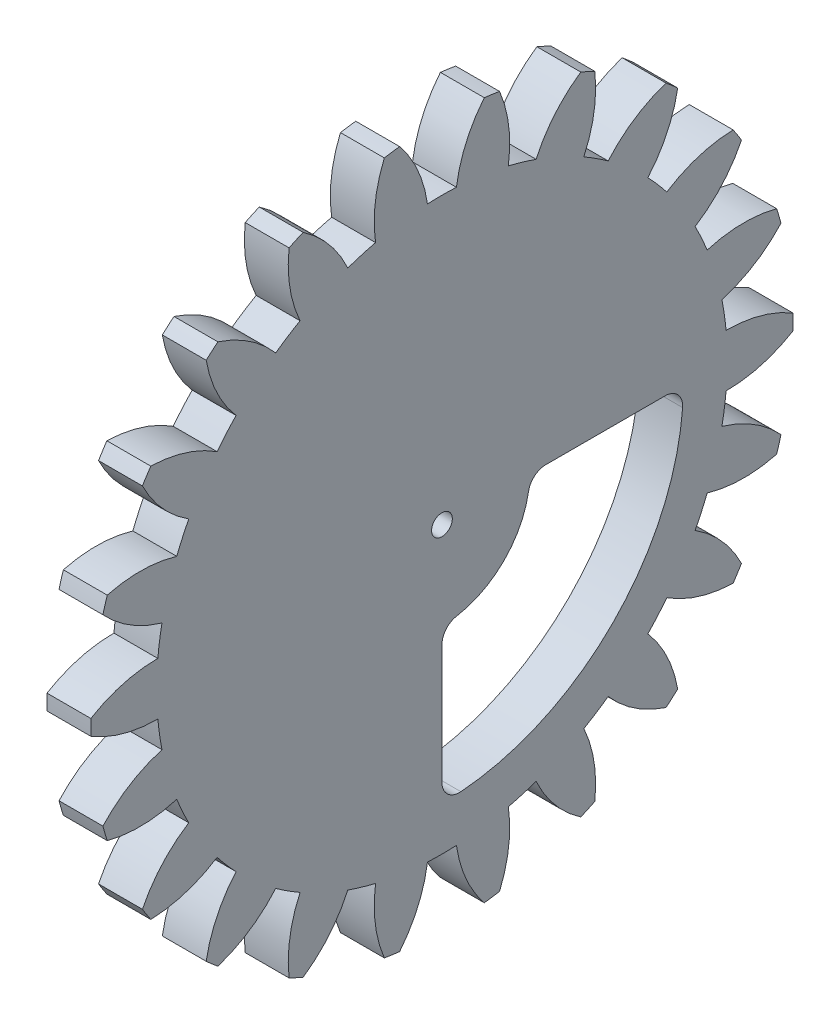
ISO-10303-21;
HEADER;
FILE_DESCRIPTION(('STEP AP214'),'2;1');
FILE_NAME('part.step','',(''),(''),'','','');
FILE_SCHEMA(('AUTOMOTIVE_DESIGN { 1 0 10303 214 1 1 1 1 }'));
ENDSEC;
DATA;
#1=APPLICATION_CONTEXT('core data for automotive mechanical design processes');
#2=APPLICATION_PROTOCOL_DEFINITION('international standard','automotive_design',2000,#1);
#3=PRODUCT_CONTEXT('',#1,'mechanical');
#4=PRODUCT('Part','Part','',(#3));
#5=PRODUCT_RELATED_PRODUCT_CATEGORY('part','',(#4));
#6=PRODUCT_DEFINITION_FORMATION('','',#4);
#7=PRODUCT_DEFINITION_CONTEXT('part definition',#1,'design');
#8=PRODUCT_DEFINITION('design','',#6,#7);
#9=PRODUCT_DEFINITION_SHAPE('','',#8);
#10=(LENGTH_UNIT() NAMED_UNIT(*) SI_UNIT(.MILLI.,.METRE.));
#11=(NAMED_UNIT(*) PLANE_ANGLE_UNIT() SI_UNIT($,.RADIAN.));
#12=(NAMED_UNIT(*) SI_UNIT($,.STERADIAN.) SOLID_ANGLE_UNIT());
#13=UNCERTAINTY_MEASURE_WITH_UNIT(LENGTH_MEASURE(1.E-05),#10,'distance_accuracy_value','');
#14=(GEOMETRIC_REPRESENTATION_CONTEXT(3) GLOBAL_UNCERTAINTY_ASSIGNED_CONTEXT((#13)) GLOBAL_UNIT_ASSIGNED_CONTEXT((#10,
#11,#12)) REPRESENTATION_CONTEXT('',''));
#15=CARTESIAN_POINT('',(0.,0.,0.));
#16=DIRECTION('',(0.,0.,1.));
#17=DIRECTION('',(1.,0.,0.));
#18=AXIS2_PLACEMENT_3D('',#15,#16,#17);
#19=CARTESIAN_POINT('',(6.35,0.,0.));
#20=DIRECTION('',(-1.,0.,0.));
#21=DIRECTION('',(0.,0.,1.));
#22=AXIS2_PLACEMENT_3D('',#19,#20,#21);
#23=PLANE('',#22);
#24=DIRECTION('',(0.,-1.,0.));
#25=VECTOR('',#24,1.);
#26=CARTESIAN_POINT('',(6.35,-12.7,0.));
#27=LINE('',#26,#25);
#28=CARTESIAN_POINT('',(6.35,-15.026842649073,0.));
#29=VERTEX_POINT('',#28);
#30=CARTESIAN_POINT('',(6.35,-32.2852384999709,0.));
#31=VERTEX_POINT('',#30);
#32=EDGE_CURVE('E1233',#29,#31,#27,.T.);
#33=ORIENTED_EDGE('',*,*,#32,.F.);
#34=CARTESIAN_POINT('',(6.35,-15.026842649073,-2.54));
#35=DIRECTION('',(-1.,0.,0.));
#36=DIRECTION('',(0.,0.,1.));
#37=AXIS2_PLACEMENT_3D('',#34,#35,#36);
#38=CIRCLE('',#37,2.54);
#39=CARTESIAN_POINT('',(6.35,-12.5223688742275,-2.11666666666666));
#40=VERTEX_POINT('',#39);
#41=EDGE_CURVE('E40',#29,#40,#38,.T.);
#42=ORIENTED_EDGE('',*,*,#41,.T.);
#43=CARTESIAN_POINT('',(6.35,0.,0.));
#44=DIRECTION('',(-1.,0.,0.));
#45=DIRECTION('',(0.,0.,-1.));
#46=AXIS2_PLACEMENT_3D('',#43,#44,#45);
#47=CIRCLE('',#46,12.7);
#48=CARTESIAN_POINT('',(6.35,-2.11666666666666,-12.5223688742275));
#49=VERTEX_POINT('',#48);
#50=EDGE_CURVE('E1231',#49,#40,#47,.T.);
#51=ORIENTED_EDGE('',*,*,#50,.F.);
#52=CARTESIAN_POINT('',(6.35,-2.54,-15.026842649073));
#53=DIRECTION('',(-1.,0.,0.));
#54=DIRECTION('',(0.,0.,1.));
#55=AXIS2_PLACEMENT_3D('',#52,#53,#54);
#56=CIRCLE('',#55,2.54);
#57=CARTESIAN_POINT('',(6.35,0.,-15.026842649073));
#58=VERTEX_POINT('',#57);
#59=EDGE_CURVE('E1226',#49,#58,#56,.T.);
#60=ORIENTED_EDGE('',*,*,#59,.T.);
#61=DIRECTION('',(0.,0.,1.));
#62=VECTOR('',#61,1.);
#63=CARTESIAN_POINT('',(6.35,0.,-12.7));
#64=LINE('',#63,#62);
#65=CARTESIAN_POINT('',(6.35,0.,-32.2852384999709));
#66=VERTEX_POINT('',#65);
#67=EDGE_CURVE('E1255',#66,#58,#64,.T.);
#68=ORIENTED_EDGE('',*,*,#67,.F.);
#69=CARTESIAN_POINT('',(6.35,-2.54,-32.2852384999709));
#70=DIRECTION('',(-1.,0.,0.));
#71=DIRECTION('',(0.,0.,1.));
#72=AXIS2_PLACEMENT_3D('',#69,#70,#71);
#73=CIRCLE('',#72,2.54);
#74=CARTESIAN_POINT('',(6.35,-2.73921568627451,-34.817414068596));
#75=VERTEX_POINT('',#74);
#76=EDGE_CURVE('E1222',#66,#75,#73,.T.);
#77=ORIENTED_EDGE('',*,*,#76,.T.);
#78=CARTESIAN_POINT('',(6.35,0.,0.));
#79=DIRECTION('',(1.,0.,0.));
#80=DIRECTION('',(0.,0.,-1.));
#81=AXIS2_PLACEMENT_3D('',#78,#79,#80);
#82=CIRCLE('',#81,34.925);
#83=CARTESIAN_POINT('',(6.35,-34.817414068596,-2.73921568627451));
#84=VERTEX_POINT('',#83);
#85=EDGE_CURVE('E1261',#84,#75,#82,.T.);
#86=ORIENTED_EDGE('',*,*,#85,.F.);
#87=CARTESIAN_POINT('',(6.35,-32.2852384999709,-2.54));
#88=DIRECTION('',(-1.,0.,0.));
#89=DIRECTION('',(0.,0.,1.));
#90=AXIS2_PLACEMENT_3D('',#87,#88,#89);
#91=CIRCLE('',#90,2.54);
#92=EDGE_CURVE('E1218',#84,#31,#91,.T.);
#93=ORIENTED_EDGE('',*,*,#92,.T.);
#94=EDGE_LOOP('',(#33,#42,#51,#60,#68,#77,#86,#93));
#95=FACE_BOUND('',#94,.T.);
#96=CARTESIAN_POINT('',(6.35,31.2860298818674,-30.5937541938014));
#97=DIRECTION('',(-1.,0.,0.));
#98=DIRECTION('',(0.,-0.281732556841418,-0.959492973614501));
#99=AXIS2_PLACEMENT_3D('',#96,#97,#98);
#100=CIRCLE('',#99,18.6266666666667);
#101=CARTESIAN_POINT('',(6.35,38.961089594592,-13.6218312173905));
#102=VERTEX_POINT('',#101);
#103=CARTESIAN_POINT('',(6.35,46.6625157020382,-20.0810763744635));
#104=VERTEX_POINT('',#103);
#105=EDGE_CURVE('E637',#102,#104,#100,.T.);
#106=ORIENTED_EDGE('',*,*,#105,.F.);
#107=CARTESIAN_POINT('',(6.35,0.,0.));
#108=DIRECTION('',(-1.,0.,0.));
#109=DIRECTION('',(0.,-0.281732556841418,-0.959492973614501));
#110=AXIS2_PLACEMENT_3D('',#107,#108,#109);
#111=CIRCLE('',#110,41.27373);
#112=CARTESIAN_POINT('',(6.35,40.1406722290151,-9.60454169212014));
#113=VERTEX_POINT('',#112);
#114=EDGE_CURVE('E636',#113,#102,#111,.T.);
#115=ORIENTED_EDGE('',*,*,#114,.F.);
#116=CARTESIAN_POINT('',(6.35,42.859715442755,8.82259902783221));
#117=DIRECTION('',(-1.,0.,0.));
#118=DIRECTION('',(0.,-0.281732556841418,-0.959492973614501));
#119=AXIS2_PLACEMENT_3D('',#116,#117,#118);
#120=CIRCLE('',#119,18.6266666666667);
#121=CARTESIAN_POINT('',(6.35,50.1116557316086,-8.33438419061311));
#122=VERTEX_POINT('',#121);
#123=EDGE_CURVE('E625',#122,#113,#120,.T.);
#124=ORIENTED_EDGE('',*,*,#123,.F.);
#125=CARTESIAN_POINT('',(6.35,0.,0.));
#126=DIRECTION('',(-1.,0.,0.));
#127=DIRECTION('',(0.,0.,1.));
#128=AXIS2_PLACEMENT_3D('',#125,#126,#127);
#129=CIRCLE('',#128,50.8);
#130=CARTESIAN_POINT('',(6.35,50.4298489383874,-6.1213018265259));
#131=VERTEX_POINT('',#130);
#132=EDGE_CURVE('E1131',#131,#122,#129,.T.);
#133=ORIENTED_EDGE('',*,*,#132,.F.);
#134=CARTESIAN_POINT('',(6.35,38.6379824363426,-20.5401989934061));
#135=DIRECTION('',(-1.,0.,0.));
#136=DIRECTION('',(0.,0.,-1.));
#137=AXIS2_PLACEMENT_3D('',#134,#135,#136);
#138=CIRCLE('',#137,18.6266666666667);
#139=CARTESIAN_POINT('',(6.35,41.2206050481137,-2.09344395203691));
#140=VERTEX_POINT('',#139);
#141=EDGE_CURVE('E1104',#140,#131,#138,.T.);
#142=ORIENTED_EDGE('',*,*,#141,.F.);
#143=CARTESIAN_POINT('',(6.35,0.,0.));
#144=DIRECTION('',(-1.,0.,0.));
#145=DIRECTION('',(0.,0.,-1.));
#146=AXIS2_PLACEMENT_3D('',#143,#144,#145);
#147=CIRCLE('',#146,41.27373);
#148=CARTESIAN_POINT('',(6.35,41.2206050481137,2.09344395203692));
#149=VERTEX_POINT('',#148);
#150=EDGE_CURVE('E1109',#149,#140,#147,.T.);
#151=ORIENTED_EDGE('',*,*,#150,.F.);
#152=CARTESIAN_POINT('',(6.35,38.6379824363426,20.5401989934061));
#153=DIRECTION('',(-1.,0.,0.));
#154=DIRECTION('',(0.,0.,-1.));
#155=AXIS2_PLACEMENT_3D('',#152,#153,#154);
#156=CIRCLE('',#155,18.6266666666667);
#157=CARTESIAN_POINT('',(6.35,50.4298489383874,6.12130182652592));
#158=VERTEX_POINT('',#157);
#159=EDGE_CURVE('E1106',#158,#149,#156,.T.);
#160=ORIENTED_EDGE('',*,*,#159,.F.);
#161=CARTESIAN_POINT('',(6.35,50.1116557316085,8.33438419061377));
#162=VERTEX_POINT('',#161);
#163=EDGE_CURVE('E1129',#162,#158,#129,.T.);
#164=ORIENTED_EDGE('',*,*,#163,.F.);
#165=CARTESIAN_POINT('',(6.35,42.8597154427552,-8.82259902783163));
#166=DIRECTION('',(-1.,0.,0.));
#167=DIRECTION('',(0.,0.28173255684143,-0.959492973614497));
#168=AXIS2_PLACEMENT_3D('',#165,#166,#167);
#169=CIRCLE('',#168,18.6266666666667);
#170=CARTESIAN_POINT('',(6.35,40.140672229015,9.60454169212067));
#171=VERTEX_POINT('',#170);
#172=EDGE_CURVE('E1082',#171,#162,#169,.T.);
#173=ORIENTED_EDGE('',*,*,#172,.F.);
#174=CARTESIAN_POINT('',(6.35,0.,0.));
#175=DIRECTION('',(-1.,0.,0.));
#176=DIRECTION('',(0.,0.28173255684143,-0.959492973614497));
#177=AXIS2_PLACEMENT_3D('',#174,#175,#176);
#178=CIRCLE('',#177,41.27373);
#179=CARTESIAN_POINT('',(6.35,38.9610895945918,13.621831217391));
#180=VERTEX_POINT('',#179);
#181=EDGE_CURVE('E1087',#180,#171,#178,.T.);
#182=ORIENTED_EDGE('',*,*,#181,.F.);
#183=CARTESIAN_POINT('',(6.35,31.286029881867,30.5937541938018));
#184=DIRECTION('',(-1.,0.,0.));
#185=DIRECTION('',(0.,0.28173255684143,-0.959492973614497));
#186=AXIS2_PLACEMENT_3D('',#183,#184,#185);
#187=CIRCLE('',#186,18.6266666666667);
#188=CARTESIAN_POINT('',(6.35,46.6625157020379,20.0810763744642));
#189=VERTEX_POINT('',#188);
#190=EDGE_CURVE('E1084',#189,#180,#187,.T.);
#191=ORIENTED_EDGE('',*,*,#190,.F.);
#192=CARTESIAN_POINT('',(6.35,45.7337142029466,22.1148679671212));
#193=VERTEX_POINT('',#192);
#194=EDGE_CURVE('E1364',#193,#189,#129,.T.);
#195=ORIENTED_EDGE('',*,*,#194,.F.);
#196=CARTESIAN_POINT('',(6.35,43.6092092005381,3.60975544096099));
#197=DIRECTION('',(-1.,0.,0.));
#198=DIRECTION('',(0.,0.540640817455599,-0.841253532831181));
#199=AXIS2_PLACEMENT_3D('',#196,#197,#198);
#200=CIRCLE('',#199,18.6266666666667);
#201=CARTESIAN_POINT('',(6.35,35.8087808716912,20.5244244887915));
#202=VERTEX_POINT('',#201);
#203=EDGE_CURVE('E1060',#202,#193,#200,.T.);
#204=ORIENTED_EDGE('',*,*,#203,.F.);
#205=CARTESIAN_POINT('',(6.35,0.,0.));
#206=DIRECTION('',(-1.,0.,0.));
#207=DIRECTION('',(0.,0.540640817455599,-0.841253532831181));
#208=AXIS2_PLACEMENT_3D('',#205,#206,#207);
#209=CIRCLE('',#208,41.27373);
#210=CARTESIAN_POINT('',(6.35,33.5451783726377,24.0466587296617));
#211=VERTEX_POINT('',#210);
#212=EDGE_CURVE('E1065',#211,#202,#209,.T.);
#213=ORIENTED_EDGE('',*,*,#212,.F.);
#214=CARTESIAN_POINT('',(6.35,21.3994692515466,38.1687853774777));
#215=DIRECTION('',(-1.,0.,0.));
#216=DIRECTION('',(0.,0.540640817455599,-0.841253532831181));
#217=AXIS2_PLACEMENT_3D('',#214,#215,#216);
#218=CIRCLE('',#217,18.6266666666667);
#219=CARTESIAN_POINT('',(6.35,39.1148629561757,32.414001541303));
#220=VERTEX_POINT('',#219);
#221=EDGE_CURVE('E1062',#220,#211,#218,.T.);
#222=ORIENTED_EDGE('',*,*,#221,.F.);
#223=CARTESIAN_POINT('',(6.35,37.650699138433,34.1037366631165));
#224=VERTEX_POINT('',#223);
#225=EDGE_CURVE('E1359',#224,#220,#129,.T.);
#226=ORIENTED_EDGE('',*,*,#225,.F.);
#227=CARTESIAN_POINT('',(6.35,40.8257441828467,15.7496689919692));
#228=DIRECTION('',(-1.,0.,0.));
#229=DIRECTION('',(0.,0.755749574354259,-0.654860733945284));
#230=AXIS2_PLACEMENT_3D('',#227,#228,#229);
#231=CIRCLE('',#230,18.6266666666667);
#232=CARTESIAN_POINT('',(6.35,28.5758750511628,29.7815404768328));
#233=VERTEX_POINT('',#232);
#234=EDGE_CURVE('E1038',#233,#224,#231,.T.);
#235=ORIENTED_EDGE('',*,*,#234,.F.);
#236=CARTESIAN_POINT('',(6.35,0.,0.));
#237=DIRECTION('',(-1.,0.,0.));
#238=DIRECTION('',(0.,0.755749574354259,-0.654860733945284));
#239=AXIS2_PLACEMENT_3D('',#236,#237,#238);
#240=CIRCLE('',#239,41.27373);
#241=CARTESIAN_POINT('',(6.35,25.41163629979,32.5233689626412));
#242=VERTEX_POINT('',#241);
#243=EDGE_CURVE('E1043',#242,#233,#240,.T.);
#244=ORIENTED_EDGE('',*,*,#243,.F.);
#245=CARTESIAN_POINT('',(6.35,9.77925089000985,42.6516085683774));
#246=DIRECTION('',(-1.,0.,0.));
#247=DIRECTION('',(0.,0.755749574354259,-0.654860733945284));
#248=AXIS2_PLACEMENT_3D('',#245,#246,#247);
#249=CIRCLE('',#248,18.6266666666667);
#250=CARTESIAN_POINT('',(6.35,28.3983566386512,42.1209370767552));
#251=VERTEX_POINT('',#250);
#252=EDGE_CURVE('E1040',#251,#242,#249,.T.);
#253=ORIENTED_EDGE('',*,*,#252,.F.);
#254=CARTESIAN_POINT('',(6.35,26.5174483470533,43.3297234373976));
#255=VERTEX_POINT('',#254);
#256=EDGE_CURVE('E1354',#255,#251,#129,.T.);
#257=ORIENTED_EDGE('',*,*,#256,.F.);
#258=CARTESIAN_POINT('',(6.35,34.7348201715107,26.6136380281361));
#259=DIRECTION('',(-1.,0.,0.));
#260=DIRECTION('',(0.,0.90963199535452,-0.415415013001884));
#261=AXIS2_PLACEMENT_3D('',#258,#259,#260);
#262=CIRCLE('',#261,18.6266666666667);
#263=CARTESIAN_POINT('',(6.35,19.0279217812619,36.6259331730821));
#264=VERTEX_POINT('',#263);
#265=EDGE_CURVE('E1016',#264,#255,#262,.T.);
#266=ORIENTED_EDGE('',*,*,#265,.F.);
#267=CARTESIAN_POINT('',(6.35,0.,0.));
#268=DIRECTION('',(-1.,0.,0.));
#269=DIRECTION('',(0.,0.90963199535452,-0.415415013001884));
#270=AXIS2_PLACEMENT_3D('',#267,#268,#269);
#271=CIRCLE('',#270,41.27373);
#272=CARTESIAN_POINT('',(6.35,15.2193945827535,38.3652292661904));
#273=VERTEX_POINT('',#272);
#274=EDGE_CURVE('E1021',#273,#264,#271,.T.);
#275=ORIENTED_EDGE('',*,*,#274,.F.);
#276=CARTESIAN_POINT('',(6.35,-2.63322421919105,43.6790520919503));
#277=DIRECTION('',(-1.,0.,0.));
#278=DIRECTION('',(0.,0.90963199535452,-0.415415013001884));
#279=AXIS2_PLACEMENT_3D('',#276,#277,#278);
#280=CIRCLE('',#279,18.6266666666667);
#281=CARTESIAN_POINT('',(6.35,15.3811843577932,48.415484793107));
#282=VERTEX_POINT('',#281);
#283=EDGE_CURVE('E1018',#282,#273,#280,.T.);
#284=ORIENTED_EDGE('',*,*,#283,.F.);
#285=CARTESIAN_POINT('',(6.35,13.2359115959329,49.0453937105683));
#286=VERTEX_POINT('',#285);
#287=EDGE_CURVE('E1349',#286,#282,#129,.T.);
#288=ORIENTED_EDGE('',*,*,#287,.F.);
#289=CARTESIAN_POINT('',(6.35,25.8298876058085,35.3215283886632));
#290=DIRECTION('',(-1.,0.,0.));
#291=DIRECTION('',(0.,0.989821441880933,-0.142314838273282));
#292=AXIS2_PLACEMENT_3D('',#289,#290,#291);
#293=CIRCLE('',#292,18.6266666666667);
#294=CARTESIAN_POINT('',(6.35,7.93843945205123,40.5031105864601));
#295=VERTEX_POINT('',#294);
#296=EDGE_CURVE('E994',#295,#286,#293,.T.);
#297=ORIENTED_EDGE('',*,*,#296,.F.);
#298=CARTESIAN_POINT('',(6.35,0.,0.));
#299=DIRECTION('',(-1.,0.,0.));
#300=DIRECTION('',(0.,0.989821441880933,-0.142314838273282));
#301=AXIS2_PLACEMENT_3D('',#298,#299,#300);
#302=CIRCLE('',#301,41.27373);
#303=CARTESIAN_POINT('',(6.35,3.79416802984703,41.0989668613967));
#304=VERTEX_POINT('',#303);
#305=EDGE_CURVE('E999',#304,#295,#302,.T.);
#306=ORIENTED_EDGE('',*,*,#305,.F.);
#307=CARTESIAN_POINT('',(6.35,-14.8323711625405,41.1678785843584));
#308=DIRECTION('',(-1.,0.,0.));
#309=DIRECTION('',(0.,0.989821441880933,-0.142314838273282));
#310=AXIS2_PLACEMENT_3D('',#307,#308,#309);
#311=CIRCLE('',#310,18.6266666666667);
#312=CARTESIAN_POINT('',(6.35,1.11791999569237,50.7876978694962));
#313=VERTEX_POINT('',#312);
#314=EDGE_CURVE('E996',#313,#304,#311,.T.);
#315=ORIENTED_EDGE('',*,*,#314,.F.);
#316=CARTESIAN_POINT('',(6.35,-1.11791999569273,50.7876978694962));
#317=VERTEX_POINT('',#316);
#318=EDGE_CURVE('E1344',#317,#313,#129,.T.);
#319=ORIENTED_EDGE('',*,*,#318,.F.);
#320=CARTESIAN_POINT('',(6.35,14.8323711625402,41.1678785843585));
#321=DIRECTION('',(-1.,0.,0.));
#322=DIRECTION('',(0.,0.989821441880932,0.142314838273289));
#323=AXIS2_PLACEMENT_3D('',#320,#321,#322);
#324=CIRCLE('',#323,18.6266666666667);
#325=CARTESIAN_POINT('',(6.35,-3.79416802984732,41.0989668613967));
#326=VERTEX_POINT('',#325);
#327=EDGE_CURVE('E972',#326,#317,#324,.T.);
#328=ORIENTED_EDGE('',*,*,#327,.F.);
#329=CARTESIAN_POINT('',(6.35,0.,0.));
#330=DIRECTION('',(-1.,0.,0.));
#331=DIRECTION('',(0.,0.989821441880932,0.142314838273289));
#332=AXIS2_PLACEMENT_3D('',#329,#330,#331);
#333=CIRCLE('',#332,41.27373);
#334=CARTESIAN_POINT('',(6.35,-7.93843945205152,40.50311058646));
#335=VERTEX_POINT('',#334);
#336=EDGE_CURVE('E977',#335,#326,#333,.T.);
#337=ORIENTED_EDGE('',*,*,#336,.F.);
#338=CARTESIAN_POINT('',(6.35,-25.8298876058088,35.321528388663));
#339=DIRECTION('',(-1.,0.,0.));
#340=DIRECTION('',(0.,0.989821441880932,0.142314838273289));
#341=AXIS2_PLACEMENT_3D('',#338,#339,#340);
#342=CIRCLE('',#341,18.6266666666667);
#343=CARTESIAN_POINT('',(6.35,-13.2359115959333,49.0453937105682));
#344=VERTEX_POINT('',#343);
#345=EDGE_CURVE('E974',#344,#335,#342,.T.);
#346=ORIENTED_EDGE('',*,*,#345,.F.);
#347=CARTESIAN_POINT('',(6.35,-15.3811843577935,48.4154847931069));
#348=VERTEX_POINT('',#347);
#349=EDGE_CURVE('E1339',#348,#344,#129,.T.);
#350=ORIENTED_EDGE('',*,*,#349,.F.);
#351=CARTESIAN_POINT('',(6.35,2.63322421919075,43.6790520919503));
#352=DIRECTION('',(-1.,0.,0.));
#353=DIRECTION('',(0.,0.909631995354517,0.41541501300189));
#354=AXIS2_PLACEMENT_3D('',#351,#352,#353);
#355=CIRCLE('',#354,18.6266666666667);
#356=CARTESIAN_POINT('',(6.35,-15.2193945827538,38.3652292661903));
#357=VERTEX_POINT('',#356);
#358=EDGE_CURVE('E950',#357,#348,#355,.T.);
#359=ORIENTED_EDGE('',*,*,#358,.F.);
#360=CARTESIAN_POINT('',(6.35,0.,0.));
#361=DIRECTION('',(-1.,0.,0.));
#362=DIRECTION('',(0.,0.909631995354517,0.41541501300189));
#363=AXIS2_PLACEMENT_3D('',#360,#361,#362);
#364=CIRCLE('',#363,41.27373);
#365=CARTESIAN_POINT('',(6.35,-19.0279217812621,36.625933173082));
#366=VERTEX_POINT('',#365);
#367=EDGE_CURVE('E955',#366,#357,#364,.T.);
#368=ORIENTED_EDGE('',*,*,#367,.F.);
#369=CARTESIAN_POINT('',(6.35,-34.7348201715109,26.6136380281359));
#370=DIRECTION('',(-1.,0.,0.));
#371=DIRECTION('',(0.,0.909631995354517,0.41541501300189));
#372=AXIS2_PLACEMENT_3D('',#369,#370,#371);
#373=CIRCLE('',#372,18.6266666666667);
#374=CARTESIAN_POINT('',(6.35,-26.5174483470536,43.3297234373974));
#375=VERTEX_POINT('',#374);
#376=EDGE_CURVE('E952',#375,#366,#373,.T.);
#377=ORIENTED_EDGE('',*,*,#376,.F.);
#378=CARTESIAN_POINT('',(6.35,-28.3983566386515,42.120937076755));
#379=VERTEX_POINT('',#378);
#380=EDGE_CURVE('E1334',#379,#375,#129,.T.);
#381=ORIENTED_EDGE('',*,*,#380,.F.);
#382=CARTESIAN_POINT('',(6.35,-9.77925089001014,42.6516085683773));
#383=DIRECTION('',(-1.,0.,0.));
#384=DIRECTION('',(0.,0.755749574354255,0.654860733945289));
#385=AXIS2_PLACEMENT_3D('',#382,#383,#384);
#386=CIRCLE('',#385,18.6266666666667);
#387=CARTESIAN_POINT('',(6.35,-25.4116362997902,32.523368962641));
#388=VERTEX_POINT('',#387);
#389=EDGE_CURVE('E928',#388,#379,#386,.T.);
#390=ORIENTED_EDGE('',*,*,#389,.F.);
#391=CARTESIAN_POINT('',(6.35,0.,0.));
#392=DIRECTION('',(-1.,0.,0.));
#393=DIRECTION('',(0.,0.755749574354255,0.654860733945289));
#394=AXIS2_PLACEMENT_3D('',#391,#392,#393);
#395=CIRCLE('',#394,41.27373);
#396=CARTESIAN_POINT('',(6.35,-28.575875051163,29.7815404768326));
#397=VERTEX_POINT('',#396);
#398=EDGE_CURVE('E933',#397,#388,#395,.T.);
#399=ORIENTED_EDGE('',*,*,#398,.F.);
#400=CARTESIAN_POINT('',(6.35,-40.8257441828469,15.7496689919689));
#401=DIRECTION('',(-1.,0.,0.));
#402=DIRECTION('',(0.,0.755749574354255,0.654860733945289));
#403=AXIS2_PLACEMENT_3D('',#400,#401,#402);
#404=CIRCLE('',#403,18.6266666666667);
#405=CARTESIAN_POINT('',(6.35,-37.6506991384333,34.1037366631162));
#406=VERTEX_POINT('',#405);
#407=EDGE_CURVE('E930',#406,#397,#404,.T.);
#408=ORIENTED_EDGE('',*,*,#407,.F.);
#409=CARTESIAN_POINT('',(6.35,-39.1148629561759,32.4140015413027));
#410=VERTEX_POINT('',#409);
#411=EDGE_CURVE('E1329',#410,#406,#129,.T.);
#412=ORIENTED_EDGE('',*,*,#411,.F.);
#413=CARTESIAN_POINT('',(6.35,-21.3994692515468,38.1687853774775));
#414=DIRECTION('',(-1.,0.,0.));
#415=DIRECTION('',(0.,0.540640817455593,0.841253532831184));
#416=AXIS2_PLACEMENT_3D('',#413,#414,#415);
#417=CIRCLE('',#416,18.6266666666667);
#418=CARTESIAN_POINT('',(6.35,-33.5451783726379,24.0466587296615));
#419=VERTEX_POINT('',#418);
#420=EDGE_CURVE('E906',#419,#410,#417,.T.);
#421=ORIENTED_EDGE('',*,*,#420,.F.);
#422=CARTESIAN_POINT('',(6.35,0.,0.));
#423=DIRECTION('',(-1.,0.,0.));
#424=DIRECTION('',(0.,0.540640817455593,0.841253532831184));
#425=AXIS2_PLACEMENT_3D('',#422,#423,#424);
#426=CIRCLE('',#425,41.27373);
#427=CARTESIAN_POINT('',(6.35,-35.8087808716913,20.5244244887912));
#428=VERTEX_POINT('',#427);
#429=EDGE_CURVE('E911',#428,#419,#426,.T.);
#430=ORIENTED_EDGE('',*,*,#429,.F.);
#431=CARTESIAN_POINT('',(6.35,-43.6092092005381,3.60975544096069));
#432=DIRECTION('',(-1.,0.,0.));
#433=DIRECTION('',(0.,0.540640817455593,0.841253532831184));
#434=AXIS2_PLACEMENT_3D('',#431,#432,#433);
#435=CIRCLE('',#434,18.6266666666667);
#436=CARTESIAN_POINT('',(6.35,-45.7337142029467,22.1148679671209));
#437=VERTEX_POINT('',#436);
#438=EDGE_CURVE('E908',#437,#428,#435,.T.);
#439=ORIENTED_EDGE('',*,*,#438,.F.);
#440=CARTESIAN_POINT('',(6.35,-46.6625157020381,20.0810763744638));
#441=VERTEX_POINT('',#440);
#442=EDGE_CURVE('E1324',#441,#437,#129,.T.);
#443=ORIENTED_EDGE('',*,*,#442,.F.);
#444=CARTESIAN_POINT('',(6.35,-31.2860298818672,30.5937541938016));
#445=DIRECTION('',(-1.,0.,0.));
#446=DIRECTION('',(0.,0.281732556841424,0.959492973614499));
#447=AXIS2_PLACEMENT_3D('',#444,#445,#446);
#448=CIRCLE('',#447,18.6266666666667);
#449=CARTESIAN_POINT('',(6.35,-38.9610895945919,13.6218312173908));
#450=VERTEX_POINT('',#449);
#451=EDGE_CURVE('E884',#450,#441,#448,.T.);
#452=ORIENTED_EDGE('',*,*,#451,.F.);
#453=CARTESIAN_POINT('',(6.35,0.,0.));
#454=DIRECTION('',(-1.,0.,0.));
#455=DIRECTION('',(0.,0.281732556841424,0.959492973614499));
#456=AXIS2_PLACEMENT_3D('',#453,#454,#455);
#457=CIRCLE('',#456,41.27373);
#458=CARTESIAN_POINT('',(6.35,-40.1406722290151,9.60454169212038));
#459=VERTEX_POINT('',#458);
#460=EDGE_CURVE('E889',#459,#450,#457,.T.);
#461=ORIENTED_EDGE('',*,*,#460,.F.);
#462=CARTESIAN_POINT('',(6.35,-42.8597154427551,-8.82259902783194));
#463=DIRECTION('',(-1.,0.,0.));
#464=DIRECTION('',(0.,0.281732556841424,0.959492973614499));
#465=AXIS2_PLACEMENT_3D('',#462,#463,#464);
#466=CIRCLE('',#465,18.6266666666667);
#467=CARTESIAN_POINT('',(6.35,-50.1116557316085,8.33438419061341));
#468=VERTEX_POINT('',#467);
#469=EDGE_CURVE('E886',#468,#459,#466,.T.);
#470=ORIENTED_EDGE('',*,*,#469,.F.);
#471=CARTESIAN_POINT('',(6.35,-50.4298489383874,6.12130182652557));
#472=VERTEX_POINT('',#471);
#473=EDGE_CURVE('E1319',#472,#468,#129,.T.);
#474=ORIENTED_EDGE('',*,*,#473,.F.);
#475=CARTESIAN_POINT('',(6.35,-38.6379824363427,20.5401989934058));
#476=DIRECTION('',(-1.,0.,0.));
#477=DIRECTION('',(0.,0.,1.));
#478=AXIS2_PLACEMENT_3D('',#475,#476,#477);
#479=CIRCLE('',#478,18.6266666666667);
#480=CARTESIAN_POINT('',(6.35,-41.2206050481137,2.09344395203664));
#481=VERTEX_POINT('',#480);
#482=EDGE_CURVE('E862',#481,#472,#479,.T.);
#483=ORIENTED_EDGE('',*,*,#482,.F.);
#484=CARTESIAN_POINT('',(6.35,0.,0.));
#485=DIRECTION('',(-1.,0.,0.));
#486=DIRECTION('',(0.,0.,1.));
#487=AXIS2_PLACEMENT_3D('',#484,#485,#486);
#488=CIRCLE('',#487,41.27373);
#489=CARTESIAN_POINT('',(6.35,-41.2206050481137,-2.09344395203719));
#490=VERTEX_POINT('',#489);
#491=EDGE_CURVE('E867',#490,#481,#488,.T.);
#492=ORIENTED_EDGE('',*,*,#491,.F.);
#493=CARTESIAN_POINT('',(6.35,-38.6379824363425,-20.5401989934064));
#494=DIRECTION('',(-1.,0.,0.));
#495=DIRECTION('',(0.,0.,1.));
#496=AXIS2_PLACEMENT_3D('',#493,#494,#495);
#497=CIRCLE('',#496,18.6266666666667);
#498=CARTESIAN_POINT('',(6.35,-50.4298489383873,-6.12130182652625));
#499=VERTEX_POINT('',#498);
#500=EDGE_CURVE('E864',#499,#490,#497,.T.);
#501=ORIENTED_EDGE('',*,*,#500,.F.);
#502=CARTESIAN_POINT('',(6.35,-50.1116557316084,-8.33438419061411));
#503=VERTEX_POINT('',#502);
#504=EDGE_CURVE('E1314',#503,#499,#129,.T.);
#505=ORIENTED_EDGE('',*,*,#504,.F.);
#506=CARTESIAN_POINT('',(6.35,-42.8597154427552,8.82259902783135));
#507=DIRECTION('',(-1.,0.,0.));
#508=DIRECTION('',(0.,-0.281732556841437,0.959492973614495));
#509=AXIS2_PLACEMENT_3D('',#506,#507,#508);
#510=CIRCLE('',#509,18.6266666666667);
#511=CARTESIAN_POINT('',(6.35,-40.1406722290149,-9.60454169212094));
#512=VERTEX_POINT('',#511);
#513=EDGE_CURVE('E840',#512,#503,#510,.T.);
#514=ORIENTED_EDGE('',*,*,#513,.F.);
#515=CARTESIAN_POINT('',(6.35,0.,0.));
#516=DIRECTION('',(-1.,0.,0.));
#517=DIRECTION('',(0.,-0.281732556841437,0.959492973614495));
#518=AXIS2_PLACEMENT_3D('',#515,#516,#517);
#519=CIRCLE('',#518,41.27373);
#520=CARTESIAN_POINT('',(6.35,-38.9610895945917,-13.6218312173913));
#521=VERTEX_POINT('',#520);
#522=EDGE_CURVE('E845',#521,#512,#519,.T.);
#523=ORIENTED_EDGE('',*,*,#522,.F.);
#524=CARTESIAN_POINT('',(6.35,-31.2860298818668,-30.593754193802));
#525=DIRECTION('',(-1.,0.,0.));
#526=DIRECTION('',(0.,-0.281732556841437,0.959492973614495));
#527=AXIS2_PLACEMENT_3D('',#524,#525,#526);
#528=CIRCLE('',#527,18.6266666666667);
#529=CARTESIAN_POINT('',(6.35,-46.6625157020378,-20.0810763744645));
#530=VERTEX_POINT('',#529);
#531=EDGE_CURVE('E842',#530,#521,#528,.T.);
#532=ORIENTED_EDGE('',*,*,#531,.F.);
#533=CARTESIAN_POINT('',(6.35,-45.7337142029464,-22.1148679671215));
#534=VERTEX_POINT('',#533);
#535=EDGE_CURVE('E1309',#534,#530,#129,.T.);
#536=ORIENTED_EDGE('',*,*,#535,.F.);
#537=CARTESIAN_POINT('',(6.35,-43.609209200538,-3.60975544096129));
#538=DIRECTION('',(-1.,0.,0.));
#539=DIRECTION('',(0.,-0.540640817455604,0.841253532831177));
#540=AXIS2_PLACEMENT_3D('',#537,#538,#539);
#541=CIRCLE('',#540,18.6266666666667);
#542=CARTESIAN_POINT('',(6.35,-35.808780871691,-20.5244244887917));
#543=VERTEX_POINT('',#542);
#544=EDGE_CURVE('E818',#543,#534,#541,.T.);
#545=ORIENTED_EDGE('',*,*,#544,.F.);
#546=CARTESIAN_POINT('',(6.35,0.,0.));
#547=DIRECTION('',(-1.,0.,0.));
#548=DIRECTION('',(0.,-0.540640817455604,0.841253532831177));
#549=AXIS2_PLACEMENT_3D('',#546,#547,#548);
#550=CIRCLE('',#549,41.27373);
#551=CARTESIAN_POINT('',(6.35,-33.5451783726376,-24.0466587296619));
#552=VERTEX_POINT('',#551);
#553=EDGE_CURVE('E823',#552,#543,#550,.T.);
#554=ORIENTED_EDGE('',*,*,#553,.F.);
#555=CARTESIAN_POINT('',(6.35,-21.3994692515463,-38.1687853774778));
#556=DIRECTION('',(-1.,0.,0.));
#557=DIRECTION('',(0.,-0.540640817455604,0.841253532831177));
#558=AXIS2_PLACEMENT_3D('',#555,#556,#557);
#559=CIRCLE('',#558,18.6266666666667);
#560=CARTESIAN_POINT('',(6.35,-39.1148629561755,-32.4140015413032));
#561=VERTEX_POINT('',#560);
#562=EDGE_CURVE('E820',#561,#552,#559,.T.);
#563=ORIENTED_EDGE('',*,*,#562,.F.);
#564=CARTESIAN_POINT('',(6.35,-37.6506991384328,-34.1037366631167));
#565=VERTEX_POINT('',#564);
#566=EDGE_CURVE('E1304',#565,#561,#129,.T.);
#567=ORIENTED_EDGE('',*,*,#566,.F.);
#568=CARTESIAN_POINT('',(6.35,-40.8257441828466,-15.7496689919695));
#569=DIRECTION('',(-1.,0.,0.));
#570=DIRECTION('',(0.,-0.755749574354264,0.654860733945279));
#571=AXIS2_PLACEMENT_3D('',#568,#569,#570);
#572=CIRCLE('',#571,18.6266666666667);
#573=CARTESIAN_POINT('',(6.35,-28.5758750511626,-29.781540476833));
#574=VERTEX_POINT('',#573);
#575=EDGE_CURVE('E796',#574,#565,#572,.T.);
#576=ORIENTED_EDGE('',*,*,#575,.F.);
#577=CARTESIAN_POINT('',(6.35,0.,0.));
#578=DIRECTION('',(-1.,0.,0.));
#579=DIRECTION('',(0.,-0.755749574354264,0.654860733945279));
#580=AXIS2_PLACEMENT_3D('',#577,#578,#579);
#581=CIRCLE('',#580,41.27373);
#582=CARTESIAN_POINT('',(6.35,-25.4116362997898,-32.5233689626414));
#583=VERTEX_POINT('',#582);
#584=EDGE_CURVE('E801',#583,#574,#581,.T.);
#585=ORIENTED_EDGE('',*,*,#584,.F.);
#586=CARTESIAN_POINT('',(6.35,-9.77925089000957,-42.6516085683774));
#587=DIRECTION('',(-1.,0.,0.));
#588=DIRECTION('',(0.,-0.755749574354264,0.654860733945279));
#589=AXIS2_PLACEMENT_3D('',#586,#587,#588);
#590=CIRCLE('',#589,18.6266666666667);
#591=CARTESIAN_POINT('',(6.35,-28.3983566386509,-42.1209370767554));
#592=VERTEX_POINT('',#591);
#593=EDGE_CURVE('E798',#592,#583,#590,.T.);
#594=ORIENTED_EDGE('',*,*,#593,.F.);
#595=CARTESIAN_POINT('',(6.35,-26.517448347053,-43.3297234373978));
#596=VERTEX_POINT('',#595);
#597=EDGE_CURVE('E1299',#596,#592,#129,.T.);
#598=ORIENTED_EDGE('',*,*,#597,.F.);
#599=CARTESIAN_POINT('',(6.35,-34.7348201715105,-26.6136380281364));
#600=DIRECTION('',(-1.,0.,0.));
#601=DIRECTION('',(0.,-0.909631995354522,0.415415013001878));
#602=AXIS2_PLACEMENT_3D('',#599,#600,#601);
#603=CIRCLE('',#602,18.6266666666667);
#604=CARTESIAN_POINT('',(6.35,-19.0279217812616,-36.6259331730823));
#605=VERTEX_POINT('',#604);
#606=EDGE_CURVE('E774',#605,#596,#603,.T.);
#607=ORIENTED_EDGE('',*,*,#606,.F.);
#608=CARTESIAN_POINT('',(6.35,0.,0.));
#609=DIRECTION('',(-1.,0.,0.));
#610=DIRECTION('',(0.,-0.909631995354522,0.415415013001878));
#611=AXIS2_PLACEMENT_3D('',#608,#609,#610);
#612=CIRCLE('',#611,41.27373);
#613=CARTESIAN_POINT('',(6.35,-15.2193945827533,-38.3652292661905));
#614=VERTEX_POINT('',#613);
#615=EDGE_CURVE('E779',#614,#605,#612,.T.);
#616=ORIENTED_EDGE('',*,*,#615,.F.);
#617=CARTESIAN_POINT('',(6.35,2.63322421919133,-43.6790520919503));
#618=DIRECTION('',(-1.,0.,0.));
#619=DIRECTION('',(0.,-0.909631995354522,0.415415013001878));
#620=AXIS2_PLACEMENT_3D('',#617,#618,#619);
#621=CIRCLE('',#620,18.6266666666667);
#622=CARTESIAN_POINT('',(6.35,-15.3811843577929,-48.4154847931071));
#623=VERTEX_POINT('',#622);
#624=EDGE_CURVE('E776',#623,#614,#621,.T.);
#625=ORIENTED_EDGE('',*,*,#624,.F.);
#626=CARTESIAN_POINT('',(6.35,-13.2359115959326,-49.0453937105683));
#627=VERTEX_POINT('',#626);
#628=EDGE_CURVE('E1294',#627,#623,#129,.T.);
#629=ORIENTED_EDGE('',*,*,#628,.F.);
#630=CARTESIAN_POINT('',(6.35,-25.8298876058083,-35.3215283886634));
#631=DIRECTION('',(-1.,0.,0.));
#632=DIRECTION('',(0.,-0.989821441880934,0.142314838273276));
#633=AXIS2_PLACEMENT_3D('',#630,#631,#632);
#634=CIRCLE('',#633,18.6266666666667);
#635=CARTESIAN_POINT('',(6.35,-7.93843945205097,-40.5031105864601));
#636=VERTEX_POINT('',#635);
#637=EDGE_CURVE('E752',#636,#627,#634,.T.);
#638=ORIENTED_EDGE('',*,*,#637,.F.);
#639=CARTESIAN_POINT('',(6.35,0.,0.));
#640=DIRECTION('',(-1.,0.,0.));
#641=DIRECTION('',(0.,-0.989821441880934,0.142314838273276));
#642=AXIS2_PLACEMENT_3D('',#639,#640,#641);
#643=CIRCLE('',#642,41.27373);
#644=CARTESIAN_POINT('',(6.35,-3.79416802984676,-41.0989668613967));
#645=VERTEX_POINT('',#644);
#646=EDGE_CURVE('E757',#645,#636,#643,.T.);
#647=ORIENTED_EDGE('',*,*,#646,.F.);
#648=CARTESIAN_POINT('',(6.35,14.8323711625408,-41.1678785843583));
#649=DIRECTION('',(-1.,0.,0.));
#650=DIRECTION('',(0.,-0.989821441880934,0.142314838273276));
#651=AXIS2_PLACEMENT_3D('',#648,#649,#650);
#652=CIRCLE('',#651,18.6266666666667);
#653=CARTESIAN_POINT('',(6.35,-1.11791999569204,-50.7876978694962));
#654=VERTEX_POINT('',#653);
#655=EDGE_CURVE('E754',#654,#645,#652,.T.);
#656=ORIENTED_EDGE('',*,*,#655,.F.);
#657=CARTESIAN_POINT('',(6.35,1.11791999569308,-50.7876978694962));
#658=VERTEX_POINT('',#657);
#659=EDGE_CURVE('E1289',#658,#654,#129,.T.);
#660=ORIENTED_EDGE('',*,*,#659,.F.);
#661=CARTESIAN_POINT('',(6.35,-14.8323711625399,-41.1678785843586));
#662=DIRECTION('',(-1.,0.,0.));
#663=DIRECTION('',(0.,-0.989821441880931,-0.142314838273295));
#664=AXIS2_PLACEMENT_3D('',#661,#662,#663);
#665=CIRCLE('',#664,18.6266666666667);
#666=CARTESIAN_POINT('',(6.35,3.7941680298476,-41.0989668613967));
#667=VERTEX_POINT('',#666);
#668=EDGE_CURVE('E730',#667,#658,#665,.T.);
#669=ORIENTED_EDGE('',*,*,#668,.F.);
#670=CARTESIAN_POINT('',(6.35,0.,0.));
#671=DIRECTION('',(-1.,0.,0.));
#672=DIRECTION('',(0.,-0.989821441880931,-0.142314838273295));
#673=AXIS2_PLACEMENT_3D('',#670,#671,#672);
#674=CIRCLE('',#673,41.27373);
#675=CARTESIAN_POINT('',(6.35,7.93843945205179,-40.50311058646));
#676=VERTEX_POINT('',#675);
#677=EDGE_CURVE('E735',#676,#667,#674,.T.);
#678=ORIENTED_EDGE('',*,*,#677,.F.);
#679=CARTESIAN_POINT('',(6.35,25.829887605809,-35.3215283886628));
#680=DIRECTION('',(-1.,0.,0.));
#681=DIRECTION('',(0.,-0.989821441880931,-0.142314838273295));
#682=AXIS2_PLACEMENT_3D('',#679,#680,#681);
#683=CIRCLE('',#682,18.6266666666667);
#684=CARTESIAN_POINT('',(6.35,13.2359115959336,-49.0453937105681));
#685=VERTEX_POINT('',#684);
#686=EDGE_CURVE('E732',#685,#676,#683,.T.);
#687=ORIENTED_EDGE('',*,*,#686,.F.);
#688=CARTESIAN_POINT('',(6.35,15.3811843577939,-48.4154847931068));
#689=VERTEX_POINT('',#688);
#690=EDGE_CURVE('E1284',#689,#685,#129,.T.);
#691=ORIENTED_EDGE('',*,*,#690,.F.);
#692=CARTESIAN_POINT('',(6.35,-2.63322421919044,-43.6790520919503));
#693=DIRECTION('',(-1.,0.,0.));
#694=DIRECTION('',(0.,-0.909631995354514,-0.415415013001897));
#695=AXIS2_PLACEMENT_3D('',#692,#693,#694);
#696=CIRCLE('',#695,18.6266666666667);
#697=CARTESIAN_POINT('',(6.35,15.219394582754,-38.3652292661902));
#698=VERTEX_POINT('',#697);
#699=EDGE_CURVE('E708',#698,#689,#696,.T.);
#700=ORIENTED_EDGE('',*,*,#699,.F.);
#701=CARTESIAN_POINT('',(6.35,0.,0.));
#702=DIRECTION('',(-1.,0.,0.));
#703=DIRECTION('',(0.,-0.909631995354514,-0.415415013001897));
#704=AXIS2_PLACEMENT_3D('',#701,#702,#703);
#705=CIRCLE('',#704,41.27373);
#706=CARTESIAN_POINT('',(6.35,19.0279217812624,-36.6259331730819));
#707=VERTEX_POINT('',#706);
#708=EDGE_CURVE('E713',#707,#698,#705,.T.);
#709=ORIENTED_EDGE('',*,*,#708,.F.);
#710=CARTESIAN_POINT('',(6.35,34.7348201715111,-26.6136380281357));
#711=DIRECTION('',(-1.,0.,0.));
#712=DIRECTION('',(0.,-0.909631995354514,-0.415415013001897));
#713=AXIS2_PLACEMENT_3D('',#710,#711,#712);
#714=CIRCLE('',#713,18.6266666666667);
#715=CARTESIAN_POINT('',(6.35,26.5174483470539,-43.3297234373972));
#716=VERTEX_POINT('',#715);
#717=EDGE_CURVE('E710',#716,#707,#714,.T.);
#718=ORIENTED_EDGE('',*,*,#717,.F.);
#719=CARTESIAN_POINT('',(6.35,28.3983566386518,-42.1209370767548));
#720=VERTEX_POINT('',#719);
#721=EDGE_CURVE('E1279',#720,#716,#129,.T.);
#722=ORIENTED_EDGE('',*,*,#721,.F.);
#723=CARTESIAN_POINT('',(6.35,9.77925089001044,-42.6516085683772));
#724=DIRECTION('',(-1.,0.,0.));
#725=DIRECTION('',(0.,-0.755749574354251,-0.654860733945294));
#726=AXIS2_PLACEMENT_3D('',#723,#724,#725);
#727=CIRCLE('',#726,18.6266666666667);
#728=CARTESIAN_POINT('',(6.35,25.4116362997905,-32.5233689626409));
#729=VERTEX_POINT('',#728);
#730=EDGE_CURVE('E686',#729,#720,#727,.T.);
#731=ORIENTED_EDGE('',*,*,#730,.F.);
#732=CARTESIAN_POINT('',(6.35,0.,0.));
#733=DIRECTION('',(-1.,0.,0.));
#734=DIRECTION('',(0.,-0.755749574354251,-0.654860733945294));
#735=AXIS2_PLACEMENT_3D('',#732,#733,#734);
#736=CIRCLE('',#735,41.27373);
#737=CARTESIAN_POINT('',(6.35,28.5758750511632,-29.7815404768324));
#738=VERTEX_POINT('',#737);
#739=EDGE_CURVE('E691',#738,#729,#736,.T.);
#740=ORIENTED_EDGE('',*,*,#739,.F.);
#741=CARTESIAN_POINT('',(6.35,40.825744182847,-15.7496689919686));
#742=DIRECTION('',(-1.,0.,0.));
#743=DIRECTION('',(0.,-0.755749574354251,-0.654860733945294));
#744=AXIS2_PLACEMENT_3D('',#741,#742,#743);
#745=CIRCLE('',#744,18.6266666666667);
#746=CARTESIAN_POINT('',(6.35,37.6506991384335,-34.103736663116));
#747=VERTEX_POINT('',#746);
#748=EDGE_CURVE('E688',#747,#738,#745,.T.);
#749=ORIENTED_EDGE('',*,*,#748,.F.);
#750=CARTESIAN_POINT('',(6.35,39.1148629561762,-32.4140015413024));
#751=VERTEX_POINT('',#750);
#752=EDGE_CURVE('E1278',#751,#747,#129,.T.);
#753=ORIENTED_EDGE('',*,*,#752,.F.);
#754=CARTESIAN_POINT('',(6.35,21.3994692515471,-38.1687853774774));
#755=DIRECTION('',(-1.,0.,0.));
#756=DIRECTION('',(0.,-0.540640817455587,-0.841253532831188));
#757=AXIS2_PLACEMENT_3D('',#754,#755,#756);
#758=CIRCLE('',#757,18.6266666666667);
#759=CARTESIAN_POINT('',(6.35,33.5451783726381,-24.0466587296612));
#760=VERTEX_POINT('',#759);
#761=EDGE_CURVE('E664',#760,#751,#758,.T.);
#762=ORIENTED_EDGE('',*,*,#761,.F.);
#763=CARTESIAN_POINT('',(6.35,0.,0.));
#764=DIRECTION('',(-1.,0.,0.));
#765=DIRECTION('',(0.,-0.540640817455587,-0.841253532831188));
#766=AXIS2_PLACEMENT_3D('',#763,#764,#765);
#767=CIRCLE('',#766,41.27373);
#768=CARTESIAN_POINT('',(6.35,35.8087808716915,-20.524424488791));
#769=VERTEX_POINT('',#768);
#770=EDGE_CURVE('E669',#769,#760,#767,.T.);
#771=ORIENTED_EDGE('',*,*,#770,.F.);
#772=CARTESIAN_POINT('',(6.35,43.6092092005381,-3.60975544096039));
#773=DIRECTION('',(-1.,0.,0.));
#774=DIRECTION('',(0.,-0.540640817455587,-0.841253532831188));
#775=AXIS2_PLACEMENT_3D('',#772,#773,#774);
#776=CIRCLE('',#775,18.6266666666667);
#777=CARTESIAN_POINT('',(6.35,45.7337142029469,-22.1148679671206));
#778=VERTEX_POINT('',#777);
#779=EDGE_CURVE('E666',#778,#769,#776,.T.);
#780=ORIENTED_EDGE('',*,*,#779,.F.);
#781=EDGE_CURVE('E1134',#104,#778,#129,.T.);
#782=ORIENTED_EDGE('',*,*,#781,.F.);
#783=EDGE_LOOP('',(#106,#115,#124,#133,#142,#151,#160,#164,#173,#182,#191,#195,#204,#213,#222,
#226,#235,#244,#253,#257,#266,#275,#284,#288,#297,#306,#315,#319,#328,#337,#346,#350,#359,#368,
#377,#381,#390,#399,#408,#412,#421,#430,#439,#443,#452,#461,#470,#474,#483,#492,#501,#505,#514,
#523,#532,#536,#545,#554,#563,#567,#576,#585,#594,#598,#607,#616,#625,#629,#638,#647,#656,#660,
#669,#678,#687,#691,#700,#709,#718,#722,#731,#740,#749,#753,#762,#771,#780,#782));
#784=FACE_BOUND('',#783,.T.);
#785=CARTESIAN_POINT('',(6.35,0.,0.));
#786=DIRECTION('',(1.,0.,0.));
#787=DIRECTION('',(0.,0.,-1.));
#788=AXIS2_PLACEMENT_3D('',#785,#786,#787);
#789=CIRCLE('',#788,1.5);
#790=CARTESIAN_POINT('',(6.35,0.,-1.5));
#791=VERTEX_POINT('',#790);
#792=EDGE_CURVE('E1258',#791,#791,#789,.T.);
#793=ORIENTED_EDGE('',*,*,#792,.F.);
#794=EDGE_LOOP('',(#793));
#795=FACE_BOUND('',#794,.T.);
#796=ADVANCED_FACE('F32',(#95,#784,#795),#23,.F.);
#797=CARTESIAN_POINT('',(0.,0.,0.));
#798=DIRECTION('',(1.,0.,0.));
#799=DIRECTION('',(0.,0.,-1.));
#800=AXIS2_PLACEMENT_3D('',#797,#798,#799);
#801=PLANE('',#800);
#802=CARTESIAN_POINT('',(0.,0.,0.));
#803=DIRECTION('',(1.,0.,0.));
#804=DIRECTION('',(0.,0.,-1.));
#805=AXIS2_PLACEMENT_3D('',#802,#803,#804);
#806=CIRCLE('',#805,34.925);
#807=CARTESIAN_POINT('',(0.,-34.817414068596,-2.73921568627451));
#808=VERTEX_POINT('',#807);
#809=CARTESIAN_POINT('',(0.,-2.73921568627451,-34.817414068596));
#810=VERTEX_POINT('',#809);
#811=EDGE_CURVE('E1251',#808,#810,#806,.T.);
#812=ORIENTED_EDGE('',*,*,#811,.T.);
#813=CARTESIAN_POINT('',(0.,-2.54,-32.2852384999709));
#814=DIRECTION('',(1.,0.,0.));
#815=DIRECTION('',(0.,0.,-1.));
#816=AXIS2_PLACEMENT_3D('',#813,#814,#815);
#817=CIRCLE('',#816,2.54);
#818=CARTESIAN_POINT('',(0.,0.,-32.2852384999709));
#819=VERTEX_POINT('',#818);
#820=EDGE_CURVE('E1224',#810,#819,#817,.T.);
#821=ORIENTED_EDGE('',*,*,#820,.T.);
#822=DIRECTION('',(0.,0.,1.));
#823=VECTOR('',#822,1.);
#824=CARTESIAN_POINT('',(0.,0.,-12.7));
#825=LINE('',#824,#823);
#826=CARTESIAN_POINT('',(0.,0.,-15.026842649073));
#827=VERTEX_POINT('',#826);
#828=EDGE_CURVE('E1253',#819,#827,#825,.T.);
#829=ORIENTED_EDGE('',*,*,#828,.T.);
#830=CARTESIAN_POINT('',(0.,-2.54,-15.026842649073));
#831=DIRECTION('',(1.,0.,0.));
#832=DIRECTION('',(0.,0.,-1.));
#833=AXIS2_PLACEMENT_3D('',#830,#831,#832);
#834=CIRCLE('',#833,2.54);
#835=CARTESIAN_POINT('',(0.,-2.11666666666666,-12.5223688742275));
#836=VERTEX_POINT('',#835);
#837=EDGE_CURVE('E54',#827,#836,#834,.T.);
#838=ORIENTED_EDGE('',*,*,#837,.T.);
#839=CARTESIAN_POINT('',(0.,0.,0.));
#840=DIRECTION('',(-1.,0.,0.));
#841=DIRECTION('',(0.,0.,-1.));
#842=AXIS2_PLACEMENT_3D('',#839,#840,#841);
#843=CIRCLE('',#842,12.7);
#844=CARTESIAN_POINT('',(0.,-12.5223688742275,-2.11666666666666));
#845=VERTEX_POINT('',#844);
#846=EDGE_CURVE('E1247',#836,#845,#843,.T.);
#847=ORIENTED_EDGE('',*,*,#846,.T.);
#848=CARTESIAN_POINT('',(0.,-15.026842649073,-2.54));
#849=DIRECTION('',(1.,0.,0.));
#850=DIRECTION('',(0.,0.,-1.));
#851=AXIS2_PLACEMENT_3D('',#848,#849,#850);
#852=CIRCLE('',#851,2.54);
#853=CARTESIAN_POINT('',(0.,-15.026842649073,0.));
#854=VERTEX_POINT('',#853);
#855=EDGE_CURVE('E11',#845,#854,#852,.T.);
#856=ORIENTED_EDGE('',*,*,#855,.T.);
#857=DIRECTION('',(0.,-1.,0.));
#858=VECTOR('',#857,1.);
#859=CARTESIAN_POINT('',(0.,-12.7,0.));
#860=LINE('',#859,#858);
#861=CARTESIAN_POINT('',(0.,-32.2852384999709,0.));
#862=VERTEX_POINT('',#861);
#863=EDGE_CURVE('E1245',#854,#862,#860,.T.);
#864=ORIENTED_EDGE('',*,*,#863,.T.);
#865=CARTESIAN_POINT('',(0.,-32.2852384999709,-2.54));
#866=DIRECTION('',(1.,0.,0.));
#867=DIRECTION('',(0.,0.,-1.));
#868=AXIS2_PLACEMENT_3D('',#865,#866,#867);
#869=CIRCLE('',#868,2.54);
#870=EDGE_CURVE('E1220',#862,#808,#869,.T.);
#871=ORIENTED_EDGE('',*,*,#870,.T.);
#872=EDGE_LOOP('',(#812,#821,#829,#838,#847,#856,#864,#871));
#873=FACE_BOUND('',#872,.T.);
#874=CARTESIAN_POINT('',(0.,31.2860298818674,-30.5937541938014));
#875=DIRECTION('',(-1.,0.,0.));
#876=DIRECTION('',(0.,-0.281732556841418,-0.959492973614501));
#877=AXIS2_PLACEMENT_3D('',#874,#875,#876);
#878=CIRCLE('',#877,18.6266666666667);
#879=CARTESIAN_POINT('',(0.,38.961089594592,-13.6218312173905));
#880=VERTEX_POINT('',#879);
#881=CARTESIAN_POINT('',(0.,46.6625157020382,-20.0810763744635));
#882=VERTEX_POINT('',#881);
#883=EDGE_CURVE('E655',#880,#882,#878,.T.);
#884=ORIENTED_EDGE('',*,*,#883,.T.);
#885=CARTESIAN_POINT('',(0.,0.,0.));
#886=DIRECTION('',(-1.,0.,0.));
#887=DIRECTION('',(0.,0.,1.));
#888=AXIS2_PLACEMENT_3D('',#885,#886,#887);
#889=CIRCLE('',#888,50.8);
#890=CARTESIAN_POINT('',(0.,45.7337142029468,-22.1148679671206));
#891=VERTEX_POINT('',#890);
#892=EDGE_CURVE('E1130',#882,#891,#889,.T.);
#893=ORIENTED_EDGE('',*,*,#892,.T.);
#894=CARTESIAN_POINT('',(0.,43.6092092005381,-3.60975544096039));
#895=DIRECTION('',(1.,0.,0.));
#896=DIRECTION('',(0.,0.,-1.));
#897=AXIS2_PLACEMENT_3D('',#894,#895,#896);
#898=CIRCLE('',#897,18.6266666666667);
#899=CARTESIAN_POINT('',(0.,35.8087808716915,-20.524424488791));
#900=VERTEX_POINT('',#899);
#901=EDGE_CURVE('E1194',#900,#891,#898,.T.);
#902=ORIENTED_EDGE('',*,*,#901,.F.);
#903=CARTESIAN_POINT('',(0.,0.,0.));
#904=DIRECTION('',(-1.,0.,0.));
#905=DIRECTION('',(0.,-0.540640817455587,-0.841253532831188));
#906=AXIS2_PLACEMENT_3D('',#903,#904,#905);
#907=CIRCLE('',#906,41.27373);
#908=CARTESIAN_POINT('',(0.,33.5451783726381,-24.0466587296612));
#909=VERTEX_POINT('',#908);
#910=EDGE_CURVE('E667',#900,#909,#907,.T.);
#911=ORIENTED_EDGE('',*,*,#910,.T.);
#912=CARTESIAN_POINT('',(0.,21.3994692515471,-38.1687853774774));
#913=DIRECTION('',(-1.,0.,0.));
#914=DIRECTION('',(0.,-0.540640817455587,-0.841253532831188));
#915=AXIS2_PLACEMENT_3D('',#912,#913,#914);
#916=CIRCLE('',#915,18.6266666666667);
#917=CARTESIAN_POINT('',(0.,39.1148629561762,-32.4140015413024));
#918=VERTEX_POINT('',#917);
#919=EDGE_CURVE('E663',#909,#918,#916,.T.);
#920=ORIENTED_EDGE('',*,*,#919,.T.);
#921=CARTESIAN_POINT('',(0.,37.6506991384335,-34.103736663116));
#922=VERTEX_POINT('',#921);
#923=EDGE_CURVE('E1776',#918,#922,#889,.T.);
#924=ORIENTED_EDGE('',*,*,#923,.T.);
#925=CARTESIAN_POINT('',(0.,40.825744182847,-15.7496689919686));
#926=DIRECTION('',(1.,0.,0.));
#927=DIRECTION('',(0.,0.,-1.));
#928=AXIS2_PLACEMENT_3D('',#925,#926,#927);
#929=CIRCLE('',#928,18.6266666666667);
#930=CARTESIAN_POINT('',(0.,28.5758750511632,-29.7815404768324));
#931=VERTEX_POINT('',#930);
#932=EDGE_CURVE('E1191',#931,#922,#929,.T.);
#933=ORIENTED_EDGE('',*,*,#932,.F.);
#934=CARTESIAN_POINT('',(0.,0.,0.));
#935=DIRECTION('',(-1.,0.,0.));
#936=DIRECTION('',(0.,-0.755749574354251,-0.654860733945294));
#937=AXIS2_PLACEMENT_3D('',#934,#935,#936);
#938=CIRCLE('',#937,41.27373);
#939=CARTESIAN_POINT('',(0.,25.4116362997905,-32.5233689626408));
#940=VERTEX_POINT('',#939);
#941=EDGE_CURVE('E689',#931,#940,#938,.T.);
#942=ORIENTED_EDGE('',*,*,#941,.T.);
#943=CARTESIAN_POINT('',(0.,9.77925089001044,-42.6516085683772));
#944=DIRECTION('',(-1.,0.,0.));
#945=DIRECTION('',(0.,-0.755749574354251,-0.654860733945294));
#946=AXIS2_PLACEMENT_3D('',#943,#944,#945);
#947=CIRCLE('',#946,18.6266666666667);
#948=CARTESIAN_POINT('',(0.,28.3983566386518,-42.1209370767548));
#949=VERTEX_POINT('',#948);
#950=EDGE_CURVE('E685',#940,#949,#947,.T.);
#951=ORIENTED_EDGE('',*,*,#950,.T.);
#952=CARTESIAN_POINT('',(0.,26.5174483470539,-43.3297234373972));
#953=VERTEX_POINT('',#952);
#954=EDGE_CURVE('E1773',#949,#953,#889,.T.);
#955=ORIENTED_EDGE('',*,*,#954,.T.);
#956=CARTESIAN_POINT('',(0.,34.7348201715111,-26.6136380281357));
#957=DIRECTION('',(1.,0.,0.));
#958=DIRECTION('',(0.,0.,-1.));
#959=AXIS2_PLACEMENT_3D('',#956,#957,#958);
#960=CIRCLE('',#959,18.6266666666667);
#961=CARTESIAN_POINT('',(0.,19.0279217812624,-36.6259331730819));
#962=VERTEX_POINT('',#961);
#963=EDGE_CURVE('E1188',#962,#953,#960,.T.);
#964=ORIENTED_EDGE('',*,*,#963,.F.);
#965=CARTESIAN_POINT('',(0.,0.,0.));
#966=DIRECTION('',(-1.,0.,0.));
#967=DIRECTION('',(0.,-0.909631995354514,-0.415415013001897));
#968=AXIS2_PLACEMENT_3D('',#965,#966,#967);
#969=CIRCLE('',#968,41.27373);
#970=CARTESIAN_POINT('',(0.,15.219394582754,-38.3652292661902));
#971=VERTEX_POINT('',#970);
#972=EDGE_CURVE('E711',#962,#971,#969,.T.);
#973=ORIENTED_EDGE('',*,*,#972,.T.);
#974=CARTESIAN_POINT('',(0.,-2.63322421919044,-43.6790520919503));
#975=DIRECTION('',(-1.,0.,0.));
#976=DIRECTION('',(0.,-0.909631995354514,-0.415415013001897));
#977=AXIS2_PLACEMENT_3D('',#974,#975,#976);
#978=CIRCLE('',#977,18.6266666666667);
#979=CARTESIAN_POINT('',(0.,15.3811843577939,-48.4154847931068));
#980=VERTEX_POINT('',#979);
#981=EDGE_CURVE('E707',#971,#980,#978,.T.);
#982=ORIENTED_EDGE('',*,*,#981,.T.);
#983=CARTESIAN_POINT('',(0.,13.2359115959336,-49.0453937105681));
#984=VERTEX_POINT('',#983);
#985=EDGE_CURVE('E1770',#980,#984,#889,.T.);
#986=ORIENTED_EDGE('',*,*,#985,.T.);
#987=CARTESIAN_POINT('',(0.,25.829887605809,-35.3215283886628));
#988=DIRECTION('',(1.,0.,0.));
#989=DIRECTION('',(0.,0.,-1.));
#990=AXIS2_PLACEMENT_3D('',#987,#988,#989);
#991=CIRCLE('',#990,18.6266666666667);
#992=CARTESIAN_POINT('',(0.,7.93843945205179,-40.50311058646));
#993=VERTEX_POINT('',#992);
#994=EDGE_CURVE('E1185',#993,#984,#991,.T.);
#995=ORIENTED_EDGE('',*,*,#994,.F.);
#996=CARTESIAN_POINT('',(0.,0.,0.));
#997=DIRECTION('',(-1.,0.,0.));
#998=DIRECTION('',(0.,-0.989821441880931,-0.142314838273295));
#999=AXIS2_PLACEMENT_3D('',#996,#997,#998);
#1000=CIRCLE('',#999,41.27373);
#1001=CARTESIAN_POINT('',(0.,3.7941680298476,-41.0989668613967));
#1002=VERTEX_POINT('',#1001);
#1003=EDGE_CURVE('E733',#993,#1002,#1000,.T.);
#1004=ORIENTED_EDGE('',*,*,#1003,.T.);
#1005=CARTESIAN_POINT('',(0.,-14.8323711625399,-41.1678785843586));
#1006=DIRECTION('',(-1.,0.,0.));
#1007=DIRECTION('',(0.,-0.989821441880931,-0.142314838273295));
#1008=AXIS2_PLACEMENT_3D('',#1005,#1006,#1007);
#1009=CIRCLE('',#1008,18.6266666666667);
#1010=CARTESIAN_POINT('',(0.,1.11791999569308,-50.7876978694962));
#1011=VERTEX_POINT('',#1010);
#1012=EDGE_CURVE('E729',#1002,#1011,#1009,.T.);
#1013=ORIENTED_EDGE('',*,*,#1012,.T.);
#1014=CARTESIAN_POINT('',(0.,-1.11791999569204,-50.7876978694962));
#1015=VERTEX_POINT('',#1014);
#1016=EDGE_CURVE('E1767',#1011,#1015,#889,.T.);
#1017=ORIENTED_EDGE('',*,*,#1016,.T.);
#1018=CARTESIAN_POINT('',(0.,14.8323711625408,-41.1678785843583));
#1019=DIRECTION('',(1.,0.,0.));
#1020=DIRECTION('',(0.,0.,-1.));
#1021=AXIS2_PLACEMENT_3D('',#1018,#1019,#1020);
#1022=CIRCLE('',#1021,18.6266666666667);
#1023=CARTESIAN_POINT('',(0.,-3.79416802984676,-41.0989668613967));
#1024=VERTEX_POINT('',#1023);
#1025=EDGE_CURVE('E1182',#1024,#1015,#1022,.T.);
#1026=ORIENTED_EDGE('',*,*,#1025,.F.);
#1027=CARTESIAN_POINT('',(0.,0.,0.));
#1028=DIRECTION('',(-1.,0.,0.));
#1029=DIRECTION('',(0.,-0.989821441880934,0.142314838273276));
#1030=AXIS2_PLACEMENT_3D('',#1027,#1028,#1029);
#1031=CIRCLE('',#1030,41.27373);
#1032=CARTESIAN_POINT('',(0.,-7.93843945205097,-40.5031105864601));
#1033=VERTEX_POINT('',#1032);
#1034=EDGE_CURVE('E755',#1024,#1033,#1031,.T.);
#1035=ORIENTED_EDGE('',*,*,#1034,.T.);
#1036=CARTESIAN_POINT('',(0.,-25.8298876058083,-35.3215283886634));
#1037=DIRECTION('',(-1.,0.,0.));
#1038=DIRECTION('',(0.,-0.989821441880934,0.142314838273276));
#1039=AXIS2_PLACEMENT_3D('',#1036,#1037,#1038);
#1040=CIRCLE('',#1039,18.6266666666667);
#1041=CARTESIAN_POINT('',(0.,-13.2359115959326,-49.0453937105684));
#1042=VERTEX_POINT('',#1041);
#1043=EDGE_CURVE('E751',#1033,#1042,#1040,.T.);
#1044=ORIENTED_EDGE('',*,*,#1043,.T.);
#1045=CARTESIAN_POINT('',(0.,-15.3811843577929,-48.4154847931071));
#1046=VERTEX_POINT('',#1045);
#1047=EDGE_CURVE('E1764',#1042,#1046,#889,.T.);
#1048=ORIENTED_EDGE('',*,*,#1047,.T.);
#1049=CARTESIAN_POINT('',(0.,2.63322421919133,-43.6790520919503));
#1050=DIRECTION('',(1.,0.,0.));
#1051=DIRECTION('',(0.,0.,-1.));
#1052=AXIS2_PLACEMENT_3D('',#1049,#1050,#1051);
#1053=CIRCLE('',#1052,18.6266666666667);
#1054=CARTESIAN_POINT('',(0.,-15.2193945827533,-38.3652292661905));
#1055=VERTEX_POINT('',#1054);
#1056=EDGE_CURVE('E1179',#1055,#1046,#1053,.T.);
#1057=ORIENTED_EDGE('',*,*,#1056,.F.);
#1058=CARTESIAN_POINT('',(0.,0.,0.));
#1059=DIRECTION('',(-1.,0.,0.));
#1060=DIRECTION('',(0.,-0.909631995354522,0.415415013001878));
#1061=AXIS2_PLACEMENT_3D('',#1058,#1059,#1060);
#1062=CIRCLE('',#1061,41.27373);
#1063=CARTESIAN_POINT('',(0.,-19.0279217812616,-36.6259331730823));
#1064=VERTEX_POINT('',#1063);
#1065=EDGE_CURVE('E777',#1055,#1064,#1062,.T.);
#1066=ORIENTED_EDGE('',*,*,#1065,.T.);
#1067=CARTESIAN_POINT('',(0.,-34.7348201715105,-26.6136380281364));
#1068=DIRECTION('',(-1.,0.,0.));
#1069=DIRECTION('',(0.,-0.909631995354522,0.415415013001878));
#1070=AXIS2_PLACEMENT_3D('',#1067,#1068,#1069);
#1071=CIRCLE('',#1070,18.6266666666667);
#1072=CARTESIAN_POINT('',(0.,-26.517448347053,-43.3297234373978));
#1073=VERTEX_POINT('',#1072);
#1074=EDGE_CURVE('E773',#1064,#1073,#1071,.T.);
#1075=ORIENTED_EDGE('',*,*,#1074,.T.);
#1076=CARTESIAN_POINT('',(0.,-28.3983566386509,-42.1209370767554));
#1077=VERTEX_POINT('',#1076);
#1078=EDGE_CURVE('E1761',#1073,#1077,#889,.T.);
#1079=ORIENTED_EDGE('',*,*,#1078,.T.);
#1080=CARTESIAN_POINT('',(0.,-9.77925089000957,-42.6516085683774));
#1081=DIRECTION('',(1.,0.,0.));
#1082=DIRECTION('',(0.,0.,-1.));
#1083=AXIS2_PLACEMENT_3D('',#1080,#1081,#1082);
#1084=CIRCLE('',#1083,18.6266666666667);
#1085=CARTESIAN_POINT('',(0.,-25.4116362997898,-32.5233689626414));
#1086=VERTEX_POINT('',#1085);
#1087=EDGE_CURVE('E1176',#1086,#1077,#1084,.T.);
#1088=ORIENTED_EDGE('',*,*,#1087,.F.);
#1089=CARTESIAN_POINT('',(0.,0.,0.));
#1090=DIRECTION('',(-1.,0.,0.));
#1091=DIRECTION('',(0.,-0.755749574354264,0.654860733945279));
#1092=AXIS2_PLACEMENT_3D('',#1089,#1090,#1091);
#1093=CIRCLE('',#1092,41.27373);
#1094=CARTESIAN_POINT('',(0.,-28.5758750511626,-29.781540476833));
#1095=VERTEX_POINT('',#1094);
#1096=EDGE_CURVE('E799',#1086,#1095,#1093,.T.);
#1097=ORIENTED_EDGE('',*,*,#1096,.T.);
#1098=CARTESIAN_POINT('',(0.,-40.8257441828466,-15.7496689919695));
#1099=DIRECTION('',(-1.,0.,0.));
#1100=DIRECTION('',(0.,-0.755749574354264,0.654860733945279));
#1101=AXIS2_PLACEMENT_3D('',#1098,#1099,#1100);
#1102=CIRCLE('',#1101,18.6266666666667);
#1103=CARTESIAN_POINT('',(0.,-37.6506991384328,-34.1037366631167));
#1104=VERTEX_POINT('',#1103);
#1105=EDGE_CURVE('E795',#1095,#1104,#1102,.T.);
#1106=ORIENTED_EDGE('',*,*,#1105,.T.);
#1107=CARTESIAN_POINT('',(0.,-39.1148629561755,-32.4140015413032));
#1108=VERTEX_POINT('',#1107);
#1109=EDGE_CURVE('E1758',#1104,#1108,#889,.T.);
#1110=ORIENTED_EDGE('',*,*,#1109,.T.);
#1111=CARTESIAN_POINT('',(0.,-21.3994692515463,-38.1687853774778));
#1112=DIRECTION('',(1.,0.,0.));
#1113=DIRECTION('',(0.,0.,-1.));
#1114=AXIS2_PLACEMENT_3D('',#1111,#1112,#1113);
#1115=CIRCLE('',#1114,18.6266666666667);
#1116=CARTESIAN_POINT('',(0.,-33.5451783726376,-24.0466587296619));
#1117=VERTEX_POINT('',#1116);
#1118=EDGE_CURVE('E1173',#1117,#1108,#1115,.T.);
#1119=ORIENTED_EDGE('',*,*,#1118,.F.);
#1120=CARTESIAN_POINT('',(0.,0.,0.));
#1121=DIRECTION('',(-1.,0.,0.));
#1122=DIRECTION('',(0.,-0.540640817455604,0.841253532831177));
#1123=AXIS2_PLACEMENT_3D('',#1120,#1121,#1122);
#1124=CIRCLE('',#1123,41.27373);
#1125=CARTESIAN_POINT('',(0.,-35.808780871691,-20.5244244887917));
#1126=VERTEX_POINT('',#1125);
#1127=EDGE_CURVE('E821',#1117,#1126,#1124,.T.);
#1128=ORIENTED_EDGE('',*,*,#1127,.T.);
#1129=CARTESIAN_POINT('',(0.,-43.609209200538,-3.60975544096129));
#1130=DIRECTION('',(-1.,0.,0.));
#1131=DIRECTION('',(0.,-0.540640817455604,0.841253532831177));
#1132=AXIS2_PLACEMENT_3D('',#1129,#1130,#1131);
#1133=CIRCLE('',#1132,18.6266666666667);
#1134=CARTESIAN_POINT('',(0.,-45.7337142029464,-22.1148679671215));
#1135=VERTEX_POINT('',#1134);
#1136=EDGE_CURVE('E817',#1126,#1135,#1133,.T.);
#1137=ORIENTED_EDGE('',*,*,#1136,.T.);
#1138=CARTESIAN_POINT('',(0.,-46.6625157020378,-20.0810763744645));
#1139=VERTEX_POINT('',#1138);
#1140=EDGE_CURVE('E1755',#1135,#1139,#889,.T.);
#1141=ORIENTED_EDGE('',*,*,#1140,.T.);
#1142=CARTESIAN_POINT('',(0.,-31.2860298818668,-30.593754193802));
#1143=DIRECTION('',(1.,0.,0.));
#1144=DIRECTION('',(0.,0.,-1.));
#1145=AXIS2_PLACEMENT_3D('',#1142,#1143,#1144);
#1146=CIRCLE('',#1145,18.6266666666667);
#1147=CARTESIAN_POINT('',(0.,-38.9610895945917,-13.6218312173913));
#1148=VERTEX_POINT('',#1147);
#1149=EDGE_CURVE('E1170',#1148,#1139,#1146,.T.);
#1150=ORIENTED_EDGE('',*,*,#1149,.F.);
#1151=CARTESIAN_POINT('',(0.,0.,0.));
#1152=DIRECTION('',(-1.,0.,0.));
#1153=DIRECTION('',(0.,-0.281732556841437,0.959492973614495));
#1154=AXIS2_PLACEMENT_3D('',#1151,#1152,#1153);
#1155=CIRCLE('',#1154,41.27373);
#1156=CARTESIAN_POINT('',(0.,-40.1406722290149,-9.60454169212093));
#1157=VERTEX_POINT('',#1156);
#1158=EDGE_CURVE('E843',#1148,#1157,#1155,.T.);
#1159=ORIENTED_EDGE('',*,*,#1158,.T.);
#1160=CARTESIAN_POINT('',(0.,-42.8597154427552,8.82259902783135));
#1161=DIRECTION('',(-1.,0.,0.));
#1162=DIRECTION('',(0.,-0.281732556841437,0.959492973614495));
#1163=AXIS2_PLACEMENT_3D('',#1160,#1161,#1162);
#1164=CIRCLE('',#1163,18.6266666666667);
#1165=CARTESIAN_POINT('',(0.,-50.1116557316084,-8.3343841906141));
#1166=VERTEX_POINT('',#1165);
#1167=EDGE_CURVE('E839',#1157,#1166,#1164,.T.);
#1168=ORIENTED_EDGE('',*,*,#1167,.T.);
#1169=CARTESIAN_POINT('',(0.,-50.4298489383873,-6.12130182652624));
#1170=VERTEX_POINT('',#1169);
#1171=EDGE_CURVE('E1752',#1166,#1170,#889,.T.);
#1172=ORIENTED_EDGE('',*,*,#1171,.T.);
#1173=CARTESIAN_POINT('',(0.,-38.6379824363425,-20.5401989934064));
#1174=DIRECTION('',(1.,0.,0.));
#1175=DIRECTION('',(0.,0.,-1.));
#1176=AXIS2_PLACEMENT_3D('',#1173,#1174,#1175);
#1177=CIRCLE('',#1176,18.6266666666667);
#1178=CARTESIAN_POINT('',(0.,-41.2206050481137,-2.09344395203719));
#1179=VERTEX_POINT('',#1178);
#1180=EDGE_CURVE('E1167',#1179,#1170,#1177,.T.);
#1181=ORIENTED_EDGE('',*,*,#1180,.F.);
#1182=CARTESIAN_POINT('',(0.,0.,0.));
#1183=DIRECTION('',(-1.,0.,0.));
#1184=DIRECTION('',(0.,0.,1.));
#1185=AXIS2_PLACEMENT_3D('',#1182,#1183,#1184);
#1186=CIRCLE('',#1185,41.27373);
#1187=CARTESIAN_POINT('',(0.,-41.2206050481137,2.09344395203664));
#1188=VERTEX_POINT('',#1187);
#1189=EDGE_CURVE('E865',#1179,#1188,#1186,.T.);
#1190=ORIENTED_EDGE('',*,*,#1189,.T.);
#1191=CARTESIAN_POINT('',(0.,-38.6379824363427,20.5401989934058));
#1192=DIRECTION('',(-1.,0.,0.));
#1193=DIRECTION('',(0.,0.,1.));
#1194=AXIS2_PLACEMENT_3D('',#1191,#1192,#1193);
#1195=CIRCLE('',#1194,18.6266666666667);
#1196=CARTESIAN_POINT('',(0.,-50.4298489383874,6.12130182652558));
#1197=VERTEX_POINT('',#1196);
#1198=EDGE_CURVE('E861',#1188,#1197,#1195,.T.);
#1199=ORIENTED_EDGE('',*,*,#1198,.T.);
#1200=CARTESIAN_POINT('',(0.,-50.1116557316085,8.33438419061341));
#1201=VERTEX_POINT('',#1200);
#1202=EDGE_CURVE('E1749',#1197,#1201,#889,.T.);
#1203=ORIENTED_EDGE('',*,*,#1202,.T.);
#1204=CARTESIAN_POINT('',(0.,-42.8597154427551,-8.82259902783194));
#1205=DIRECTION('',(1.,0.,0.));
#1206=DIRECTION('',(0.,0.,-1.));
#1207=AXIS2_PLACEMENT_3D('',#1204,#1205,#1206);
#1208=CIRCLE('',#1207,18.6266666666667);
#1209=CARTESIAN_POINT('',(0.,-40.1406722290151,9.60454169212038));
#1210=VERTEX_POINT('',#1209);
#1211=EDGE_CURVE('E1164',#1210,#1201,#1208,.T.);
#1212=ORIENTED_EDGE('',*,*,#1211,.F.);
#1213=CARTESIAN_POINT('',(0.,0.,0.));
#1214=DIRECTION('',(-1.,0.,0.));
#1215=DIRECTION('',(0.,0.281732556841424,0.959492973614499));
#1216=AXIS2_PLACEMENT_3D('',#1213,#1214,#1215);
#1217=CIRCLE('',#1216,41.27373);
#1218=CARTESIAN_POINT('',(0.,-38.9610895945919,13.6218312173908));
#1219=VERTEX_POINT('',#1218);
#1220=EDGE_CURVE('E887',#1210,#1219,#1217,.T.);
#1221=ORIENTED_EDGE('',*,*,#1220,.T.);
#1222=CARTESIAN_POINT('',(0.,-31.2860298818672,30.5937541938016));
#1223=DIRECTION('',(-1.,0.,0.));
#1224=DIRECTION('',(0.,0.281732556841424,0.959492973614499));
#1225=AXIS2_PLACEMENT_3D('',#1222,#1223,#1224);
#1226=CIRCLE('',#1225,18.6266666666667);
#1227=CARTESIAN_POINT('',(0.,-46.6625157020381,20.0810763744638));
#1228=VERTEX_POINT('',#1227);
#1229=EDGE_CURVE('E883',#1219,#1228,#1226,.T.);
#1230=ORIENTED_EDGE('',*,*,#1229,.T.);
#1231=CARTESIAN_POINT('',(0.,-45.7337142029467,22.1148679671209));
#1232=VERTEX_POINT('',#1231);
#1233=EDGE_CURVE('E1746',#1228,#1232,#889,.T.);
#1234=ORIENTED_EDGE('',*,*,#1233,.T.);
#1235=CARTESIAN_POINT('',(0.,-43.6092092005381,3.60975544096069));
#1236=DIRECTION('',(1.,0.,0.));
#1237=DIRECTION('',(0.,0.,-1.));
#1238=AXIS2_PLACEMENT_3D('',#1235,#1236,#1237);
#1239=CIRCLE('',#1238,18.6266666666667);
#1240=CARTESIAN_POINT('',(0.,-35.8087808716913,20.5244244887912));
#1241=VERTEX_POINT('',#1240);
#1242=EDGE_CURVE('E1161',#1241,#1232,#1239,.T.);
#1243=ORIENTED_EDGE('',*,*,#1242,.F.);
#1244=CARTESIAN_POINT('',(0.,0.,0.));
#1245=DIRECTION('',(-1.,0.,0.));
#1246=DIRECTION('',(0.,0.540640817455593,0.841253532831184));
#1247=AXIS2_PLACEMENT_3D('',#1244,#1245,#1246);
#1248=CIRCLE('',#1247,41.27373);
#1249=CARTESIAN_POINT('',(0.,-33.5451783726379,24.0466587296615));
#1250=VERTEX_POINT('',#1249);
#1251=EDGE_CURVE('E909',#1241,#1250,#1248,.T.);
#1252=ORIENTED_EDGE('',*,*,#1251,.T.);
#1253=CARTESIAN_POINT('',(0.,-21.3994692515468,38.1687853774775));
#1254=DIRECTION('',(-1.,0.,0.));
#1255=DIRECTION('',(0.,0.540640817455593,0.841253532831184));
#1256=AXIS2_PLACEMENT_3D('',#1253,#1254,#1255);
#1257=CIRCLE('',#1256,18.6266666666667);
#1258=CARTESIAN_POINT('',(0.,-39.1148629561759,32.4140015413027));
#1259=VERTEX_POINT('',#1258);
#1260=EDGE_CURVE('E905',#1250,#1259,#1257,.T.);
#1261=ORIENTED_EDGE('',*,*,#1260,.T.);
#1262=CARTESIAN_POINT('',(0.,-37.6506991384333,34.1037366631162));
#1263=VERTEX_POINT('',#1262);
#1264=EDGE_CURVE('E1743',#1259,#1263,#889,.T.);
#1265=ORIENTED_EDGE('',*,*,#1264,.T.);
#1266=CARTESIAN_POINT('',(0.,-40.8257441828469,15.7496689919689));
#1267=DIRECTION('',(1.,0.,0.));
#1268=DIRECTION('',(0.,0.,-1.));
#1269=AXIS2_PLACEMENT_3D('',#1266,#1267,#1268);
#1270=CIRCLE('',#1269,18.6266666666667);
#1271=CARTESIAN_POINT('',(0.,-28.575875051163,29.7815404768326));
#1272=VERTEX_POINT('',#1271);
#1273=EDGE_CURVE('E1158',#1272,#1263,#1270,.T.);
#1274=ORIENTED_EDGE('',*,*,#1273,.F.);
#1275=CARTESIAN_POINT('',(0.,0.,0.));
#1276=DIRECTION('',(-1.,0.,0.));
#1277=DIRECTION('',(0.,0.755749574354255,0.654860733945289));
#1278=AXIS2_PLACEMENT_3D('',#1275,#1276,#1277);
#1279=CIRCLE('',#1278,41.27373);
#1280=CARTESIAN_POINT('',(0.,-25.4116362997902,32.523368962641));
#1281=VERTEX_POINT('',#1280);
#1282=EDGE_CURVE('E931',#1272,#1281,#1279,.T.);
#1283=ORIENTED_EDGE('',*,*,#1282,.T.);
#1284=CARTESIAN_POINT('',(0.,-9.77925089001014,42.6516085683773));
#1285=DIRECTION('',(-1.,0.,0.));
#1286=DIRECTION('',(0.,0.755749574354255,0.654860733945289));
#1287=AXIS2_PLACEMENT_3D('',#1284,#1285,#1286);
#1288=CIRCLE('',#1287,18.6266666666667);
#1289=CARTESIAN_POINT('',(0.,-28.3983566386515,42.120937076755));
#1290=VERTEX_POINT('',#1289);
#1291=EDGE_CURVE('E927',#1281,#1290,#1288,.T.);
#1292=ORIENTED_EDGE('',*,*,#1291,.T.);
#1293=CARTESIAN_POINT('',(0.,-26.5174483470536,43.3297234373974));
#1294=VERTEX_POINT('',#1293);
#1295=EDGE_CURVE('E1740',#1290,#1294,#889,.T.);
#1296=ORIENTED_EDGE('',*,*,#1295,.T.);
#1297=CARTESIAN_POINT('',(0.,-34.7348201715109,26.6136380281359));
#1298=DIRECTION('',(1.,0.,0.));
#1299=DIRECTION('',(0.,0.,-1.));
#1300=AXIS2_PLACEMENT_3D('',#1297,#1298,#1299);
#1301=CIRCLE('',#1300,18.6266666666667);
#1302=CARTESIAN_POINT('',(0.,-19.0279217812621,36.625933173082));
#1303=VERTEX_POINT('',#1302);
#1304=EDGE_CURVE('E1155',#1303,#1294,#1301,.T.);
#1305=ORIENTED_EDGE('',*,*,#1304,.F.);
#1306=CARTESIAN_POINT('',(0.,0.,0.));
#1307=DIRECTION('',(-1.,0.,0.));
#1308=DIRECTION('',(0.,0.909631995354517,0.41541501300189));
#1309=AXIS2_PLACEMENT_3D('',#1306,#1307,#1308);
#1310=CIRCLE('',#1309,41.27373);
#1311=CARTESIAN_POINT('',(0.,-15.2193945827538,38.3652292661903));
#1312=VERTEX_POINT('',#1311);
#1313=EDGE_CURVE('E953',#1303,#1312,#1310,.T.);
#1314=ORIENTED_EDGE('',*,*,#1313,.T.);
#1315=CARTESIAN_POINT('',(0.,2.63322421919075,43.6790520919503));
#1316=DIRECTION('',(-1.,0.,0.));
#1317=DIRECTION('',(0.,0.909631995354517,0.41541501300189));
#1318=AXIS2_PLACEMENT_3D('',#1315,#1316,#1317);
#1319=CIRCLE('',#1318,18.6266666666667);
#1320=CARTESIAN_POINT('',(0.,-15.3811843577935,48.4154847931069));
#1321=VERTEX_POINT('',#1320);
#1322=EDGE_CURVE('E949',#1312,#1321,#1319,.T.);
#1323=ORIENTED_EDGE('',*,*,#1322,.T.);
#1324=CARTESIAN_POINT('',(0.,-13.2359115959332,49.0453937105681));
#1325=VERTEX_POINT('',#1324);
#1326=EDGE_CURVE('E1737',#1321,#1325,#889,.T.);
#1327=ORIENTED_EDGE('',*,*,#1326,.T.);
#1328=CARTESIAN_POINT('',(0.,-25.8298876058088,35.321528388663));
#1329=DIRECTION('',(1.,0.,0.));
#1330=DIRECTION('',(0.,0.,-1.));
#1331=AXIS2_PLACEMENT_3D('',#1328,#1329,#1330);
#1332=CIRCLE('',#1331,18.6266666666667);
#1333=CARTESIAN_POINT('',(0.,-7.93843945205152,40.50311058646));
#1334=VERTEX_POINT('',#1333);
#1335=EDGE_CURVE('E1152',#1334,#1325,#1332,.T.);
#1336=ORIENTED_EDGE('',*,*,#1335,.F.);
#1337=CARTESIAN_POINT('',(0.,0.,0.));
#1338=DIRECTION('',(-1.,0.,0.));
#1339=DIRECTION('',(0.,0.989821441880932,0.142314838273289));
#1340=AXIS2_PLACEMENT_3D('',#1337,#1338,#1339);
#1341=CIRCLE('',#1340,41.27373);
#1342=CARTESIAN_POINT('',(0.,-3.79416802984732,41.0989668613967));
#1343=VERTEX_POINT('',#1342);
#1344=EDGE_CURVE('E975',#1334,#1343,#1341,.T.);
#1345=ORIENTED_EDGE('',*,*,#1344,.T.);
#1346=CARTESIAN_POINT('',(0.,14.8323711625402,41.1678785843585));
#1347=DIRECTION('',(-1.,0.,0.));
#1348=DIRECTION('',(0.,0.989821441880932,0.142314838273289));
#1349=AXIS2_PLACEMENT_3D('',#1346,#1347,#1348);
#1350=CIRCLE('',#1349,18.6266666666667);
#1351=CARTESIAN_POINT('',(0.,-1.11791999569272,50.7876978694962));
#1352=VERTEX_POINT('',#1351);
#1353=EDGE_CURVE('E971',#1343,#1352,#1350,.T.);
#1354=ORIENTED_EDGE('',*,*,#1353,.T.);
#1355=CARTESIAN_POINT('',(0.,1.11791999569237,50.7876978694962));
#1356=VERTEX_POINT('',#1355);
#1357=EDGE_CURVE('E1734',#1352,#1356,#889,.T.);
#1358=ORIENTED_EDGE('',*,*,#1357,.T.);
#1359=CARTESIAN_POINT('',(0.,-14.8323711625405,41.1678785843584));
#1360=DIRECTION('',(1.,0.,0.));
#1361=DIRECTION('',(0.,0.,-1.));
#1362=AXIS2_PLACEMENT_3D('',#1359,#1360,#1361);
#1363=CIRCLE('',#1362,18.6266666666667);
#1364=CARTESIAN_POINT('',(0.,3.79416802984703,41.0989668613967));
#1365=VERTEX_POINT('',#1364);
#1366=EDGE_CURVE('E1149',#1365,#1356,#1363,.T.);
#1367=ORIENTED_EDGE('',*,*,#1366,.F.);
#1368=CARTESIAN_POINT('',(0.,0.,0.));
#1369=DIRECTION('',(-1.,0.,0.));
#1370=DIRECTION('',(0.,0.989821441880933,-0.142314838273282));
#1371=AXIS2_PLACEMENT_3D('',#1368,#1369,#1370);
#1372=CIRCLE('',#1371,41.27373);
#1373=CARTESIAN_POINT('',(0.,7.93843945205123,40.5031105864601));
#1374=VERTEX_POINT('',#1373);
#1375=EDGE_CURVE('E997',#1365,#1374,#1372,.T.);
#1376=ORIENTED_EDGE('',*,*,#1375,.T.);
#1377=CARTESIAN_POINT('',(0.,25.8298876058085,35.3215283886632));
#1378=DIRECTION('',(-1.,0.,0.));
#1379=DIRECTION('',(0.,0.989821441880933,-0.142314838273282));
#1380=AXIS2_PLACEMENT_3D('',#1377,#1378,#1379);
#1381=CIRCLE('',#1380,18.6266666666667);
#1382=CARTESIAN_POINT('',(0.,13.2359115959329,49.0453937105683));
#1383=VERTEX_POINT('',#1382);
#1384=EDGE_CURVE('E993',#1374,#1383,#1381,.T.);
#1385=ORIENTED_EDGE('',*,*,#1384,.T.);
#1386=CARTESIAN_POINT('',(0.,15.3811843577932,48.415484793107));
#1387=VERTEX_POINT('',#1386);
#1388=EDGE_CURVE('E1731',#1383,#1387,#889,.T.);
#1389=ORIENTED_EDGE('',*,*,#1388,.T.);
#1390=CARTESIAN_POINT('',(0.,-2.63322421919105,43.6790520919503));
#1391=DIRECTION('',(1.,0.,0.));
#1392=DIRECTION('',(0.,0.,-1.));
#1393=AXIS2_PLACEMENT_3D('',#1390,#1391,#1392);
#1394=CIRCLE('',#1393,18.6266666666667);
#1395=CARTESIAN_POINT('',(0.,15.2193945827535,38.3652292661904));
#1396=VERTEX_POINT('',#1395);
#1397=EDGE_CURVE('E1146',#1396,#1387,#1394,.T.);
#1398=ORIENTED_EDGE('',*,*,#1397,.F.);
#1399=CARTESIAN_POINT('',(0.,0.,0.));
#1400=DIRECTION('',(-1.,0.,0.));
#1401=DIRECTION('',(0.,0.90963199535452,-0.415415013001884));
#1402=AXIS2_PLACEMENT_3D('',#1399,#1400,#1401);
#1403=CIRCLE('',#1402,41.27373);
#1404=CARTESIAN_POINT('',(0.,19.0279217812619,36.6259331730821));
#1405=VERTEX_POINT('',#1404);
#1406=EDGE_CURVE('E1019',#1396,#1405,#1403,.T.);
#1407=ORIENTED_EDGE('',*,*,#1406,.T.);
#1408=CARTESIAN_POINT('',(0.,34.7348201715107,26.6136380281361));
#1409=DIRECTION('',(-1.,0.,0.));
#1410=DIRECTION('',(0.,0.90963199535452,-0.415415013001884));
#1411=AXIS2_PLACEMENT_3D('',#1408,#1409,#1410);
#1412=CIRCLE('',#1411,18.6266666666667);
#1413=CARTESIAN_POINT('',(0.,26.5174483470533,43.3297234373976));
#1414=VERTEX_POINT('',#1413);
#1415=EDGE_CURVE('E1015',#1405,#1414,#1412,.T.);
#1416=ORIENTED_EDGE('',*,*,#1415,.T.);
#1417=CARTESIAN_POINT('',(0.,28.3983566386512,42.1209370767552));
#1418=VERTEX_POINT('',#1417);
#1419=EDGE_CURVE('E1728',#1414,#1418,#889,.T.);
#1420=ORIENTED_EDGE('',*,*,#1419,.T.);
#1421=CARTESIAN_POINT('',(0.,9.77925089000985,42.6516085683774));
#1422=DIRECTION('',(1.,0.,0.));
#1423=DIRECTION('',(0.,0.,-1.));
#1424=AXIS2_PLACEMENT_3D('',#1421,#1422,#1423);
#1425=CIRCLE('',#1424,18.6266666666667);
#1426=CARTESIAN_POINT('',(0.,25.41163629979,32.5233689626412));
#1427=VERTEX_POINT('',#1426);
#1428=EDGE_CURVE('E1143',#1427,#1418,#1425,.T.);
#1429=ORIENTED_EDGE('',*,*,#1428,.F.);
#1430=CARTESIAN_POINT('',(0.,0.,0.));
#1431=DIRECTION('',(-1.,0.,0.));
#1432=DIRECTION('',(0.,0.755749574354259,-0.654860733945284));
#1433=AXIS2_PLACEMENT_3D('',#1430,#1431,#1432);
#1434=CIRCLE('',#1433,41.27373);
#1435=CARTESIAN_POINT('',(0.,28.5758750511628,29.7815404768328));
#1436=VERTEX_POINT('',#1435);
#1437=EDGE_CURVE('E1041',#1427,#1436,#1434,.T.);
#1438=ORIENTED_EDGE('',*,*,#1437,.T.);
#1439=CARTESIAN_POINT('',(0.,40.8257441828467,15.7496689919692));
#1440=DIRECTION('',(-1.,0.,0.));
#1441=DIRECTION('',(0.,0.755749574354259,-0.654860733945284));
#1442=AXIS2_PLACEMENT_3D('',#1439,#1440,#1441);
#1443=CIRCLE('',#1442,18.6266666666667);
#1444=CARTESIAN_POINT('',(0.,37.650699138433,34.1037366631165));
#1445=VERTEX_POINT('',#1444);
#1446=EDGE_CURVE('E1037',#1436,#1445,#1443,.T.);
#1447=ORIENTED_EDGE('',*,*,#1446,.T.);
#1448=CARTESIAN_POINT('',(0.,39.1148629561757,32.414001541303));
#1449=VERTEX_POINT('',#1448);
#1450=EDGE_CURVE('E1727',#1445,#1449,#889,.T.);
#1451=ORIENTED_EDGE('',*,*,#1450,.T.);
#1452=CARTESIAN_POINT('',(0.,21.3994692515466,38.1687853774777));
#1453=DIRECTION('',(1.,0.,0.));
#1454=DIRECTION('',(0.,0.,-1.));
#1455=AXIS2_PLACEMENT_3D('',#1452,#1453,#1454);
#1456=CIRCLE('',#1455,18.6266666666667);
#1457=CARTESIAN_POINT('',(0.,33.5451783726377,24.0466587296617));
#1458=VERTEX_POINT('',#1457);
#1459=EDGE_CURVE('E1140',#1458,#1449,#1456,.T.);
#1460=ORIENTED_EDGE('',*,*,#1459,.F.);
#1461=CARTESIAN_POINT('',(0.,0.,0.));
#1462=DIRECTION('',(-1.,0.,0.));
#1463=DIRECTION('',(0.,0.540640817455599,-0.841253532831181));
#1464=AXIS2_PLACEMENT_3D('',#1461,#1462,#1463);
#1465=CIRCLE('',#1464,41.27373);
#1466=CARTESIAN_POINT('',(0.,35.8087808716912,20.5244244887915));
#1467=VERTEX_POINT('',#1466);
#1468=EDGE_CURVE('E1063',#1458,#1467,#1465,.T.);
#1469=ORIENTED_EDGE('',*,*,#1468,.T.);
#1470=CARTESIAN_POINT('',(0.,43.6092092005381,3.60975544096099));
#1471=DIRECTION('',(-1.,0.,0.));
#1472=DIRECTION('',(0.,0.540640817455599,-0.841253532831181));
#1473=AXIS2_PLACEMENT_3D('',#1470,#1471,#1472);
#1474=CIRCLE('',#1473,18.6266666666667);
#1475=CARTESIAN_POINT('',(0.,45.7337142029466,22.1148679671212));
#1476=VERTEX_POINT('',#1475);
#1477=EDGE_CURVE('E1059',#1467,#1476,#1474,.T.);
#1478=ORIENTED_EDGE('',*,*,#1477,.T.);
#1479=CARTESIAN_POINT('',(0.,46.6625157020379,20.0810763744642));
#1480=VERTEX_POINT('',#1479);
#1481=EDGE_CURVE('E1718',#1476,#1480,#889,.T.);
#1482=ORIENTED_EDGE('',*,*,#1481,.T.);
#1483=CARTESIAN_POINT('',(0.,31.286029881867,30.5937541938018));
#1484=DIRECTION('',(1.,0.,0.));
#1485=DIRECTION('',(0.,0.,-1.));
#1486=AXIS2_PLACEMENT_3D('',#1483,#1484,#1485);
#1487=CIRCLE('',#1486,18.6266666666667);
#1488=CARTESIAN_POINT('',(0.,38.9610895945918,13.621831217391));
#1489=VERTEX_POINT('',#1488);
#1490=EDGE_CURVE('E1137',#1489,#1480,#1487,.T.);
#1491=ORIENTED_EDGE('',*,*,#1490,.F.);
#1492=CARTESIAN_POINT('',(0.,0.,0.));
#1493=DIRECTION('',(-1.,0.,0.));
#1494=DIRECTION('',(0.,0.28173255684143,-0.959492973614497));
#1495=AXIS2_PLACEMENT_3D('',#1492,#1493,#1494);
#1496=CIRCLE('',#1495,41.27373);
#1497=CARTESIAN_POINT('',(0.,40.140672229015,9.60454169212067));
#1498=VERTEX_POINT('',#1497);
#1499=EDGE_CURVE('E1085',#1489,#1498,#1496,.T.);
#1500=ORIENTED_EDGE('',*,*,#1499,.T.);
#1501=CARTESIAN_POINT('',(0.,42.8597154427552,-8.82259902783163));
#1502=DIRECTION('',(-1.,0.,0.));
#1503=DIRECTION('',(0.,0.28173255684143,-0.959492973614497));
#1504=AXIS2_PLACEMENT_3D('',#1501,#1502,#1503);
#1505=CIRCLE('',#1504,18.6266666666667);
#1506=CARTESIAN_POINT('',(0.,50.1116557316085,8.33438419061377));
#1507=VERTEX_POINT('',#1506);
#1508=EDGE_CURVE('E1081',#1498,#1507,#1505,.T.);
#1509=ORIENTED_EDGE('',*,*,#1508,.T.);
#1510=CARTESIAN_POINT('',(0.,50.4298489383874,6.12130182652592));
#1511=VERTEX_POINT('',#1510);
#1512=EDGE_CURVE('E1125',#1507,#1511,#889,.T.);
#1513=ORIENTED_EDGE('',*,*,#1512,.T.);
#1514=CARTESIAN_POINT('',(0.,38.6379824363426,20.5401989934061));
#1515=DIRECTION('',(1.,0.,0.));
#1516=DIRECTION('',(0.,0.,-1.));
#1517=AXIS2_PLACEMENT_3D('',#1514,#1515,#1516);
#1518=CIRCLE('',#1517,18.6266666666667);
#1519=CARTESIAN_POINT('',(0.,41.2206050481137,2.09344395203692));
#1520=VERTEX_POINT('',#1519);
#1521=EDGE_CURVE('E1133',#1520,#1511,#1518,.T.);
#1522=ORIENTED_EDGE('',*,*,#1521,.F.);
#1523=CARTESIAN_POINT('',(0.,0.,0.));
#1524=DIRECTION('',(-1.,0.,0.));
#1525=DIRECTION('',(0.,0.,-1.));
#1526=AXIS2_PLACEMENT_3D('',#1523,#1524,#1525);
#1527=CIRCLE('',#1526,41.27373);
#1528=CARTESIAN_POINT('',(0.,41.2206050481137,-2.09344395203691));
#1529=VERTEX_POINT('',#1528);
#1530=EDGE_CURVE('E1107',#1520,#1529,#1527,.T.);
#1531=ORIENTED_EDGE('',*,*,#1530,.T.);
#1532=CARTESIAN_POINT('',(0.,38.6379824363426,-20.5401989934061));
#1533=DIRECTION('',(-1.,0.,0.));
#1534=DIRECTION('',(0.,0.,-1.));
#1535=AXIS2_PLACEMENT_3D('',#1532,#1533,#1534);
#1536=CIRCLE('',#1535,18.6266666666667);
#1537=CARTESIAN_POINT('',(0.,50.4298489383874,-6.12130182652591));
#1538=VERTEX_POINT('',#1537);
#1539=EDGE_CURVE('E1103',#1529,#1538,#1536,.T.);
#1540=ORIENTED_EDGE('',*,*,#1539,.T.);
#1541=CARTESIAN_POINT('',(0.,50.1116557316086,-8.33438419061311));
#1542=VERTEX_POINT('',#1541);
#1543=EDGE_CURVE('E1126',#1538,#1542,#889,.T.);
#1544=ORIENTED_EDGE('',*,*,#1543,.T.);
#1545=CARTESIAN_POINT('',(0.,42.859715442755,8.82259902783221));
#1546=DIRECTION('',(1.,0.,0.));
#1547=DIRECTION('',(0.,0.,-1.));
#1548=AXIS2_PLACEMENT_3D('',#1545,#1546,#1547);
#1549=CIRCLE('',#1548,18.6266666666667);
#1550=CARTESIAN_POINT('',(0.,40.1406722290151,-9.60454169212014));
#1551=VERTEX_POINT('',#1550);
#1552=EDGE_CURVE('E1197',#1551,#1542,#1549,.T.);
#1553=ORIENTED_EDGE('',*,*,#1552,.F.);
#1554=CARTESIAN_POINT('',(0.,0.,0.));
#1555=DIRECTION('',(-1.,0.,0.));
#1556=DIRECTION('',(0.,-0.281732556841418,-0.959492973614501));
#1557=AXIS2_PLACEMENT_3D('',#1554,#1555,#1556);
#1558=CIRCLE('',#1557,41.27373);
#1559=EDGE_CURVE('E644',#1551,#880,#1558,.T.);
#1560=ORIENTED_EDGE('',*,*,#1559,.T.);
#1561=EDGE_LOOP('',(#884,#893,#902,#911,#920,#924,#933,#942,#951,#955,#964,#973,#982,#986,#995,
#1004,#1013,#1017,#1026,#1035,#1044,#1048,#1057,#1066,#1075,#1079,#1088,#1097,#1106,#1110,#1119,
#1128,#1137,#1141,#1150,#1159,#1168,#1172,#1181,#1190,#1199,#1203,#1212,#1221,#1230,#1234,#1243,
#1252,#1261,#1265,#1274,#1283,#1292,#1296,#1305,#1314,#1323,#1327,#1336,#1345,#1354,#1358,#1367,
#1376,#1385,#1389,#1398,#1407,#1416,#1420,#1429,#1438,#1447,#1451,#1460,#1469,#1478,#1482,#1491,
#1500,#1509,#1513,#1522,#1531,#1540,#1544,#1553,#1560));
#1562=FACE_BOUND('',#1561,.T.);
#1563=CARTESIAN_POINT('',(0.,0.,0.));
#1564=DIRECTION('',(1.,0.,0.));
#1565=DIRECTION('',(0.,0.,-1.));
#1566=AXIS2_PLACEMENT_3D('',#1563,#1564,#1565);
#1567=CIRCLE('',#1566,1.5);
#1568=CARTESIAN_POINT('',(0.,0.,-1.5));
#1569=VERTEX_POINT('',#1568);
#1570=EDGE_CURVE('E658',#1569,#1569,#1567,.F.);
#1571=ORIENTED_EDGE('',*,*,#1570,.F.);
#1572=EDGE_LOOP('',(#1571));
#1573=FACE_BOUND('',#1572,.T.);
#1574=ADVANCED_FACE('F1243',(#873,#1562,#1573),#801,.F.);
#1575=CARTESIAN_POINT('',(-10.,0.,0.));
#1576=DIRECTION('',(-1.,0.,0.));
#1577=DIRECTION('',(0.,0.,1.));
#1578=AXIS2_PLACEMENT_3D('',#1575,#1576,#1577);
#1579=CYLINDRICAL_SURFACE('',#1578,50.8);
#1580=DIRECTION('',(-1.,0.,0.));
#1581=VECTOR('',#1580,1.);
#1582=CARTESIAN_POINT('',(3.175,46.6625157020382,-20.0810763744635));
#1583=LINE('',#1582,#1581);
#1584=EDGE_CURVE('E661',#104,#882,#1583,.T.);
#1585=ORIENTED_EDGE('',*,*,#1584,.F.);
#1586=ORIENTED_EDGE('',*,*,#781,.T.);
#1587=DIRECTION('',(-1.,0.,0.));
#1588=VECTOR('',#1587,1.);
#1589=CARTESIAN_POINT('',(3.175,45.7337142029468,-22.1148679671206));
#1590=LINE('',#1589,#1588);
#1591=EDGE_CURVE('E680',#891,#778,#1590,.F.);
#1592=ORIENTED_EDGE('',*,*,#1591,.F.);
#1593=ORIENTED_EDGE('',*,*,#892,.F.);
#1594=EDGE_LOOP('',(#1585,#1586,#1592,#1593));
#1595=FACE_BOUND('',#1594,.T.);
#1596=ADVANCED_FACE('F1274',(#1595),#1579,.T.);
#1597=DIRECTION('',(-1.,0.,0.));
#1598=VECTOR('',#1597,1.);
#1599=CARTESIAN_POINT('',(3.175,50.1116557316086,-8.33438419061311));
#1600=LINE('',#1599,#1598);
#1601=EDGE_CURVE('E631',#1542,#122,#1600,.F.);
#1602=ORIENTED_EDGE('',*,*,#1601,.F.);
#1603=ORIENTED_EDGE('',*,*,#1543,.F.);
#1604=DIRECTION('',(-1.,0.,0.));
#1605=VECTOR('',#1604,1.);
#1606=CARTESIAN_POINT('',(3.175,50.4298489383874,-6.1213018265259));
#1607=LINE('',#1606,#1605);
#1608=EDGE_CURVE('E1123',#131,#1538,#1607,.T.);
#1609=ORIENTED_EDGE('',*,*,#1608,.F.);
#1610=ORIENTED_EDGE('',*,*,#132,.T.);
#1611=EDGE_LOOP('',(#1602,#1603,#1609,#1610));
#1612=FACE_BOUND('',#1611,.T.);
#1613=ADVANCED_FACE('F1397',(#1612),#1579,.T.);
#1614=DIRECTION('',(-1.,0.,0.));
#1615=VECTOR('',#1614,1.);
#1616=CARTESIAN_POINT('',(3.175,39.1148629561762,-32.4140015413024));
#1617=LINE('',#1616,#1615);
#1618=EDGE_CURVE('E683',#751,#918,#1617,.T.);
#1619=ORIENTED_EDGE('',*,*,#1618,.F.);
#1620=ORIENTED_EDGE('',*,*,#752,.T.);
#1621=DIRECTION('',(-1.,0.,0.));
#1622=VECTOR('',#1621,1.);
#1623=CARTESIAN_POINT('',(3.175,37.6506991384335,-34.103736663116));
#1624=LINE('',#1623,#1622);
#1625=EDGE_CURVE('E702',#922,#747,#1624,.F.);
#1626=ORIENTED_EDGE('',*,*,#1625,.F.);
#1627=ORIENTED_EDGE('',*,*,#923,.F.);
#1628=EDGE_LOOP('',(#1619,#1620,#1626,#1627));
#1629=FACE_BOUND('',#1628,.T.);
#1630=ADVANCED_FACE('F1399',(#1629),#1579,.T.);
#1631=DIRECTION('',(-1.,0.,0.));
#1632=VECTOR('',#1631,1.);
#1633=CARTESIAN_POINT('',(3.175,28.3983566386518,-42.1209370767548));
#1634=LINE('',#1633,#1632);
#1635=EDGE_CURVE('E705',#720,#949,#1634,.T.);
#1636=ORIENTED_EDGE('',*,*,#1635,.F.);
#1637=ORIENTED_EDGE('',*,*,#721,.T.);
#1638=DIRECTION('',(-1.,0.,0.));
#1639=VECTOR('',#1638,1.);
#1640=CARTESIAN_POINT('',(3.175,26.5174483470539,-43.3297234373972));
#1641=LINE('',#1640,#1639);
#1642=EDGE_CURVE('E724',#953,#716,#1641,.F.);
#1643=ORIENTED_EDGE('',*,*,#1642,.F.);
#1644=ORIENTED_EDGE('',*,*,#954,.F.);
#1645=EDGE_LOOP('',(#1636,#1637,#1643,#1644));
#1646=FACE_BOUND('',#1645,.T.);
#1647=ADVANCED_FACE('F1405',(#1646),#1579,.T.);
#1648=DIRECTION('',(-1.,0.,0.));
#1649=VECTOR('',#1648,1.);
#1650=CARTESIAN_POINT('',(3.175,15.3811843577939,-48.4154847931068));
#1651=LINE('',#1650,#1649);
#1652=EDGE_CURVE('E727',#689,#980,#1651,.T.);
#1653=ORIENTED_EDGE('',*,*,#1652,.F.);
#1654=ORIENTED_EDGE('',*,*,#690,.T.);
#1655=DIRECTION('',(-1.,0.,0.));
#1656=VECTOR('',#1655,1.);
#1657=CARTESIAN_POINT('',(3.175,13.2359115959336,-49.0453937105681));
#1658=LINE('',#1657,#1656);
#1659=EDGE_CURVE('E746',#984,#685,#1658,.F.);
#1660=ORIENTED_EDGE('',*,*,#1659,.F.);
#1661=ORIENTED_EDGE('',*,*,#985,.F.);
#1662=EDGE_LOOP('',(#1653,#1654,#1660,#1661));
#1663=FACE_BOUND('',#1662,.T.);
#1664=ADVANCED_FACE('F1798',(#1663),#1579,.T.);
#1665=DIRECTION('',(-1.,0.,0.));
#1666=VECTOR('',#1665,1.);
#1667=CARTESIAN_POINT('',(3.175,1.11791999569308,-50.7876978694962));
#1668=LINE('',#1667,#1666);
#1669=EDGE_CURVE('E749',#658,#1011,#1668,.T.);
#1670=ORIENTED_EDGE('',*,*,#1669,.F.);
#1671=ORIENTED_EDGE('',*,*,#659,.T.);
#1672=DIRECTION('',(-1.,0.,0.));
#1673=VECTOR('',#1672,1.);
#1674=CARTESIAN_POINT('',(3.175,-1.11791999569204,-50.7876978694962));
#1675=LINE('',#1674,#1673);
#1676=EDGE_CURVE('E768',#1015,#654,#1675,.F.);
#1677=ORIENTED_EDGE('',*,*,#1676,.F.);
#1678=ORIENTED_EDGE('',*,*,#1016,.F.);
#1679=EDGE_LOOP('',(#1670,#1671,#1677,#1678));
#1680=FACE_BOUND('',#1679,.T.);
#1681=ADVANCED_FACE('F1805',(#1680),#1579,.T.);
#1682=DIRECTION('',(-1.,0.,0.));
#1683=VECTOR('',#1682,1.);
#1684=CARTESIAN_POINT('',(3.175,-13.2359115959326,-49.0453937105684));
#1685=LINE('',#1684,#1683);
#1686=EDGE_CURVE('E771',#627,#1042,#1685,.T.);
#1687=ORIENTED_EDGE('',*,*,#1686,.F.);
#1688=ORIENTED_EDGE('',*,*,#628,.T.);
#1689=DIRECTION('',(-1.,0.,0.));
#1690=VECTOR('',#1689,1.);
#1691=CARTESIAN_POINT('',(3.175,-15.3811843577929,-48.4154847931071));
#1692=LINE('',#1691,#1690);
#1693=EDGE_CURVE('E790',#1046,#623,#1692,.F.);
#1694=ORIENTED_EDGE('',*,*,#1693,.F.);
#1695=ORIENTED_EDGE('',*,*,#1047,.F.);
#1696=EDGE_LOOP('',(#1687,#1688,#1694,#1695));
#1697=FACE_BOUND('',#1696,.T.);
#1698=ADVANCED_FACE('F1812',(#1697),#1579,.T.);
#1699=DIRECTION('',(-1.,0.,0.));
#1700=VECTOR('',#1699,1.);
#1701=CARTESIAN_POINT('',(3.175,-26.517448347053,-43.3297234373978));
#1702=LINE('',#1701,#1700);
#1703=EDGE_CURVE('E793',#596,#1073,#1702,.T.);
#1704=ORIENTED_EDGE('',*,*,#1703,.F.);
#1705=ORIENTED_EDGE('',*,*,#597,.T.);
#1706=DIRECTION('',(-1.,0.,0.));
#1707=VECTOR('',#1706,1.);
#1708=CARTESIAN_POINT('',(3.175,-28.3983566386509,-42.1209370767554));
#1709=LINE('',#1708,#1707);
#1710=EDGE_CURVE('E812',#1077,#592,#1709,.F.);
#1711=ORIENTED_EDGE('',*,*,#1710,.F.);
#1712=ORIENTED_EDGE('',*,*,#1078,.F.);
#1713=EDGE_LOOP('',(#1704,#1705,#1711,#1712));
#1714=FACE_BOUND('',#1713,.T.);
#1715=ADVANCED_FACE('F1819',(#1714),#1579,.T.);
#1716=DIRECTION('',(-1.,0.,0.));
#1717=VECTOR('',#1716,1.);
#1718=CARTESIAN_POINT('',(3.175,-37.6506991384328,-34.1037366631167));
#1719=LINE('',#1718,#1717);
#1720=EDGE_CURVE('E815',#565,#1104,#1719,.T.);
#1721=ORIENTED_EDGE('',*,*,#1720,.F.);
#1722=ORIENTED_EDGE('',*,*,#566,.T.);
#1723=DIRECTION('',(-1.,0.,0.));
#1724=VECTOR('',#1723,1.);
#1725=CARTESIAN_POINT('',(3.175,-39.1148629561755,-32.4140015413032));
#1726=LINE('',#1725,#1724);
#1727=EDGE_CURVE('E834',#1108,#561,#1726,.F.);
#1728=ORIENTED_EDGE('',*,*,#1727,.F.);
#1729=ORIENTED_EDGE('',*,*,#1109,.F.);
#1730=EDGE_LOOP('',(#1721,#1722,#1728,#1729));
#1731=FACE_BOUND('',#1730,.T.);
#1732=ADVANCED_FACE('F1826',(#1731),#1579,.T.);
#1733=DIRECTION('',(-1.,0.,0.));
#1734=VECTOR('',#1733,1.);
#1735=CARTESIAN_POINT('',(3.175,-45.7337142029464,-22.1148679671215));
#1736=LINE('',#1735,#1734);
#1737=EDGE_CURVE('E837',#534,#1135,#1736,.T.);
#1738=ORIENTED_EDGE('',*,*,#1737,.F.);
#1739=ORIENTED_EDGE('',*,*,#535,.T.);
#1740=DIRECTION('',(-1.,0.,0.));
#1741=VECTOR('',#1740,1.);
#1742=CARTESIAN_POINT('',(3.175,-46.6625157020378,-20.0810763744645));
#1743=LINE('',#1742,#1741);
#1744=EDGE_CURVE('E856',#1139,#530,#1743,.F.);
#1745=ORIENTED_EDGE('',*,*,#1744,.F.);
#1746=ORIENTED_EDGE('',*,*,#1140,.F.);
#1747=EDGE_LOOP('',(#1738,#1739,#1745,#1746));
#1748=FACE_BOUND('',#1747,.T.);
#1749=ADVANCED_FACE('F1833',(#1748),#1579,.T.);
#1750=DIRECTION('',(-1.,0.,0.));
#1751=VECTOR('',#1750,1.);
#1752=CARTESIAN_POINT('',(3.175,-50.1116557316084,-8.3343841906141));
#1753=LINE('',#1752,#1751);
#1754=EDGE_CURVE('E859',#503,#1166,#1753,.T.);
#1755=ORIENTED_EDGE('',*,*,#1754,.F.);
#1756=ORIENTED_EDGE('',*,*,#504,.T.);
#1757=DIRECTION('',(-1.,0.,0.));
#1758=VECTOR('',#1757,1.);
#1759=CARTESIAN_POINT('',(3.175,-50.4298489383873,-6.12130182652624));
#1760=LINE('',#1759,#1758);
#1761=EDGE_CURVE('E878',#1170,#499,#1760,.F.);
#1762=ORIENTED_EDGE('',*,*,#1761,.F.);
#1763=ORIENTED_EDGE('',*,*,#1171,.F.);
#1764=EDGE_LOOP('',(#1755,#1756,#1762,#1763));
#1765=FACE_BOUND('',#1764,.T.);
#1766=ADVANCED_FACE('F1840',(#1765),#1579,.T.);
#1767=DIRECTION('',(-1.,0.,0.));
#1768=VECTOR('',#1767,1.);
#1769=CARTESIAN_POINT('',(3.175,-50.4298489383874,6.12130182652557));
#1770=LINE('',#1769,#1768);
#1771=EDGE_CURVE('E881',#472,#1197,#1770,.T.);
#1772=ORIENTED_EDGE('',*,*,#1771,.F.);
#1773=ORIENTED_EDGE('',*,*,#473,.T.);
#1774=DIRECTION('',(-1.,0.,0.));
#1775=VECTOR('',#1774,1.);
#1776=CARTESIAN_POINT('',(3.175,-50.1116557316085,8.33438419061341));
#1777=LINE('',#1776,#1775);
#1778=EDGE_CURVE('E900',#1201,#468,#1777,.F.);
#1779=ORIENTED_EDGE('',*,*,#1778,.F.);
#1780=ORIENTED_EDGE('',*,*,#1202,.F.);
#1781=EDGE_LOOP('',(#1772,#1773,#1779,#1780));
#1782=FACE_BOUND('',#1781,.T.);
#1783=ADVANCED_FACE('F1847',(#1782),#1579,.T.);
#1784=DIRECTION('',(-1.,0.,0.));
#1785=VECTOR('',#1784,1.);
#1786=CARTESIAN_POINT('',(3.175,-46.6625157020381,20.0810763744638));
#1787=LINE('',#1786,#1785);
#1788=EDGE_CURVE('E903',#441,#1228,#1787,.T.);
#1789=ORIENTED_EDGE('',*,*,#1788,.F.);
#1790=ORIENTED_EDGE('',*,*,#442,.T.);
#1791=DIRECTION('',(-1.,0.,0.));
#1792=VECTOR('',#1791,1.);
#1793=CARTESIAN_POINT('',(3.175,-45.7337142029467,22.1148679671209));
#1794=LINE('',#1793,#1792);
#1795=EDGE_CURVE('E922',#1232,#437,#1794,.F.);
#1796=ORIENTED_EDGE('',*,*,#1795,.F.);
#1797=ORIENTED_EDGE('',*,*,#1233,.F.);
#1798=EDGE_LOOP('',(#1789,#1790,#1796,#1797));
#1799=FACE_BOUND('',#1798,.T.);
#1800=ADVANCED_FACE('F1854',(#1799),#1579,.T.);
#1801=DIRECTION('',(-1.,0.,0.));
#1802=VECTOR('',#1801,1.);
#1803=CARTESIAN_POINT('',(3.175,-39.1148629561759,32.4140015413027));
#1804=LINE('',#1803,#1802);
#1805=EDGE_CURVE('E925',#410,#1259,#1804,.T.);
#1806=ORIENTED_EDGE('',*,*,#1805,.F.);
#1807=ORIENTED_EDGE('',*,*,#411,.T.);
#1808=DIRECTION('',(-1.,0.,0.));
#1809=VECTOR('',#1808,1.);
#1810=CARTESIAN_POINT('',(3.175,-37.6506991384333,34.1037366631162));
#1811=LINE('',#1810,#1809);
#1812=EDGE_CURVE('E944',#1263,#406,#1811,.F.);
#1813=ORIENTED_EDGE('',*,*,#1812,.F.);
#1814=ORIENTED_EDGE('',*,*,#1264,.F.);
#1815=EDGE_LOOP('',(#1806,#1807,#1813,#1814));
#1816=FACE_BOUND('',#1815,.T.);
#1817=ADVANCED_FACE('F1861',(#1816),#1579,.T.);
#1818=DIRECTION('',(-1.,0.,0.));
#1819=VECTOR('',#1818,1.);
#1820=CARTESIAN_POINT('',(3.175,-28.3983566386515,42.120937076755));
#1821=LINE('',#1820,#1819);
#1822=EDGE_CURVE('E947',#379,#1290,#1821,.T.);
#1823=ORIENTED_EDGE('',*,*,#1822,.F.);
#1824=ORIENTED_EDGE('',*,*,#380,.T.);
#1825=DIRECTION('',(-1.,0.,0.));
#1826=VECTOR('',#1825,1.);
#1827=CARTESIAN_POINT('',(3.175,-26.5174483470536,43.3297234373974));
#1828=LINE('',#1827,#1826);
#1829=EDGE_CURVE('E966',#1294,#375,#1828,.F.);
#1830=ORIENTED_EDGE('',*,*,#1829,.F.);
#1831=ORIENTED_EDGE('',*,*,#1295,.F.);
#1832=EDGE_LOOP('',(#1823,#1824,#1830,#1831));
#1833=FACE_BOUND('',#1832,.T.);
#1834=ADVANCED_FACE('F1868',(#1833),#1579,.T.);
#1835=DIRECTION('',(-1.,0.,0.));
#1836=VECTOR('',#1835,1.);
#1837=CARTESIAN_POINT('',(3.175,-15.3811843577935,48.4154847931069));
#1838=LINE('',#1837,#1836);
#1839=EDGE_CURVE('E969',#348,#1321,#1838,.T.);
#1840=ORIENTED_EDGE('',*,*,#1839,.F.);
#1841=ORIENTED_EDGE('',*,*,#349,.T.);
#1842=DIRECTION('',(-1.,0.,0.));
#1843=VECTOR('',#1842,1.);
#1844=CARTESIAN_POINT('',(3.175,-13.2359115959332,49.0453937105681));
#1845=LINE('',#1844,#1843);
#1846=EDGE_CURVE('E988',#1325,#344,#1845,.F.);
#1847=ORIENTED_EDGE('',*,*,#1846,.F.);
#1848=ORIENTED_EDGE('',*,*,#1326,.F.);
#1849=EDGE_LOOP('',(#1840,#1841,#1847,#1848));
#1850=FACE_BOUND('',#1849,.T.);
#1851=ADVANCED_FACE('F1875',(#1850),#1579,.T.);
#1852=DIRECTION('',(-1.,0.,0.));
#1853=VECTOR('',#1852,1.);
#1854=CARTESIAN_POINT('',(3.175,-1.11791999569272,50.7876978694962));
#1855=LINE('',#1854,#1853);
#1856=EDGE_CURVE('E991',#317,#1352,#1855,.T.);
#1857=ORIENTED_EDGE('',*,*,#1856,.F.);
#1858=ORIENTED_EDGE('',*,*,#318,.T.);
#1859=DIRECTION('',(-1.,0.,0.));
#1860=VECTOR('',#1859,1.);
#1861=CARTESIAN_POINT('',(3.175,1.11791999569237,50.7876978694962));
#1862=LINE('',#1861,#1860);
#1863=EDGE_CURVE('E1010',#1356,#313,#1862,.F.);
#1864=ORIENTED_EDGE('',*,*,#1863,.F.);
#1865=ORIENTED_EDGE('',*,*,#1357,.F.);
#1866=EDGE_LOOP('',(#1857,#1858,#1864,#1865));
#1867=FACE_BOUND('',#1866,.T.);
#1868=ADVANCED_FACE('F1882',(#1867),#1579,.T.);
#1869=DIRECTION('',(-1.,0.,0.));
#1870=VECTOR('',#1869,1.);
#1871=CARTESIAN_POINT('',(3.175,13.2359115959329,49.0453937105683));
#1872=LINE('',#1871,#1870);
#1873=EDGE_CURVE('E1013',#286,#1383,#1872,.T.);
#1874=ORIENTED_EDGE('',*,*,#1873,.F.);
#1875=ORIENTED_EDGE('',*,*,#287,.T.);
#1876=DIRECTION('',(-1.,0.,0.));
#1877=VECTOR('',#1876,1.);
#1878=CARTESIAN_POINT('',(3.175,15.3811843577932,48.415484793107));
#1879=LINE('',#1878,#1877);
#1880=EDGE_CURVE('E1032',#1387,#282,#1879,.F.);
#1881=ORIENTED_EDGE('',*,*,#1880,.F.);
#1882=ORIENTED_EDGE('',*,*,#1388,.F.);
#1883=EDGE_LOOP('',(#1874,#1875,#1881,#1882));
#1884=FACE_BOUND('',#1883,.T.);
#1885=ADVANCED_FACE('F1889',(#1884),#1579,.T.);
#1886=DIRECTION('',(-1.,0.,0.));
#1887=VECTOR('',#1886,1.);
#1888=CARTESIAN_POINT('',(3.175,26.5174483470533,43.3297234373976));
#1889=LINE('',#1888,#1887);
#1890=EDGE_CURVE('E1035',#255,#1414,#1889,.T.);
#1891=ORIENTED_EDGE('',*,*,#1890,.F.);
#1892=ORIENTED_EDGE('',*,*,#256,.T.);
#1893=DIRECTION('',(-1.,0.,0.));
#1894=VECTOR('',#1893,1.);
#1895=CARTESIAN_POINT('',(3.175,28.3983566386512,42.1209370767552));
#1896=LINE('',#1895,#1894);
#1897=EDGE_CURVE('E1054',#1418,#251,#1896,.F.);
#1898=ORIENTED_EDGE('',*,*,#1897,.F.);
#1899=ORIENTED_EDGE('',*,*,#1419,.F.);
#1900=EDGE_LOOP('',(#1891,#1892,#1898,#1899));
#1901=FACE_BOUND('',#1900,.T.);
#1902=ADVANCED_FACE('F1716',(#1901),#1579,.T.);
#1903=DIRECTION('',(-1.,0.,0.));
#1904=VECTOR('',#1903,1.);
#1905=CARTESIAN_POINT('',(3.175,37.650699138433,34.1037366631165));
#1906=LINE('',#1905,#1904);
#1907=EDGE_CURVE('E1057',#224,#1445,#1906,.T.);
#1908=ORIENTED_EDGE('',*,*,#1907,.F.);
#1909=ORIENTED_EDGE('',*,*,#225,.T.);
#1910=DIRECTION('',(-1.,0.,0.));
#1911=VECTOR('',#1910,1.);
#1912=CARTESIAN_POINT('',(3.175,39.1148629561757,32.414001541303));
#1913=LINE('',#1912,#1911);
#1914=EDGE_CURVE('E1076',#1449,#220,#1913,.F.);
#1915=ORIENTED_EDGE('',*,*,#1914,.F.);
#1916=ORIENTED_EDGE('',*,*,#1450,.F.);
#1917=EDGE_LOOP('',(#1908,#1909,#1915,#1916));
#1918=FACE_BOUND('',#1917,.T.);
#1919=ADVANCED_FACE('F1712',(#1918),#1579,.T.);
#1920=DIRECTION('',(-1.,0.,0.));
#1921=VECTOR('',#1920,1.);
#1922=CARTESIAN_POINT('',(3.175,45.7337142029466,22.1148679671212));
#1923=LINE('',#1922,#1921);
#1924=EDGE_CURVE('E1079',#193,#1476,#1923,.T.);
#1925=ORIENTED_EDGE('',*,*,#1924,.F.);
#1926=ORIENTED_EDGE('',*,*,#194,.T.);
#1927=DIRECTION('',(-1.,0.,0.));
#1928=VECTOR('',#1927,1.);
#1929=CARTESIAN_POINT('',(3.175,46.6625157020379,20.0810763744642));
#1930=LINE('',#1929,#1928);
#1931=EDGE_CURVE('E1098',#1480,#189,#1930,.F.);
#1932=ORIENTED_EDGE('',*,*,#1931,.F.);
#1933=ORIENTED_EDGE('',*,*,#1481,.F.);
#1934=EDGE_LOOP('',(#1925,#1926,#1932,#1933));
#1935=FACE_BOUND('',#1934,.T.);
#1936=ADVANCED_FACE('F1708',(#1935),#1579,.T.);
#1937=DIRECTION('',(-1.,0.,0.));
#1938=VECTOR('',#1937,1.);
#1939=CARTESIAN_POINT('',(3.175,50.1116557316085,8.33438419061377));
#1940=LINE('',#1939,#1938);
#1941=EDGE_CURVE('E1101',#162,#1507,#1940,.T.);
#1942=ORIENTED_EDGE('',*,*,#1941,.F.);
#1943=ORIENTED_EDGE('',*,*,#163,.T.);
#1944=DIRECTION('',(-1.,0.,0.));
#1945=VECTOR('',#1944,1.);
#1946=CARTESIAN_POINT('',(3.175,50.4298489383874,6.12130182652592));
#1947=LINE('',#1946,#1945);
#1948=EDGE_CURVE('E1120',#1511,#158,#1947,.F.);
#1949=ORIENTED_EDGE('',*,*,#1948,.F.);
#1950=ORIENTED_EDGE('',*,*,#1512,.F.);
#1951=EDGE_LOOP('',(#1942,#1943,#1949,#1950));
#1952=FACE_BOUND('',#1951,.T.);
#1953=ADVANCED_FACE('F1377',(#1952),#1579,.T.);
#1954=CARTESIAN_POINT('',(6.35,38.6379824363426,-20.5401989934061));
#1955=DIRECTION('',(-1.,0.,0.));
#1956=DIRECTION('',(0.,0.,1.));
#1957=AXIS2_PLACEMENT_3D('',#1954,#1955,#1956);
#1958=CYLINDRICAL_SURFACE('',#1957,18.6266666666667);
#1959=ORIENTED_EDGE('',*,*,#1608,.T.);
#1960=ORIENTED_EDGE('',*,*,#1539,.F.);
#1961=DIRECTION('',(-1.,0.,0.));
#1962=VECTOR('',#1961,1.);
#1963=CARTESIAN_POINT('',(6.35,41.2206050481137,-2.09344395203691));
#1964=LINE('',#1963,#1962);
#1965=EDGE_CURVE('E1111',#140,#1529,#1964,.T.);
#1966=ORIENTED_EDGE('',*,*,#1965,.F.);
#1967=ORIENTED_EDGE('',*,*,#141,.T.);
#1968=EDGE_LOOP('',(#1959,#1960,#1966,#1967));
#1969=FACE_BOUND('',#1968,.T.);
#1970=ADVANCED_FACE('F1392',(#1969),#1958,.T.);
#1971=CARTESIAN_POINT('',(6.35,38.6379824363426,20.5401989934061));
#1972=DIRECTION('',(-1.,0.,0.));
#1973=DIRECTION('',(0.,0.,1.));
#1974=AXIS2_PLACEMENT_3D('',#1971,#1972,#1973);
#1975=CYLINDRICAL_SURFACE('',#1974,18.6266666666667);
#1976=ORIENTED_EDGE('',*,*,#1948,.T.);
#1977=ORIENTED_EDGE('',*,*,#159,.T.);
#1978=DIRECTION('',(-1.,0.,0.));
#1979=VECTOR('',#1978,1.);
#1980=CARTESIAN_POINT('',(6.35,41.2206050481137,2.09344395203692));
#1981=LINE('',#1980,#1979);
#1982=EDGE_CURVE('E1118',#149,#1520,#1981,.T.);
#1983=ORIENTED_EDGE('',*,*,#1982,.T.);
#1984=ORIENTED_EDGE('',*,*,#1521,.T.);
#1985=EDGE_LOOP('',(#1976,#1977,#1983,#1984));
#1986=FACE_BOUND('',#1985,.T.);
#1987=ADVANCED_FACE('F1382',(#1986),#1975,.T.);
#1988=CARTESIAN_POINT('',(6.35,0.,0.));
#1989=DIRECTION('',(-1.,0.,0.));
#1990=DIRECTION('',(0.,0.,1.));
#1991=AXIS2_PLACEMENT_3D('',#1988,#1989,#1990);
#1992=CYLINDRICAL_SURFACE('',#1991,41.27373);
#1993=ORIENTED_EDGE('',*,*,#1530,.F.);
#1994=ORIENTED_EDGE('',*,*,#1982,.F.);
#1995=ORIENTED_EDGE('',*,*,#150,.T.);
#1996=ORIENTED_EDGE('',*,*,#1965,.T.);
#1997=EDGE_LOOP('',(#1993,#1994,#1995,#1996));
#1998=FACE_BOUND('',#1997,.T.);
#1999=ADVANCED_FACE('F1390',(#1998),#1992,.T.);
#2000=CARTESIAN_POINT('',(6.35,42.8597154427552,-8.82259902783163));
#2001=DIRECTION('',(-1.,0.,0.));
#2002=DIRECTION('',(0.,0.,1.));
#2003=AXIS2_PLACEMENT_3D('',#2000,#2001,#2002);
#2004=CYLINDRICAL_SURFACE('',#2003,18.6266666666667);
#2005=ORIENTED_EDGE('',*,*,#1941,.T.);
#2006=ORIENTED_EDGE('',*,*,#1508,.F.);
#2007=DIRECTION('',(-1.,0.,0.));
#2008=VECTOR('',#2007,1.);
#2009=CARTESIAN_POINT('',(6.35,40.140672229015,9.60454169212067));
#2010=LINE('',#2009,#2008);
#2011=EDGE_CURVE('E1089',#171,#1498,#2010,.T.);
#2012=ORIENTED_EDGE('',*,*,#2011,.F.);
#2013=ORIENTED_EDGE('',*,*,#172,.T.);
#2014=EDGE_LOOP('',(#2005,#2006,#2012,#2013));
#2015=FACE_BOUND('',#2014,.T.);
#2016=ADVANCED_FACE('F1695',(#2015),#2004,.T.);
#2017=CARTESIAN_POINT('',(6.35,31.286029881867,30.5937541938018));
#2018=DIRECTION('',(-1.,0.,0.));
#2019=DIRECTION('',(0.,0.,1.));
#2020=AXIS2_PLACEMENT_3D('',#2017,#2018,#2019);
#2021=CYLINDRICAL_SURFACE('',#2020,18.6266666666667);
#2022=ORIENTED_EDGE('',*,*,#1931,.T.);
#2023=ORIENTED_EDGE('',*,*,#190,.T.);
#2024=DIRECTION('',(-1.,0.,0.));
#2025=VECTOR('',#2024,1.);
#2026=CARTESIAN_POINT('',(6.35,38.9610895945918,13.621831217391));
#2027=LINE('',#2026,#2025);
#2028=EDGE_CURVE('E1096',#180,#1489,#2027,.T.);
#2029=ORIENTED_EDGE('',*,*,#2028,.T.);
#2030=ORIENTED_EDGE('',*,*,#1490,.T.);
#2031=EDGE_LOOP('',(#2022,#2023,#2029,#2030));
#2032=FACE_BOUND('',#2031,.T.);
#2033=ADVANCED_FACE('F1691',(#2032),#2021,.T.);
#2034=CARTESIAN_POINT('',(6.35,0.,0.));
#2035=DIRECTION('',(-1.,0.,0.));
#2036=DIRECTION('',(0.,0.,1.));
#2037=AXIS2_PLACEMENT_3D('',#2034,#2035,#2036);
#2038=CYLINDRICAL_SURFACE('',#2037,41.27373);
#2039=ORIENTED_EDGE('',*,*,#1499,.F.);
#2040=ORIENTED_EDGE('',*,*,#2028,.F.);
#2041=ORIENTED_EDGE('',*,*,#181,.T.);
#2042=ORIENTED_EDGE('',*,*,#2011,.T.);
#2043=EDGE_LOOP('',(#2039,#2040,#2041,#2042));
#2044=FACE_BOUND('',#2043,.T.);
#2045=ADVANCED_FACE('F1687',(#2044),#2038,.T.);
#2046=CARTESIAN_POINT('',(6.35,43.6092092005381,3.60975544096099));
#2047=DIRECTION('',(-1.,0.,0.));
#2048=DIRECTION('',(0.,0.,1.));
#2049=AXIS2_PLACEMENT_3D('',#2046,#2047,#2048);
#2050=CYLINDRICAL_SURFACE('',#2049,18.6266666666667);
#2051=ORIENTED_EDGE('',*,*,#1924,.T.);
#2052=ORIENTED_EDGE('',*,*,#1477,.F.);
#2053=DIRECTION('',(-1.,0.,0.));
#2054=VECTOR('',#2053,1.);
#2055=CARTESIAN_POINT('',(6.35,35.8087808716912,20.5244244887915));
#2056=LINE('',#2055,#2054);
#2057=EDGE_CURVE('E1067',#202,#1467,#2056,.T.);
#2058=ORIENTED_EDGE('',*,*,#2057,.F.);
#2059=ORIENTED_EDGE('',*,*,#203,.T.);
#2060=EDGE_LOOP('',(#2051,#2052,#2058,#2059));
#2061=FACE_BOUND('',#2060,.T.);
#2062=ADVANCED_FACE('F1683',(#2061),#2050,.T.);
#2063=CARTESIAN_POINT('',(6.35,21.3994692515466,38.1687853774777));
#2064=DIRECTION('',(-1.,0.,0.));
#2065=DIRECTION('',(0.,0.,1.));
#2066=AXIS2_PLACEMENT_3D('',#2063,#2064,#2065);
#2067=CYLINDRICAL_SURFACE('',#2066,18.6266666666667);
#2068=ORIENTED_EDGE('',*,*,#1914,.T.);
#2069=ORIENTED_EDGE('',*,*,#221,.T.);
#2070=DIRECTION('',(-1.,0.,0.));
#2071=VECTOR('',#2070,1.);
#2072=CARTESIAN_POINT('',(6.35,33.5451783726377,24.0466587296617));
#2073=LINE('',#2072,#2071);
#2074=EDGE_CURVE('E1074',#211,#1458,#2073,.T.);
#2075=ORIENTED_EDGE('',*,*,#2074,.T.);
#2076=ORIENTED_EDGE('',*,*,#1459,.T.);
#2077=EDGE_LOOP('',(#2068,#2069,#2075,#2076));
#2078=FACE_BOUND('',#2077,.T.);
#2079=ADVANCED_FACE('F1679',(#2078),#2067,.T.);
#2080=CARTESIAN_POINT('',(6.35,0.,0.));
#2081=DIRECTION('',(-1.,0.,0.));
#2082=DIRECTION('',(0.,0.,1.));
#2083=AXIS2_PLACEMENT_3D('',#2080,#2081,#2082);
#2084=CYLINDRICAL_SURFACE('',#2083,41.27373);
#2085=ORIENTED_EDGE('',*,*,#1468,.F.);
#2086=ORIENTED_EDGE('',*,*,#2074,.F.);
#2087=ORIENTED_EDGE('',*,*,#212,.T.);
#2088=ORIENTED_EDGE('',*,*,#2057,.T.);
#2089=EDGE_LOOP('',(#2085,#2086,#2087,#2088));
#2090=FACE_BOUND('',#2089,.T.);
#2091=ADVANCED_FACE('F1675',(#2090),#2084,.T.);
#2092=CARTESIAN_POINT('',(6.35,40.8257441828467,15.7496689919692));
#2093=DIRECTION('',(-1.,0.,0.));
#2094=DIRECTION('',(0.,0.,1.));
#2095=AXIS2_PLACEMENT_3D('',#2092,#2093,#2094);
#2096=CYLINDRICAL_SURFACE('',#2095,18.6266666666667);
#2097=ORIENTED_EDGE('',*,*,#1907,.T.);
#2098=ORIENTED_EDGE('',*,*,#1446,.F.);
#2099=DIRECTION('',(-1.,0.,0.));
#2100=VECTOR('',#2099,1.);
#2101=CARTESIAN_POINT('',(6.35,28.5758750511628,29.7815404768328));
#2102=LINE('',#2101,#2100);
#2103=EDGE_CURVE('E1045',#233,#1436,#2102,.T.);
#2104=ORIENTED_EDGE('',*,*,#2103,.F.);
#2105=ORIENTED_EDGE('',*,*,#234,.T.);
#2106=EDGE_LOOP('',(#2097,#2098,#2104,#2105));
#2107=FACE_BOUND('',#2106,.T.);
#2108=ADVANCED_FACE('F1671',(#2107),#2096,.T.);
#2109=CARTESIAN_POINT('',(6.35,9.77925089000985,42.6516085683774));
#2110=DIRECTION('',(-1.,0.,0.));
#2111=DIRECTION('',(0.,0.,1.));
#2112=AXIS2_PLACEMENT_3D('',#2109,#2110,#2111);
#2113=CYLINDRICAL_SURFACE('',#2112,18.6266666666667);
#2114=ORIENTED_EDGE('',*,*,#1897,.T.);
#2115=ORIENTED_EDGE('',*,*,#252,.T.);
#2116=DIRECTION('',(-1.,0.,0.));
#2117=VECTOR('',#2116,1.);
#2118=CARTESIAN_POINT('',(6.35,25.41163629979,32.5233689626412));
#2119=LINE('',#2118,#2117);
#2120=EDGE_CURVE('E1052',#242,#1427,#2119,.T.);
#2121=ORIENTED_EDGE('',*,*,#2120,.T.);
#2122=ORIENTED_EDGE('',*,*,#1428,.T.);
#2123=EDGE_LOOP('',(#2114,#2115,#2121,#2122));
#2124=FACE_BOUND('',#2123,.T.);
#2125=ADVANCED_FACE('F1667',(#2124),#2113,.T.);
#2126=CARTESIAN_POINT('',(6.35,0.,0.));
#2127=DIRECTION('',(-1.,0.,0.));
#2128=DIRECTION('',(0.,0.,1.));
#2129=AXIS2_PLACEMENT_3D('',#2126,#2127,#2128);
#2130=CYLINDRICAL_SURFACE('',#2129,41.27373);
#2131=ORIENTED_EDGE('',*,*,#1437,.F.);
#2132=ORIENTED_EDGE('',*,*,#2120,.F.);
#2133=ORIENTED_EDGE('',*,*,#243,.T.);
#2134=ORIENTED_EDGE('',*,*,#2103,.T.);
#2135=EDGE_LOOP('',(#2131,#2132,#2133,#2134));
#2136=FACE_BOUND('',#2135,.T.);
#2137=ADVANCED_FACE('F1663',(#2136),#2130,.T.);
#2138=CARTESIAN_POINT('',(6.35,34.7348201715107,26.6136380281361));
#2139=DIRECTION('',(-1.,0.,0.));
#2140=DIRECTION('',(0.,0.,1.));
#2141=AXIS2_PLACEMENT_3D('',#2138,#2139,#2140);
#2142=CYLINDRICAL_SURFACE('',#2141,18.6266666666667);
#2143=ORIENTED_EDGE('',*,*,#1890,.T.);
#2144=ORIENTED_EDGE('',*,*,#1415,.F.);
#2145=DIRECTION('',(-1.,0.,0.));
#2146=VECTOR('',#2145,1.);
#2147=CARTESIAN_POINT('',(6.35,19.0279217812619,36.6259331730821));
#2148=LINE('',#2147,#2146);
#2149=EDGE_CURVE('E1023',#264,#1405,#2148,.T.);
#2150=ORIENTED_EDGE('',*,*,#2149,.F.);
#2151=ORIENTED_EDGE('',*,*,#265,.T.);
#2152=EDGE_LOOP('',(#2143,#2144,#2150,#2151));
#2153=FACE_BOUND('',#2152,.T.);
#2154=ADVANCED_FACE('F1659',(#2153),#2142,.T.);
#2155=CARTESIAN_POINT('',(6.35,-2.63322421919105,43.6790520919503));
#2156=DIRECTION('',(-1.,0.,0.));
#2157=DIRECTION('',(0.,0.,1.));
#2158=AXIS2_PLACEMENT_3D('',#2155,#2156,#2157);
#2159=CYLINDRICAL_SURFACE('',#2158,18.6266666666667);
#2160=ORIENTED_EDGE('',*,*,#1880,.T.);
#2161=ORIENTED_EDGE('',*,*,#283,.T.);
#2162=DIRECTION('',(-1.,0.,0.));
#2163=VECTOR('',#2162,1.);
#2164=CARTESIAN_POINT('',(6.35,15.2193945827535,38.3652292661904));
#2165=LINE('',#2164,#2163);
#2166=EDGE_CURVE('E1030',#273,#1396,#2165,.T.);
#2167=ORIENTED_EDGE('',*,*,#2166,.T.);
#2168=ORIENTED_EDGE('',*,*,#1397,.T.);
#2169=EDGE_LOOP('',(#2160,#2161,#2167,#2168));
#2170=FACE_BOUND('',#2169,.T.);
#2171=ADVANCED_FACE('F1655',(#2170),#2159,.T.);
#2172=CARTESIAN_POINT('',(6.35,0.,0.));
#2173=DIRECTION('',(-1.,0.,0.));
#2174=DIRECTION('',(0.,0.,1.));
#2175=AXIS2_PLACEMENT_3D('',#2172,#2173,#2174);
#2176=CYLINDRICAL_SURFACE('',#2175,41.27373);
#2177=ORIENTED_EDGE('',*,*,#1406,.F.);
#2178=ORIENTED_EDGE('',*,*,#2166,.F.);
#2179=ORIENTED_EDGE('',*,*,#274,.T.);
#2180=ORIENTED_EDGE('',*,*,#2149,.T.);
#2181=EDGE_LOOP('',(#2177,#2178,#2179,#2180));
#2182=FACE_BOUND('',#2181,.T.);
#2183=ADVANCED_FACE('F1651',(#2182),#2176,.T.);
#2184=CARTESIAN_POINT('',(6.35,25.8298876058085,35.3215283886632));
#2185=DIRECTION('',(-1.,0.,0.));
#2186=DIRECTION('',(0.,0.,1.));
#2187=AXIS2_PLACEMENT_3D('',#2184,#2185,#2186);
#2188=CYLINDRICAL_SURFACE('',#2187,18.6266666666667);
#2189=ORIENTED_EDGE('',*,*,#1873,.T.);
#2190=ORIENTED_EDGE('',*,*,#1384,.F.);
#2191=DIRECTION('',(-1.,0.,0.));
#2192=VECTOR('',#2191,1.);
#2193=CARTESIAN_POINT('',(6.35,7.93843945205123,40.5031105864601));
#2194=LINE('',#2193,#2192);
#2195=EDGE_CURVE('E1001',#295,#1374,#2194,.T.);
#2196=ORIENTED_EDGE('',*,*,#2195,.F.);
#2197=ORIENTED_EDGE('',*,*,#296,.T.);
#2198=EDGE_LOOP('',(#2189,#2190,#2196,#2197));
#2199=FACE_BOUND('',#2198,.T.);
#2200=ADVANCED_FACE('F1647',(#2199),#2188,.T.);
#2201=CARTESIAN_POINT('',(6.35,-14.8323711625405,41.1678785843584));
#2202=DIRECTION('',(-1.,0.,0.));
#2203=DIRECTION('',(0.,0.,1.));
#2204=AXIS2_PLACEMENT_3D('',#2201,#2202,#2203);
#2205=CYLINDRICAL_SURFACE('',#2204,18.6266666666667);
#2206=ORIENTED_EDGE('',*,*,#1863,.T.);
#2207=ORIENTED_EDGE('',*,*,#314,.T.);
#2208=DIRECTION('',(-1.,0.,0.));
#2209=VECTOR('',#2208,1.);
#2210=CARTESIAN_POINT('',(6.35,3.79416802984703,41.0989668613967));
#2211=LINE('',#2210,#2209);
#2212=EDGE_CURVE('E1008',#304,#1365,#2211,.T.);
#2213=ORIENTED_EDGE('',*,*,#2212,.T.);
#2214=ORIENTED_EDGE('',*,*,#1366,.T.);
#2215=EDGE_LOOP('',(#2206,#2207,#2213,#2214));
#2216=FACE_BOUND('',#2215,.T.);
#2217=ADVANCED_FACE('F1643',(#2216),#2205,.T.);
#2218=CARTESIAN_POINT('',(6.35,0.,0.));
#2219=DIRECTION('',(-1.,0.,0.));
#2220=DIRECTION('',(0.,0.,1.));
#2221=AXIS2_PLACEMENT_3D('',#2218,#2219,#2220);
#2222=CYLINDRICAL_SURFACE('',#2221,41.27373);
#2223=ORIENTED_EDGE('',*,*,#1375,.F.);
#2224=ORIENTED_EDGE('',*,*,#2212,.F.);
#2225=ORIENTED_EDGE('',*,*,#305,.T.);
#2226=ORIENTED_EDGE('',*,*,#2195,.T.);
#2227=EDGE_LOOP('',(#2223,#2224,#2225,#2226));
#2228=FACE_BOUND('',#2227,.T.);
#2229=ADVANCED_FACE('F1639',(#2228),#2222,.T.);
#2230=CARTESIAN_POINT('',(6.35,14.8323711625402,41.1678785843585));
#2231=DIRECTION('',(-1.,0.,0.));
#2232=DIRECTION('',(0.,0.,1.));
#2233=AXIS2_PLACEMENT_3D('',#2230,#2231,#2232);
#2234=CYLINDRICAL_SURFACE('',#2233,18.6266666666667);
#2235=ORIENTED_EDGE('',*,*,#1856,.T.);
#2236=ORIENTED_EDGE('',*,*,#1353,.F.);
#2237=DIRECTION('',(-1.,0.,0.));
#2238=VECTOR('',#2237,1.);
#2239=CARTESIAN_POINT('',(6.35,-3.79416802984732,41.0989668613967));
#2240=LINE('',#2239,#2238);
#2241=EDGE_CURVE('E979',#326,#1343,#2240,.T.);
#2242=ORIENTED_EDGE('',*,*,#2241,.F.);
#2243=ORIENTED_EDGE('',*,*,#327,.T.);
#2244=EDGE_LOOP('',(#2235,#2236,#2242,#2243));
#2245=FACE_BOUND('',#2244,.T.);
#2246=ADVANCED_FACE('F1635',(#2245),#2234,.T.);
#2247=CARTESIAN_POINT('',(6.35,-25.8298876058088,35.321528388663));
#2248=DIRECTION('',(-1.,0.,0.));
#2249=DIRECTION('',(0.,0.,1.));
#2250=AXIS2_PLACEMENT_3D('',#2247,#2248,#2249);
#2251=CYLINDRICAL_SURFACE('',#2250,18.6266666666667);
#2252=ORIENTED_EDGE('',*,*,#1846,.T.);
#2253=ORIENTED_EDGE('',*,*,#345,.T.);
#2254=DIRECTION('',(-1.,0.,0.));
#2255=VECTOR('',#2254,1.);
#2256=CARTESIAN_POINT('',(6.35,-7.93843945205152,40.50311058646));
#2257=LINE('',#2256,#2255);
#2258=EDGE_CURVE('E986',#335,#1334,#2257,.T.);
#2259=ORIENTED_EDGE('',*,*,#2258,.T.);
#2260=ORIENTED_EDGE('',*,*,#1335,.T.);
#2261=EDGE_LOOP('',(#2252,#2253,#2259,#2260));
#2262=FACE_BOUND('',#2261,.T.);
#2263=ADVANCED_FACE('F1631',(#2262),#2251,.T.);
#2264=CARTESIAN_POINT('',(6.35,0.,0.));
#2265=DIRECTION('',(-1.,0.,0.));
#2266=DIRECTION('',(0.,0.,1.));
#2267=AXIS2_PLACEMENT_3D('',#2264,#2265,#2266);
#2268=CYLINDRICAL_SURFACE('',#2267,41.27373);
#2269=ORIENTED_EDGE('',*,*,#1344,.F.);
#2270=ORIENTED_EDGE('',*,*,#2258,.F.);
#2271=ORIENTED_EDGE('',*,*,#336,.T.);
#2272=ORIENTED_EDGE('',*,*,#2241,.T.);
#2273=EDGE_LOOP('',(#2269,#2270,#2271,#2272));
#2274=FACE_BOUND('',#2273,.T.);
#2275=ADVANCED_FACE('F1627',(#2274),#2268,.T.);
#2276=CARTESIAN_POINT('',(6.35,2.63322421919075,43.6790520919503));
#2277=DIRECTION('',(-1.,0.,0.));
#2278=DIRECTION('',(0.,0.,1.));
#2279=AXIS2_PLACEMENT_3D('',#2276,#2277,#2278);
#2280=CYLINDRICAL_SURFACE('',#2279,18.6266666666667);
#2281=ORIENTED_EDGE('',*,*,#1839,.T.);
#2282=ORIENTED_EDGE('',*,*,#1322,.F.);
#2283=DIRECTION('',(-1.,0.,0.));
#2284=VECTOR('',#2283,1.);
#2285=CARTESIAN_POINT('',(6.35,-15.2193945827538,38.3652292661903));
#2286=LINE('',#2285,#2284);
#2287=EDGE_CURVE('E957',#357,#1312,#2286,.T.);
#2288=ORIENTED_EDGE('',*,*,#2287,.F.);
#2289=ORIENTED_EDGE('',*,*,#358,.T.);
#2290=EDGE_LOOP('',(#2281,#2282,#2288,#2289));
#2291=FACE_BOUND('',#2290,.T.);
#2292=ADVANCED_FACE('F1623',(#2291),#2280,.T.);
#2293=CARTESIAN_POINT('',(6.35,-34.7348201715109,26.6136380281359));
#2294=DIRECTION('',(-1.,0.,0.));
#2295=DIRECTION('',(0.,0.,1.));
#2296=AXIS2_PLACEMENT_3D('',#2293,#2294,#2295);
#2297=CYLINDRICAL_SURFACE('',#2296,18.6266666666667);
#2298=ORIENTED_EDGE('',*,*,#1829,.T.);
#2299=ORIENTED_EDGE('',*,*,#376,.T.);
#2300=DIRECTION('',(-1.,0.,0.));
#2301=VECTOR('',#2300,1.);
#2302=CARTESIAN_POINT('',(6.35,-19.0279217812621,36.625933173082));
#2303=LINE('',#2302,#2301);
#2304=EDGE_CURVE('E964',#366,#1303,#2303,.T.);
#2305=ORIENTED_EDGE('',*,*,#2304,.T.);
#2306=ORIENTED_EDGE('',*,*,#1304,.T.);
#2307=EDGE_LOOP('',(#2298,#2299,#2305,#2306));
#2308=FACE_BOUND('',#2307,.T.);
#2309=ADVANCED_FACE('F1619',(#2308),#2297,.T.);
#2310=CARTESIAN_POINT('',(6.35,0.,0.));
#2311=DIRECTION('',(-1.,0.,0.));
#2312=DIRECTION('',(0.,0.,1.));
#2313=AXIS2_PLACEMENT_3D('',#2310,#2311,#2312);
#2314=CYLINDRICAL_SURFACE('',#2313,41.27373);
#2315=ORIENTED_EDGE('',*,*,#1313,.F.);
#2316=ORIENTED_EDGE('',*,*,#2304,.F.);
#2317=ORIENTED_EDGE('',*,*,#367,.T.);
#2318=ORIENTED_EDGE('',*,*,#2287,.T.);
#2319=EDGE_LOOP('',(#2315,#2316,#2317,#2318));
#2320=FACE_BOUND('',#2319,.T.);
#2321=ADVANCED_FACE('F1615',(#2320),#2314,.T.);
#2322=CARTESIAN_POINT('',(6.35,-9.77925089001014,42.6516085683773));
#2323=DIRECTION('',(-1.,0.,0.));
#2324=DIRECTION('',(0.,0.,1.));
#2325=AXIS2_PLACEMENT_3D('',#2322,#2323,#2324);
#2326=CYLINDRICAL_SURFACE('',#2325,18.6266666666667);
#2327=ORIENTED_EDGE('',*,*,#1822,.T.);
#2328=ORIENTED_EDGE('',*,*,#1291,.F.);
#2329=DIRECTION('',(-1.,0.,0.));
#2330=VECTOR('',#2329,1.);
#2331=CARTESIAN_POINT('',(6.35,-25.4116362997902,32.523368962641));
#2332=LINE('',#2331,#2330);
#2333=EDGE_CURVE('E935',#388,#1281,#2332,.T.);
#2334=ORIENTED_EDGE('',*,*,#2333,.F.);
#2335=ORIENTED_EDGE('',*,*,#389,.T.);
#2336=EDGE_LOOP('',(#2327,#2328,#2334,#2335));
#2337=FACE_BOUND('',#2336,.T.);
#2338=ADVANCED_FACE('F1611',(#2337),#2326,.T.);
#2339=CARTESIAN_POINT('',(6.35,-40.8257441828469,15.7496689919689));
#2340=DIRECTION('',(-1.,0.,0.));
#2341=DIRECTION('',(0.,0.,1.));
#2342=AXIS2_PLACEMENT_3D('',#2339,#2340,#2341);
#2343=CYLINDRICAL_SURFACE('',#2342,18.6266666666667);
#2344=ORIENTED_EDGE('',*,*,#1812,.T.);
#2345=ORIENTED_EDGE('',*,*,#407,.T.);
#2346=DIRECTION('',(-1.,0.,0.));
#2347=VECTOR('',#2346,1.);
#2348=CARTESIAN_POINT('',(6.35,-28.575875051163,29.7815404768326));
#2349=LINE('',#2348,#2347);
#2350=EDGE_CURVE('E942',#397,#1272,#2349,.T.);
#2351=ORIENTED_EDGE('',*,*,#2350,.T.);
#2352=ORIENTED_EDGE('',*,*,#1273,.T.);
#2353=EDGE_LOOP('',(#2344,#2345,#2351,#2352));
#2354=FACE_BOUND('',#2353,.T.);
#2355=ADVANCED_FACE('F1607',(#2354),#2343,.T.);
#2356=CARTESIAN_POINT('',(6.35,0.,0.));
#2357=DIRECTION('',(-1.,0.,0.));
#2358=DIRECTION('',(0.,0.,1.));
#2359=AXIS2_PLACEMENT_3D('',#2356,#2357,#2358);
#2360=CYLINDRICAL_SURFACE('',#2359,41.27373);
#2361=ORIENTED_EDGE('',*,*,#1282,.F.);
#2362=ORIENTED_EDGE('',*,*,#2350,.F.);
#2363=ORIENTED_EDGE('',*,*,#398,.T.);
#2364=ORIENTED_EDGE('',*,*,#2333,.T.);
#2365=EDGE_LOOP('',(#2361,#2362,#2363,#2364));
#2366=FACE_BOUND('',#2365,.T.);
#2367=ADVANCED_FACE('F1603',(#2366),#2360,.T.);
#2368=CARTESIAN_POINT('',(6.35,-21.3994692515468,38.1687853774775));
#2369=DIRECTION('',(-1.,0.,0.));
#2370=DIRECTION('',(0.,0.,1.));
#2371=AXIS2_PLACEMENT_3D('',#2368,#2369,#2370);
#2372=CYLINDRICAL_SURFACE('',#2371,18.6266666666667);
#2373=ORIENTED_EDGE('',*,*,#1805,.T.);
#2374=ORIENTED_EDGE('',*,*,#1260,.F.);
#2375=DIRECTION('',(-1.,0.,0.));
#2376=VECTOR('',#2375,1.);
#2377=CARTESIAN_POINT('',(6.35,-33.5451783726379,24.0466587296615));
#2378=LINE('',#2377,#2376);
#2379=EDGE_CURVE('E913',#419,#1250,#2378,.T.);
#2380=ORIENTED_EDGE('',*,*,#2379,.F.);
#2381=ORIENTED_EDGE('',*,*,#420,.T.);
#2382=EDGE_LOOP('',(#2373,#2374,#2380,#2381));
#2383=FACE_BOUND('',#2382,.T.);
#2384=ADVANCED_FACE('F1599',(#2383),#2372,.T.);
#2385=CARTESIAN_POINT('',(6.35,-43.6092092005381,3.60975544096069));
#2386=DIRECTION('',(-1.,0.,0.));
#2387=DIRECTION('',(0.,0.,1.));
#2388=AXIS2_PLACEMENT_3D('',#2385,#2386,#2387);
#2389=CYLINDRICAL_SURFACE('',#2388,18.6266666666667);
#2390=ORIENTED_EDGE('',*,*,#1795,.T.);
#2391=ORIENTED_EDGE('',*,*,#438,.T.);
#2392=DIRECTION('',(-1.,0.,0.));
#2393=VECTOR('',#2392,1.);
#2394=CARTESIAN_POINT('',(6.35,-35.8087808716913,20.5244244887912));
#2395=LINE('',#2394,#2393);
#2396=EDGE_CURVE('E920',#428,#1241,#2395,.T.);
#2397=ORIENTED_EDGE('',*,*,#2396,.T.);
#2398=ORIENTED_EDGE('',*,*,#1242,.T.);
#2399=EDGE_LOOP('',(#2390,#2391,#2397,#2398));
#2400=FACE_BOUND('',#2399,.T.);
#2401=ADVANCED_FACE('F1595',(#2400),#2389,.T.);
#2402=CARTESIAN_POINT('',(6.35,0.,0.));
#2403=DIRECTION('',(-1.,0.,0.));
#2404=DIRECTION('',(0.,0.,1.));
#2405=AXIS2_PLACEMENT_3D('',#2402,#2403,#2404);
#2406=CYLINDRICAL_SURFACE('',#2405,41.27373);
#2407=ORIENTED_EDGE('',*,*,#1251,.F.);
#2408=ORIENTED_EDGE('',*,*,#2396,.F.);
#2409=ORIENTED_EDGE('',*,*,#429,.T.);
#2410=ORIENTED_EDGE('',*,*,#2379,.T.);
#2411=EDGE_LOOP('',(#2407,#2408,#2409,#2410));
#2412=FACE_BOUND('',#2411,.T.);
#2413=ADVANCED_FACE('F1591',(#2412),#2406,.T.);
#2414=CARTESIAN_POINT('',(6.35,-31.2860298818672,30.5937541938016));
#2415=DIRECTION('',(-1.,0.,0.));
#2416=DIRECTION('',(0.,0.,1.));
#2417=AXIS2_PLACEMENT_3D('',#2414,#2415,#2416);
#2418=CYLINDRICAL_SURFACE('',#2417,18.6266666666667);
#2419=ORIENTED_EDGE('',*,*,#1788,.T.);
#2420=ORIENTED_EDGE('',*,*,#1229,.F.);
#2421=DIRECTION('',(-1.,0.,0.));
#2422=VECTOR('',#2421,1.);
#2423=CARTESIAN_POINT('',(6.35,-38.9610895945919,13.6218312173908));
#2424=LINE('',#2423,#2422);
#2425=EDGE_CURVE('E891',#450,#1219,#2424,.T.);
#2426=ORIENTED_EDGE('',*,*,#2425,.F.);
#2427=ORIENTED_EDGE('',*,*,#451,.T.);
#2428=EDGE_LOOP('',(#2419,#2420,#2426,#2427));
#2429=FACE_BOUND('',#2428,.T.);
#2430=ADVANCED_FACE('F1587',(#2429),#2418,.T.);
#2431=CARTESIAN_POINT('',(6.35,-42.8597154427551,-8.82259902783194));
#2432=DIRECTION('',(-1.,0.,0.));
#2433=DIRECTION('',(0.,0.,1.));
#2434=AXIS2_PLACEMENT_3D('',#2431,#2432,#2433);
#2435=CYLINDRICAL_SURFACE('',#2434,18.6266666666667);
#2436=ORIENTED_EDGE('',*,*,#1778,.T.);
#2437=ORIENTED_EDGE('',*,*,#469,.T.);
#2438=DIRECTION('',(-1.,0.,0.));
#2439=VECTOR('',#2438,1.);
#2440=CARTESIAN_POINT('',(6.35,-40.1406722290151,9.60454169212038));
#2441=LINE('',#2440,#2439);
#2442=EDGE_CURVE('E898',#459,#1210,#2441,.T.);
#2443=ORIENTED_EDGE('',*,*,#2442,.T.);
#2444=ORIENTED_EDGE('',*,*,#1211,.T.);
#2445=EDGE_LOOP('',(#2436,#2437,#2443,#2444));
#2446=FACE_BOUND('',#2445,.T.);
#2447=ADVANCED_FACE('F1583',(#2446),#2435,.T.);
#2448=CARTESIAN_POINT('',(6.35,0.,0.));
#2449=DIRECTION('',(-1.,0.,0.));
#2450=DIRECTION('',(0.,0.,1.));
#2451=AXIS2_PLACEMENT_3D('',#2448,#2449,#2450);
#2452=CYLINDRICAL_SURFACE('',#2451,41.27373);
#2453=ORIENTED_EDGE('',*,*,#1220,.F.);
#2454=ORIENTED_EDGE('',*,*,#2442,.F.);
#2455=ORIENTED_EDGE('',*,*,#460,.T.);
#2456=ORIENTED_EDGE('',*,*,#2425,.T.);
#2457=EDGE_LOOP('',(#2453,#2454,#2455,#2456));
#2458=FACE_BOUND('',#2457,.T.);
#2459=ADVANCED_FACE('F1579',(#2458),#2452,.T.);
#2460=CARTESIAN_POINT('',(6.35,-38.6379824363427,20.5401989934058));
#2461=DIRECTION('',(-1.,0.,0.));
#2462=DIRECTION('',(0.,0.,1.));
#2463=AXIS2_PLACEMENT_3D('',#2460,#2461,#2462);
#2464=CYLINDRICAL_SURFACE('',#2463,18.6266666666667);
#2465=ORIENTED_EDGE('',*,*,#1771,.T.);
#2466=ORIENTED_EDGE('',*,*,#1198,.F.);
#2467=DIRECTION('',(-1.,0.,0.));
#2468=VECTOR('',#2467,1.);
#2469=CARTESIAN_POINT('',(6.35,-41.2206050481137,2.09344395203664));
#2470=LINE('',#2469,#2468);
#2471=EDGE_CURVE('E869',#481,#1188,#2470,.T.);
#2472=ORIENTED_EDGE('',*,*,#2471,.F.);
#2473=ORIENTED_EDGE('',*,*,#482,.T.);
#2474=EDGE_LOOP('',(#2465,#2466,#2472,#2473));
#2475=FACE_BOUND('',#2474,.T.);
#2476=ADVANCED_FACE('F1575',(#2475),#2464,.T.);
#2477=CARTESIAN_POINT('',(6.35,-38.6379824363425,-20.5401989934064));
#2478=DIRECTION('',(-1.,0.,0.));
#2479=DIRECTION('',(0.,0.,1.));
#2480=AXIS2_PLACEMENT_3D('',#2477,#2478,#2479);
#2481=CYLINDRICAL_SURFACE('',#2480,18.6266666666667);
#2482=ORIENTED_EDGE('',*,*,#1761,.T.);
#2483=ORIENTED_EDGE('',*,*,#500,.T.);
#2484=DIRECTION('',(-1.,0.,0.));
#2485=VECTOR('',#2484,1.);
#2486=CARTESIAN_POINT('',(6.35,-41.2206050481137,-2.09344395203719));
#2487=LINE('',#2486,#2485);
#2488=EDGE_CURVE('E876',#490,#1179,#2487,.T.);
#2489=ORIENTED_EDGE('',*,*,#2488,.T.);
#2490=ORIENTED_EDGE('',*,*,#1180,.T.);
#2491=EDGE_LOOP('',(#2482,#2483,#2489,#2490));
#2492=FACE_BOUND('',#2491,.T.);
#2493=ADVANCED_FACE('F1571',(#2492),#2481,.T.);
#2494=CARTESIAN_POINT('',(6.35,0.,0.));
#2495=DIRECTION('',(-1.,0.,0.));
#2496=DIRECTION('',(0.,0.,1.));
#2497=AXIS2_PLACEMENT_3D('',#2494,#2495,#2496);
#2498=CYLINDRICAL_SURFACE('',#2497,41.27373);
#2499=ORIENTED_EDGE('',*,*,#1189,.F.);
#2500=ORIENTED_EDGE('',*,*,#2488,.F.);
#2501=ORIENTED_EDGE('',*,*,#491,.T.);
#2502=ORIENTED_EDGE('',*,*,#2471,.T.);
#2503=EDGE_LOOP('',(#2499,#2500,#2501,#2502));
#2504=FACE_BOUND('',#2503,.T.);
#2505=ADVANCED_FACE('F1567',(#2504),#2498,.T.);
#2506=CARTESIAN_POINT('',(6.35,-42.8597154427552,8.82259902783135));
#2507=DIRECTION('',(-1.,0.,0.));
#2508=DIRECTION('',(0.,0.,1.));
#2509=AXIS2_PLACEMENT_3D('',#2506,#2507,#2508);
#2510=CYLINDRICAL_SURFACE('',#2509,18.6266666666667);
#2511=ORIENTED_EDGE('',*,*,#1754,.T.);
#2512=ORIENTED_EDGE('',*,*,#1167,.F.);
#2513=DIRECTION('',(-1.,0.,0.));
#2514=VECTOR('',#2513,1.);
#2515=CARTESIAN_POINT('',(6.35,-40.1406722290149,-9.60454169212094));
#2516=LINE('',#2515,#2514);
#2517=EDGE_CURVE('E847',#512,#1157,#2516,.T.);
#2518=ORIENTED_EDGE('',*,*,#2517,.F.);
#2519=ORIENTED_EDGE('',*,*,#513,.T.);
#2520=EDGE_LOOP('',(#2511,#2512,#2518,#2519));
#2521=FACE_BOUND('',#2520,.T.);
#2522=ADVANCED_FACE('F1563',(#2521),#2510,.T.);
#2523=CARTESIAN_POINT('',(6.35,-31.2860298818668,-30.593754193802));
#2524=DIRECTION('',(-1.,0.,0.));
#2525=DIRECTION('',(0.,0.,1.));
#2526=AXIS2_PLACEMENT_3D('',#2523,#2524,#2525);
#2527=CYLINDRICAL_SURFACE('',#2526,18.6266666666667);
#2528=ORIENTED_EDGE('',*,*,#1744,.T.);
#2529=ORIENTED_EDGE('',*,*,#531,.T.);
#2530=DIRECTION('',(-1.,0.,0.));
#2531=VECTOR('',#2530,1.);
#2532=CARTESIAN_POINT('',(6.35,-38.9610895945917,-13.6218312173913));
#2533=LINE('',#2532,#2531);
#2534=EDGE_CURVE('E854',#521,#1148,#2533,.T.);
#2535=ORIENTED_EDGE('',*,*,#2534,.T.);
#2536=ORIENTED_EDGE('',*,*,#1149,.T.);
#2537=EDGE_LOOP('',(#2528,#2529,#2535,#2536));
#2538=FACE_BOUND('',#2537,.T.);
#2539=ADVANCED_FACE('F1559',(#2538),#2527,.T.);
#2540=CARTESIAN_POINT('',(6.35,0.,0.));
#2541=DIRECTION('',(-1.,0.,0.));
#2542=DIRECTION('',(0.,0.,1.));
#2543=AXIS2_PLACEMENT_3D('',#2540,#2541,#2542);
#2544=CYLINDRICAL_SURFACE('',#2543,41.27373);
#2545=ORIENTED_EDGE('',*,*,#1158,.F.);
#2546=ORIENTED_EDGE('',*,*,#2534,.F.);
#2547=ORIENTED_EDGE('',*,*,#522,.T.);
#2548=ORIENTED_EDGE('',*,*,#2517,.T.);
#2549=EDGE_LOOP('',(#2545,#2546,#2547,#2548));
#2550=FACE_BOUND('',#2549,.T.);
#2551=ADVANCED_FACE('F1555',(#2550),#2544,.T.);
#2552=CARTESIAN_POINT('',(6.35,-43.609209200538,-3.60975544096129));
#2553=DIRECTION('',(-1.,0.,0.));
#2554=DIRECTION('',(0.,0.,1.));
#2555=AXIS2_PLACEMENT_3D('',#2552,#2553,#2554);
#2556=CYLINDRICAL_SURFACE('',#2555,18.6266666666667);
#2557=ORIENTED_EDGE('',*,*,#1737,.T.);
#2558=ORIENTED_EDGE('',*,*,#1136,.F.);
#2559=DIRECTION('',(-1.,0.,0.));
#2560=VECTOR('',#2559,1.);
#2561=CARTESIAN_POINT('',(6.35,-35.808780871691,-20.5244244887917));
#2562=LINE('',#2561,#2560);
#2563=EDGE_CURVE('E825',#543,#1126,#2562,.T.);
#2564=ORIENTED_EDGE('',*,*,#2563,.F.);
#2565=ORIENTED_EDGE('',*,*,#544,.T.);
#2566=EDGE_LOOP('',(#2557,#2558,#2564,#2565));
#2567=FACE_BOUND('',#2566,.T.);
#2568=ADVANCED_FACE('F1551',(#2567),#2556,.T.);
#2569=CARTESIAN_POINT('',(6.35,-21.3994692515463,-38.1687853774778));
#2570=DIRECTION('',(-1.,0.,0.));
#2571=DIRECTION('',(0.,0.,1.));
#2572=AXIS2_PLACEMENT_3D('',#2569,#2570,#2571);
#2573=CYLINDRICAL_SURFACE('',#2572,18.6266666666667);
#2574=ORIENTED_EDGE('',*,*,#1727,.T.);
#2575=ORIENTED_EDGE('',*,*,#562,.T.);
#2576=DIRECTION('',(-1.,0.,0.));
#2577=VECTOR('',#2576,1.);
#2578=CARTESIAN_POINT('',(6.35,-33.5451783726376,-24.0466587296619));
#2579=LINE('',#2578,#2577);
#2580=EDGE_CURVE('E832',#552,#1117,#2579,.T.);
#2581=ORIENTED_EDGE('',*,*,#2580,.T.);
#2582=ORIENTED_EDGE('',*,*,#1118,.T.);
#2583=EDGE_LOOP('',(#2574,#2575,#2581,#2582));
#2584=FACE_BOUND('',#2583,.T.);
#2585=ADVANCED_FACE('F1547',(#2584),#2573,.T.);
#2586=CARTESIAN_POINT('',(6.35,0.,0.));
#2587=DIRECTION('',(-1.,0.,0.));
#2588=DIRECTION('',(0.,0.,1.));
#2589=AXIS2_PLACEMENT_3D('',#2586,#2587,#2588);
#2590=CYLINDRICAL_SURFACE('',#2589,41.27373);
#2591=ORIENTED_EDGE('',*,*,#1127,.F.);
#2592=ORIENTED_EDGE('',*,*,#2580,.F.);
#2593=ORIENTED_EDGE('',*,*,#553,.T.);
#2594=ORIENTED_EDGE('',*,*,#2563,.T.);
#2595=EDGE_LOOP('',(#2591,#2592,#2593,#2594));
#2596=FACE_BOUND('',#2595,.T.);
#2597=ADVANCED_FACE('F1543',(#2596),#2590,.T.);
#2598=CARTESIAN_POINT('',(6.35,-40.8257441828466,-15.7496689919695));
#2599=DIRECTION('',(-1.,0.,0.));
#2600=DIRECTION('',(0.,0.,1.));
#2601=AXIS2_PLACEMENT_3D('',#2598,#2599,#2600);
#2602=CYLINDRICAL_SURFACE('',#2601,18.6266666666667);
#2603=ORIENTED_EDGE('',*,*,#1720,.T.);
#2604=ORIENTED_EDGE('',*,*,#1105,.F.);
#2605=DIRECTION('',(-1.,0.,0.));
#2606=VECTOR('',#2605,1.);
#2607=CARTESIAN_POINT('',(6.35,-28.5758750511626,-29.781540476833));
#2608=LINE('',#2607,#2606);
#2609=EDGE_CURVE('E803',#574,#1095,#2608,.T.);
#2610=ORIENTED_EDGE('',*,*,#2609,.F.);
#2611=ORIENTED_EDGE('',*,*,#575,.T.);
#2612=EDGE_LOOP('',(#2603,#2604,#2610,#2611));
#2613=FACE_BOUND('',#2612,.T.);
#2614=ADVANCED_FACE('F1539',(#2613),#2602,.T.);
#2615=CARTESIAN_POINT('',(6.35,-9.77925089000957,-42.6516085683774));
#2616=DIRECTION('',(-1.,0.,0.));
#2617=DIRECTION('',(0.,0.,1.));
#2618=AXIS2_PLACEMENT_3D('',#2615,#2616,#2617);
#2619=CYLINDRICAL_SURFACE('',#2618,18.6266666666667);
#2620=ORIENTED_EDGE('',*,*,#1710,.T.);
#2621=ORIENTED_EDGE('',*,*,#593,.T.);
#2622=DIRECTION('',(-1.,0.,0.));
#2623=VECTOR('',#2622,1.);
#2624=CARTESIAN_POINT('',(6.35,-25.4116362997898,-32.5233689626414));
#2625=LINE('',#2624,#2623);
#2626=EDGE_CURVE('E810',#583,#1086,#2625,.T.);
#2627=ORIENTED_EDGE('',*,*,#2626,.T.);
#2628=ORIENTED_EDGE('',*,*,#1087,.T.);
#2629=EDGE_LOOP('',(#2620,#2621,#2627,#2628));
#2630=FACE_BOUND('',#2629,.T.);
#2631=ADVANCED_FACE('F1535',(#2630),#2619,.T.);
#2632=CARTESIAN_POINT('',(6.35,0.,0.));
#2633=DIRECTION('',(-1.,0.,0.));
#2634=DIRECTION('',(0.,0.,1.));
#2635=AXIS2_PLACEMENT_3D('',#2632,#2633,#2634);
#2636=CYLINDRICAL_SURFACE('',#2635,41.27373);
#2637=ORIENTED_EDGE('',*,*,#1096,.F.);
#2638=ORIENTED_EDGE('',*,*,#2626,.F.);
#2639=ORIENTED_EDGE('',*,*,#584,.T.);
#2640=ORIENTED_EDGE('',*,*,#2609,.T.);
#2641=EDGE_LOOP('',(#2637,#2638,#2639,#2640));
#2642=FACE_BOUND('',#2641,.T.);
#2643=ADVANCED_FACE('F1531',(#2642),#2636,.T.);
#2644=CARTESIAN_POINT('',(6.35,-34.7348201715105,-26.6136380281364));
#2645=DIRECTION('',(-1.,0.,0.));
#2646=DIRECTION('',(0.,0.,1.));
#2647=AXIS2_PLACEMENT_3D('',#2644,#2645,#2646);
#2648=CYLINDRICAL_SURFACE('',#2647,18.6266666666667);
#2649=ORIENTED_EDGE('',*,*,#1703,.T.);
#2650=ORIENTED_EDGE('',*,*,#1074,.F.);
#2651=DIRECTION('',(-1.,0.,0.));
#2652=VECTOR('',#2651,1.);
#2653=CARTESIAN_POINT('',(6.35,-19.0279217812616,-36.6259331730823));
#2654=LINE('',#2653,#2652);
#2655=EDGE_CURVE('E781',#605,#1064,#2654,.T.);
#2656=ORIENTED_EDGE('',*,*,#2655,.F.);
#2657=ORIENTED_EDGE('',*,*,#606,.T.);
#2658=EDGE_LOOP('',(#2649,#2650,#2656,#2657));
#2659=FACE_BOUND('',#2658,.T.);
#2660=ADVANCED_FACE('F1527',(#2659),#2648,.T.);
#2661=CARTESIAN_POINT('',(6.35,2.63322421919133,-43.6790520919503));
#2662=DIRECTION('',(-1.,0.,0.));
#2663=DIRECTION('',(0.,0.,1.));
#2664=AXIS2_PLACEMENT_3D('',#2661,#2662,#2663);
#2665=CYLINDRICAL_SURFACE('',#2664,18.6266666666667);
#2666=ORIENTED_EDGE('',*,*,#1693,.T.);
#2667=ORIENTED_EDGE('',*,*,#624,.T.);
#2668=DIRECTION('',(-1.,0.,0.));
#2669=VECTOR('',#2668,1.);
#2670=CARTESIAN_POINT('',(6.35,-15.2193945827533,-38.3652292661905));
#2671=LINE('',#2670,#2669);
#2672=EDGE_CURVE('E788',#614,#1055,#2671,.T.);
#2673=ORIENTED_EDGE('',*,*,#2672,.T.);
#2674=ORIENTED_EDGE('',*,*,#1056,.T.);
#2675=EDGE_LOOP('',(#2666,#2667,#2673,#2674));
#2676=FACE_BOUND('',#2675,.T.);
#2677=ADVANCED_FACE('F1523',(#2676),#2665,.T.);
#2678=CARTESIAN_POINT('',(6.35,0.,0.));
#2679=DIRECTION('',(-1.,0.,0.));
#2680=DIRECTION('',(0.,0.,1.));
#2681=AXIS2_PLACEMENT_3D('',#2678,#2679,#2680);
#2682=CYLINDRICAL_SURFACE('',#2681,41.27373);
#2683=ORIENTED_EDGE('',*,*,#1065,.F.);
#2684=ORIENTED_EDGE('',*,*,#2672,.F.);
#2685=ORIENTED_EDGE('',*,*,#615,.T.);
#2686=ORIENTED_EDGE('',*,*,#2655,.T.);
#2687=EDGE_LOOP('',(#2683,#2684,#2685,#2686));
#2688=FACE_BOUND('',#2687,.T.);
#2689=ADVANCED_FACE('F1519',(#2688),#2682,.T.);
#2690=CARTESIAN_POINT('',(6.35,-25.8298876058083,-35.3215283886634));
#2691=DIRECTION('',(-1.,0.,0.));
#2692=DIRECTION('',(0.,0.,1.));
#2693=AXIS2_PLACEMENT_3D('',#2690,#2691,#2692);
#2694=CYLINDRICAL_SURFACE('',#2693,18.6266666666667);
#2695=ORIENTED_EDGE('',*,*,#1686,.T.);
#2696=ORIENTED_EDGE('',*,*,#1043,.F.);
#2697=DIRECTION('',(-1.,0.,0.));
#2698=VECTOR('',#2697,1.);
#2699=CARTESIAN_POINT('',(6.35,-7.93843945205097,-40.5031105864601));
#2700=LINE('',#2699,#2698);
#2701=EDGE_CURVE('E759',#636,#1033,#2700,.T.);
#2702=ORIENTED_EDGE('',*,*,#2701,.F.);
#2703=ORIENTED_EDGE('',*,*,#637,.T.);
#2704=EDGE_LOOP('',(#2695,#2696,#2702,#2703));
#2705=FACE_BOUND('',#2704,.T.);
#2706=ADVANCED_FACE('F1515',(#2705),#2694,.T.);
#2707=CARTESIAN_POINT('',(6.35,14.8323711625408,-41.1678785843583));
#2708=DIRECTION('',(-1.,0.,0.));
#2709=DIRECTION('',(0.,0.,1.));
#2710=AXIS2_PLACEMENT_3D('',#2707,#2708,#2709);
#2711=CYLINDRICAL_SURFACE('',#2710,18.6266666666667);
#2712=ORIENTED_EDGE('',*,*,#1676,.T.);
#2713=ORIENTED_EDGE('',*,*,#655,.T.);
#2714=DIRECTION('',(-1.,0.,0.));
#2715=VECTOR('',#2714,1.);
#2716=CARTESIAN_POINT('',(6.35,-3.79416802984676,-41.0989668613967));
#2717=LINE('',#2716,#2715);
#2718=EDGE_CURVE('E766',#645,#1024,#2717,.T.);
#2719=ORIENTED_EDGE('',*,*,#2718,.T.);
#2720=ORIENTED_EDGE('',*,*,#1025,.T.);
#2721=EDGE_LOOP('',(#2712,#2713,#2719,#2720));
#2722=FACE_BOUND('',#2721,.T.);
#2723=ADVANCED_FACE('F1511',(#2722),#2711,.T.);
#2724=CARTESIAN_POINT('',(6.35,0.,0.));
#2725=DIRECTION('',(-1.,0.,0.));
#2726=DIRECTION('',(0.,0.,1.));
#2727=AXIS2_PLACEMENT_3D('',#2724,#2725,#2726);
#2728=CYLINDRICAL_SURFACE('',#2727,41.27373);
#2729=ORIENTED_EDGE('',*,*,#1034,.F.);
#2730=ORIENTED_EDGE('',*,*,#2718,.F.);
#2731=ORIENTED_EDGE('',*,*,#646,.T.);
#2732=ORIENTED_EDGE('',*,*,#2701,.T.);
#2733=EDGE_LOOP('',(#2729,#2730,#2731,#2732));
#2734=FACE_BOUND('',#2733,.T.);
#2735=ADVANCED_FACE('F1507',(#2734),#2728,.T.);
#2736=CARTESIAN_POINT('',(6.35,-14.8323711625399,-41.1678785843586));
#2737=DIRECTION('',(-1.,0.,0.));
#2738=DIRECTION('',(0.,0.,1.));
#2739=AXIS2_PLACEMENT_3D('',#2736,#2737,#2738);
#2740=CYLINDRICAL_SURFACE('',#2739,18.6266666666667);
#2741=ORIENTED_EDGE('',*,*,#1669,.T.);
#2742=ORIENTED_EDGE('',*,*,#1012,.F.);
#2743=DIRECTION('',(-1.,0.,0.));
#2744=VECTOR('',#2743,1.);
#2745=CARTESIAN_POINT('',(6.35,3.7941680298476,-41.0989668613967));
#2746=LINE('',#2745,#2744);
#2747=EDGE_CURVE('E737',#667,#1002,#2746,.T.);
#2748=ORIENTED_EDGE('',*,*,#2747,.F.);
#2749=ORIENTED_EDGE('',*,*,#668,.T.);
#2750=EDGE_LOOP('',(#2741,#2742,#2748,#2749));
#2751=FACE_BOUND('',#2750,.T.);
#2752=ADVANCED_FACE('F1503',(#2751),#2740,.T.);
#2753=CARTESIAN_POINT('',(6.35,25.829887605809,-35.3215283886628));
#2754=DIRECTION('',(-1.,0.,0.));
#2755=DIRECTION('',(0.,0.,1.));
#2756=AXIS2_PLACEMENT_3D('',#2753,#2754,#2755);
#2757=CYLINDRICAL_SURFACE('',#2756,18.6266666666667);
#2758=ORIENTED_EDGE('',*,*,#1659,.T.);
#2759=ORIENTED_EDGE('',*,*,#686,.T.);
#2760=DIRECTION('',(-1.,0.,0.));
#2761=VECTOR('',#2760,1.);
#2762=CARTESIAN_POINT('',(6.35,7.93843945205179,-40.50311058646));
#2763=LINE('',#2762,#2761);
#2764=EDGE_CURVE('E744',#676,#993,#2763,.T.);
#2765=ORIENTED_EDGE('',*,*,#2764,.T.);
#2766=ORIENTED_EDGE('',*,*,#994,.T.);
#2767=EDGE_LOOP('',(#2758,#2759,#2765,#2766));
#2768=FACE_BOUND('',#2767,.T.);
#2769=ADVANCED_FACE('F1499',(#2768),#2757,.T.);
#2770=CARTESIAN_POINT('',(6.35,0.,0.));
#2771=DIRECTION('',(-1.,0.,0.));
#2772=DIRECTION('',(0.,0.,1.));
#2773=AXIS2_PLACEMENT_3D('',#2770,#2771,#2772);
#2774=CYLINDRICAL_SURFACE('',#2773,41.27373);
#2775=ORIENTED_EDGE('',*,*,#1003,.F.);
#2776=ORIENTED_EDGE('',*,*,#2764,.F.);
#2777=ORIENTED_EDGE('',*,*,#677,.T.);
#2778=ORIENTED_EDGE('',*,*,#2747,.T.);
#2779=EDGE_LOOP('',(#2775,#2776,#2777,#2778));
#2780=FACE_BOUND('',#2779,.T.);
#2781=ADVANCED_FACE('F1495',(#2780),#2774,.T.);
#2782=CARTESIAN_POINT('',(6.35,-2.63322421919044,-43.6790520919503));
#2783=DIRECTION('',(-1.,0.,0.));
#2784=DIRECTION('',(0.,0.,1.));
#2785=AXIS2_PLACEMENT_3D('',#2782,#2783,#2784);
#2786=CYLINDRICAL_SURFACE('',#2785,18.6266666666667);
#2787=ORIENTED_EDGE('',*,*,#1652,.T.);
#2788=ORIENTED_EDGE('',*,*,#981,.F.);
#2789=DIRECTION('',(-1.,0.,0.));
#2790=VECTOR('',#2789,1.);
#2791=CARTESIAN_POINT('',(6.35,15.219394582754,-38.3652292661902));
#2792=LINE('',#2791,#2790);
#2793=EDGE_CURVE('E715',#698,#971,#2792,.T.);
#2794=ORIENTED_EDGE('',*,*,#2793,.F.);
#2795=ORIENTED_EDGE('',*,*,#699,.T.);
#2796=EDGE_LOOP('',(#2787,#2788,#2794,#2795));
#2797=FACE_BOUND('',#2796,.T.);
#2798=ADVANCED_FACE('F1491',(#2797),#2786,.T.);
#2799=CARTESIAN_POINT('',(6.35,34.7348201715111,-26.6136380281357));
#2800=DIRECTION('',(-1.,0.,0.));
#2801=DIRECTION('',(0.,0.,1.));
#2802=AXIS2_PLACEMENT_3D('',#2799,#2800,#2801);
#2803=CYLINDRICAL_SURFACE('',#2802,18.6266666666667);
#2804=ORIENTED_EDGE('',*,*,#1642,.T.);
#2805=ORIENTED_EDGE('',*,*,#717,.T.);
#2806=DIRECTION('',(-1.,0.,0.));
#2807=VECTOR('',#2806,1.);
#2808=CARTESIAN_POINT('',(6.35,19.0279217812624,-36.6259331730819));
#2809=LINE('',#2808,#2807);
#2810=EDGE_CURVE('E722',#707,#962,#2809,.T.);
#2811=ORIENTED_EDGE('',*,*,#2810,.T.);
#2812=ORIENTED_EDGE('',*,*,#963,.T.);
#2813=EDGE_LOOP('',(#2804,#2805,#2811,#2812));
#2814=FACE_BOUND('',#2813,.T.);
#2815=ADVANCED_FACE('F1487',(#2814),#2803,.T.);
#2816=CARTESIAN_POINT('',(6.35,0.,0.));
#2817=DIRECTION('',(-1.,0.,0.));
#2818=DIRECTION('',(0.,0.,1.));
#2819=AXIS2_PLACEMENT_3D('',#2816,#2817,#2818);
#2820=CYLINDRICAL_SURFACE('',#2819,41.27373);
#2821=ORIENTED_EDGE('',*,*,#972,.F.);
#2822=ORIENTED_EDGE('',*,*,#2810,.F.);
#2823=ORIENTED_EDGE('',*,*,#708,.T.);
#2824=ORIENTED_EDGE('',*,*,#2793,.T.);
#2825=EDGE_LOOP('',(#2821,#2822,#2823,#2824));
#2826=FACE_BOUND('',#2825,.T.);
#2827=ADVANCED_FACE('F1483',(#2826),#2820,.T.);
#2828=CARTESIAN_POINT('',(6.35,9.77925089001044,-42.6516085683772));
#2829=DIRECTION('',(-1.,0.,0.));
#2830=DIRECTION('',(0.,0.,1.));
#2831=AXIS2_PLACEMENT_3D('',#2828,#2829,#2830);
#2832=CYLINDRICAL_SURFACE('',#2831,18.6266666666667);
#2833=ORIENTED_EDGE('',*,*,#1635,.T.);
#2834=ORIENTED_EDGE('',*,*,#950,.F.);
#2835=DIRECTION('',(-1.,0.,0.));
#2836=VECTOR('',#2835,1.);
#2837=CARTESIAN_POINT('',(6.35,25.4116362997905,-32.5233689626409));
#2838=LINE('',#2837,#2836);
#2839=EDGE_CURVE('E693',#729,#940,#2838,.T.);
#2840=ORIENTED_EDGE('',*,*,#2839,.F.);
#2841=ORIENTED_EDGE('',*,*,#730,.T.);
#2842=EDGE_LOOP('',(#2833,#2834,#2840,#2841));
#2843=FACE_BOUND('',#2842,.T.);
#2844=ADVANCED_FACE('F1479',(#2843),#2832,.T.);
#2845=CARTESIAN_POINT('',(6.35,40.825744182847,-15.7496689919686));
#2846=DIRECTION('',(-1.,0.,0.));
#2847=DIRECTION('',(0.,0.,1.));
#2848=AXIS2_PLACEMENT_3D('',#2845,#2846,#2847);
#2849=CYLINDRICAL_SURFACE('',#2848,18.6266666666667);
#2850=ORIENTED_EDGE('',*,*,#1625,.T.);
#2851=ORIENTED_EDGE('',*,*,#748,.T.);
#2852=DIRECTION('',(-1.,0.,0.));
#2853=VECTOR('',#2852,1.);
#2854=CARTESIAN_POINT('',(6.35,28.5758750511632,-29.7815404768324));
#2855=LINE('',#2854,#2853);
#2856=EDGE_CURVE('E700',#738,#931,#2855,.T.);
#2857=ORIENTED_EDGE('',*,*,#2856,.T.);
#2858=ORIENTED_EDGE('',*,*,#932,.T.);
#2859=EDGE_LOOP('',(#2850,#2851,#2857,#2858));
#2860=FACE_BOUND('',#2859,.T.);
#2861=ADVANCED_FACE('F1475',(#2860),#2849,.T.);
#2862=CARTESIAN_POINT('',(6.35,0.,0.));
#2863=DIRECTION('',(-1.,0.,0.));
#2864=DIRECTION('',(0.,0.,1.));
#2865=AXIS2_PLACEMENT_3D('',#2862,#2863,#2864);
#2866=CYLINDRICAL_SURFACE('',#2865,41.27373);
#2867=ORIENTED_EDGE('',*,*,#941,.F.);
#2868=ORIENTED_EDGE('',*,*,#2856,.F.);
#2869=ORIENTED_EDGE('',*,*,#739,.T.);
#2870=ORIENTED_EDGE('',*,*,#2839,.T.);
#2871=EDGE_LOOP('',(#2867,#2868,#2869,#2870));
#2872=FACE_BOUND('',#2871,.T.);
#2873=ADVANCED_FACE('F1471',(#2872),#2866,.T.);
#2874=CARTESIAN_POINT('',(6.35,21.3994692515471,-38.1687853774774));
#2875=DIRECTION('',(-1.,0.,0.));
#2876=DIRECTION('',(0.,0.,1.));
#2877=AXIS2_PLACEMENT_3D('',#2874,#2875,#2876);
#2878=CYLINDRICAL_SURFACE('',#2877,18.6266666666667);
#2879=ORIENTED_EDGE('',*,*,#1618,.T.);
#2880=ORIENTED_EDGE('',*,*,#919,.F.);
#2881=DIRECTION('',(-1.,0.,0.));
#2882=VECTOR('',#2881,1.);
#2883=CARTESIAN_POINT('',(6.35,33.5451783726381,-24.0466587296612));
#2884=LINE('',#2883,#2882);
#2885=EDGE_CURVE('E671',#760,#909,#2884,.T.);
#2886=ORIENTED_EDGE('',*,*,#2885,.F.);
#2887=ORIENTED_EDGE('',*,*,#761,.T.);
#2888=EDGE_LOOP('',(#2879,#2880,#2886,#2887));
#2889=FACE_BOUND('',#2888,.T.);
#2890=ADVANCED_FACE('F1467',(#2889),#2878,.T.);
#2891=CARTESIAN_POINT('',(6.35,43.6092092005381,-3.60975544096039));
#2892=DIRECTION('',(-1.,0.,0.));
#2893=DIRECTION('',(0.,0.,1.));
#2894=AXIS2_PLACEMENT_3D('',#2891,#2892,#2893);
#2895=CYLINDRICAL_SURFACE('',#2894,18.6266666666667);
#2896=ORIENTED_EDGE('',*,*,#1591,.T.);
#2897=ORIENTED_EDGE('',*,*,#779,.T.);
#2898=DIRECTION('',(-1.,0.,0.));
#2899=VECTOR('',#2898,1.);
#2900=CARTESIAN_POINT('',(6.35,35.8087808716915,-20.524424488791));
#2901=LINE('',#2900,#2899);
#2902=EDGE_CURVE('E678',#769,#900,#2901,.T.);
#2903=ORIENTED_EDGE('',*,*,#2902,.T.);
#2904=ORIENTED_EDGE('',*,*,#901,.T.);
#2905=EDGE_LOOP('',(#2896,#2897,#2903,#2904));
#2906=FACE_BOUND('',#2905,.T.);
#2907=ADVANCED_FACE('F1463',(#2906),#2895,.T.);
#2908=CARTESIAN_POINT('',(6.35,0.,0.));
#2909=DIRECTION('',(-1.,0.,0.));
#2910=DIRECTION('',(0.,0.,1.));
#2911=AXIS2_PLACEMENT_3D('',#2908,#2909,#2910);
#2912=CYLINDRICAL_SURFACE('',#2911,41.27373);
#2913=ORIENTED_EDGE('',*,*,#910,.F.);
#2914=ORIENTED_EDGE('',*,*,#2902,.F.);
#2915=ORIENTED_EDGE('',*,*,#770,.T.);
#2916=ORIENTED_EDGE('',*,*,#2885,.T.);
#2917=EDGE_LOOP('',(#2913,#2914,#2915,#2916));
#2918=FACE_BOUND('',#2917,.T.);
#2919=ADVANCED_FACE('F1460',(#2918),#2912,.T.);
#2920=CARTESIAN_POINT('',(6.35,31.2860298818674,-30.5937541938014));
#2921=DIRECTION('',(-1.,0.,0.));
#2922=DIRECTION('',(0.,0.,1.));
#2923=AXIS2_PLACEMENT_3D('',#2920,#2921,#2922);
#2924=CYLINDRICAL_SURFACE('',#2923,18.6266666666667);
#2925=ORIENTED_EDGE('',*,*,#1584,.T.);
#2926=ORIENTED_EDGE('',*,*,#883,.F.);
#2927=DIRECTION('',(-1.,0.,0.));
#2928=VECTOR('',#2927,1.);
#2929=CARTESIAN_POINT('',(6.35,38.961089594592,-13.6218312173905));
#2930=LINE('',#2929,#2928);
#2931=EDGE_CURVE('E646',#102,#880,#2930,.T.);
#2932=ORIENTED_EDGE('',*,*,#2931,.F.);
#2933=ORIENTED_EDGE('',*,*,#105,.T.);
#2934=EDGE_LOOP('',(#2925,#2926,#2932,#2933));
#2935=FACE_BOUND('',#2934,.T.);
#2936=ADVANCED_FACE('F1271',(#2935),#2924,.T.);
#2937=CARTESIAN_POINT('',(6.35,42.859715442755,8.82259902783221));
#2938=DIRECTION('',(-1.,0.,0.));
#2939=DIRECTION('',(0.,0.,1.));
#2940=AXIS2_PLACEMENT_3D('',#2937,#2938,#2939);
#2941=CYLINDRICAL_SURFACE('',#2940,18.6266666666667);
#2942=ORIENTED_EDGE('',*,*,#1601,.T.);
#2943=ORIENTED_EDGE('',*,*,#123,.T.);
#2944=DIRECTION('',(-1.,0.,0.));
#2945=VECTOR('',#2944,1.);
#2946=CARTESIAN_POINT('',(6.35,40.1406722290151,-9.60454169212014));
#2947=LINE('',#2946,#2945);
#2948=EDGE_CURVE('E628',#113,#1551,#2947,.T.);
#2949=ORIENTED_EDGE('',*,*,#2948,.T.);
#2950=ORIENTED_EDGE('',*,*,#1552,.T.);
#2951=EDGE_LOOP('',(#2942,#2943,#2949,#2950));
#2952=FACE_BOUND('',#2951,.T.);
#2953=ADVANCED_FACE('F627',(#2952),#2941,.T.);
#2954=CARTESIAN_POINT('',(6.35,0.,0.));
#2955=DIRECTION('',(-1.,0.,0.));
#2956=DIRECTION('',(0.,0.,1.));
#2957=AXIS2_PLACEMENT_3D('',#2954,#2955,#2956);
#2958=CYLINDRICAL_SURFACE('',#2957,41.27373);
#2959=ORIENTED_EDGE('',*,*,#1559,.F.);
#2960=ORIENTED_EDGE('',*,*,#2948,.F.);
#2961=ORIENTED_EDGE('',*,*,#114,.T.);
#2962=ORIENTED_EDGE('',*,*,#2931,.T.);
#2963=EDGE_LOOP('',(#2959,#2960,#2961,#2962));
#2964=FACE_BOUND('',#2963,.T.);
#2965=ADVANCED_FACE('F640',(#2964),#2958,.T.);
#2966=CARTESIAN_POINT('',(-8.98025612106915,0.,0.));
#2967=DIRECTION('',(1.,0.,0.));
#2968=DIRECTION('',(0.,0.,-1.));
#2969=AXIS2_PLACEMENT_3D('',#2966,#2967,#2968);
#2970=CYLINDRICAL_SURFACE('',#2969,1.5);
#2971=CARTESIAN_POINT('',(0.,0.,-1.5));
#2972=CARTESIAN_POINT('',(0.0661458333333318,0.,-1.5));
#2973=CARTESIAN_POINT('',(0.132291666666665,0.,-1.5));
#2974=CARTESIAN_POINT('',(0.264583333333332,0.,-1.5));
#2975=CARTESIAN_POINT('',(0.330729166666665,0.,-1.5));
#2976=CARTESIAN_POINT('',(0.463020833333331,0.,-1.5));
#2977=CARTESIAN_POINT('',(0.529166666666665,0.,-1.5));
#2978=CARTESIAN_POINT('',(0.661458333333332,0.,-1.5));
#2979=CARTESIAN_POINT('',(0.727604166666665,0.,-1.5));
#2980=CARTESIAN_POINT('',(0.859895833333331,0.,-1.5));
#2981=CARTESIAN_POINT('',(0.926041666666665,0.,-1.5));
#2982=CARTESIAN_POINT('',(1.05833333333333,0.,-1.5));
#2983=CARTESIAN_POINT('',(1.12447916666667,0.,-1.5));
#2984=CARTESIAN_POINT('',(1.25677083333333,0.,-1.5));
#2985=CARTESIAN_POINT('',(1.32291666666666,0.,-1.5));
#2986=CARTESIAN_POINT('',(1.45520833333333,0.,-1.5));
#2987=CARTESIAN_POINT('',(1.52135416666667,0.,-1.5));
#2988=CARTESIAN_POINT('',(1.65364583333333,0.,-1.5));
#2989=CARTESIAN_POINT('',(1.71979166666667,0.,-1.5));
#2990=CARTESIAN_POINT('',(1.85208333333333,0.,-1.5));
#2991=CARTESIAN_POINT('',(1.91822916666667,0.,-1.5));
#2992=CARTESIAN_POINT('',(2.05052083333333,0.,-1.5));
#2993=CARTESIAN_POINT('',(2.11666666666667,0.,-1.5));
#2994=CARTESIAN_POINT('',(2.24895833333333,0.,-1.5));
#2995=CARTESIAN_POINT('',(2.31510416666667,0.,-1.5));
#2996=CARTESIAN_POINT('',(2.44739583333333,0.,-1.5));
#2997=CARTESIAN_POINT('',(2.51354166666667,0.,-1.5));
#2998=CARTESIAN_POINT('',(2.64583333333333,0.,-1.5));
#2999=CARTESIAN_POINT('',(2.71197916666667,0.,-1.5));
#3000=CARTESIAN_POINT('',(2.84427083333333,0.,-1.5));
#3001=CARTESIAN_POINT('',(2.91041666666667,0.,-1.5));
#3002=CARTESIAN_POINT('',(3.04270833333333,0.,-1.5));
#3003=CARTESIAN_POINT('',(3.10885416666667,0.,-1.5));
#3004=CARTESIAN_POINT('',(3.24114583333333,0.,-1.5));
#3005=CARTESIAN_POINT('',(3.30729166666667,0.,-1.5));
#3006=CARTESIAN_POINT('',(3.43958333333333,0.,-1.5));
#3007=CARTESIAN_POINT('',(3.50572916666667,0.,-1.5));
#3008=CARTESIAN_POINT('',(3.63802083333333,0.,-1.5));
#3009=CARTESIAN_POINT('',(3.70416666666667,0.,-1.5));
#3010=CARTESIAN_POINT('',(3.83645833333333,0.,-1.5));
#3011=CARTESIAN_POINT('',(3.90260416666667,0.,-1.5));
#3012=CARTESIAN_POINT('',(4.03489583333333,0.,-1.5));
#3013=CARTESIAN_POINT('',(4.10104166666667,0.,-1.5));
#3014=CARTESIAN_POINT('',(4.23333333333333,0.,-1.5));
#3015=CARTESIAN_POINT('',(4.29947916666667,0.,-1.5));
#3016=CARTESIAN_POINT('',(4.43177083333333,0.,-1.5));
#3017=CARTESIAN_POINT('',(4.49791666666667,0.,-1.5));
#3018=CARTESIAN_POINT('',(4.63020833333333,0.,-1.5));
#3019=CARTESIAN_POINT('',(4.69635416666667,0.,-1.5));
#3020=CARTESIAN_POINT('',(4.82864583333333,0.,-1.5));
#3021=CARTESIAN_POINT('',(4.89479166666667,0.,-1.5));
#3022=CARTESIAN_POINT('',(5.02708333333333,0.,-1.5));
#3023=CARTESIAN_POINT('',(5.09322916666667,0.,-1.5));
#3024=CARTESIAN_POINT('',(5.22552083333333,0.,-1.5));
#3025=CARTESIAN_POINT('',(5.29166666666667,0.,-1.5));
#3026=CARTESIAN_POINT('',(5.42395833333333,0.,-1.5));
#3027=CARTESIAN_POINT('',(5.49010416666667,0.,-1.5));
#3028=CARTESIAN_POINT('',(5.62239583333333,0.,-1.5));
#3029=CARTESIAN_POINT('',(5.68854166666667,0.,-1.5));
#3030=CARTESIAN_POINT('',(5.82083333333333,0.,-1.5));
#3031=CARTESIAN_POINT('',(5.88697916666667,0.,-1.5));
#3032=CARTESIAN_POINT('',(6.01927083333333,0.,-1.5));
#3033=CARTESIAN_POINT('',(6.08541666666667,0.,-1.5));
#3034=CARTESIAN_POINT('',(6.21770833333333,0.,-1.5));
#3035=CARTESIAN_POINT('',(6.28385416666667,0.,-1.5));
#3036=CARTESIAN_POINT('',(6.35,0.,-1.5));
#3037=B_SPLINE_CURVE_WITH_KNOTS('',3,(#2971,#2972,#2973,#2974,#2975,#2976,#2977,#2978,#2979,
#2980,#2981,#2982,#2983,#2984,#2985,#2986,#2987,#2988,#2989,#2990,#2991,#2992,#2993,#2994,#2995,
#2996,#2997,#2998,#2999,#3000,#3001,#3002,#3003,#3004,#3005,#3006,#3007,#3008,#3009,#3010,#3011,
#3012,#3013,#3014,#3015,#3016,#3017,#3018,#3019,#3020,#3021,#3022,#3023,#3024,#3025,#3026,#3027,
#3028,#3029,#3030,#3031,#3032,#3033,#3034,#3035,#3036),.UNSPECIFIED.,.F.,.F.,(4,2,2,2,2,2,2,2,2,
2,2,2,2,2,2,2,2,2,2,2,2,2,2,2,2,2,2,2,2,2,2,2,4),(0.,0.198437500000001,0.396875,0.5953125,
0.793749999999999,0.9921875,1.190625,1.3890625,1.5875,1.7859375,1.984375,2.1828125,2.38125,
2.5796875,2.778125,2.9765625,3.175,3.3734375,3.571875,3.7703125,3.96875,4.1671875,4.365625,
4.5640625,4.7625,4.9609375,5.159375,5.3578125,5.55625,5.7546875,5.953125,6.1515625,6.35),.UNSPECIFIED.);
#3038=EDGE_CURVE('BSEAM1450',#1569,#791,#3037,.T.);
#3039=ORIENTED_EDGE('',*,*,#1570,.T.);
#3040=ORIENTED_EDGE('',*,*,#792,.T.);
#3041=ORIENTED_EDGE('',*,*,#3038,.T.);
#3042=ORIENTED_EDGE('',*,*,#3038,.F.);
#3043=EDGE_LOOP('',(#3039,#3041,#3040,#3042));
#3044=FACE_BOUND('',#3043,.T.);
#3045=ADVANCED_FACE('F1450',(#3044),#2970,.F.);
#3046=CARTESIAN_POINT('',(0.,0.,0.));
#3047=DIRECTION('',(1.,0.,0.));
#3048=DIRECTION('',(0.,0.,-1.));
#3049=AXIS2_PLACEMENT_3D('',#3046,#3047,#3048);
#3050=CYLINDRICAL_SURFACE('',#3049,12.7);
#3051=ORIENTED_EDGE('',*,*,#846,.F.);
#3052=DIRECTION('',(1.,0.,0.));
#3053=VECTOR('',#3052,1.);
#3054=CARTESIAN_POINT('',(0.,-2.11666666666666,-12.5223688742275));
#3055=LINE('',#3054,#3053);
#3056=EDGE_CURVE('E1215',#836,#49,#3055,.T.);
#3057=ORIENTED_EDGE('',*,*,#3056,.T.);
#3058=ORIENTED_EDGE('',*,*,#50,.T.);
#3059=DIRECTION('',(1.,0.,0.));
#3060=VECTOR('',#3059,1.);
#3061=CARTESIAN_POINT('',(0.,-12.5223688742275,-2.11666666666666));
#3062=LINE('',#3061,#3060);
#3063=EDGE_CURVE('E47',#40,#845,#3062,.F.);
#3064=ORIENTED_EDGE('',*,*,#3063,.T.);
#3065=EDGE_LOOP('',(#3051,#3057,#3058,#3064));
#3066=FACE_BOUND('',#3065,.T.);
#3067=ADVANCED_FACE('F1236',(#3066),#3050,.T.);
#3068=CARTESIAN_POINT('',(0.,0.,-12.7));
#3069=DIRECTION('',(0.,1.,0.));
#3070=DIRECTION('',(0.,0.,1.));
#3071=AXIS2_PLACEMENT_3D('',#3068,#3069,#3070);
#3072=PLANE('',#3071);
#3073=ORIENTED_EDGE('',*,*,#828,.F.);
#3074=DIRECTION('',(-1.,0.,0.));
#3075=VECTOR('',#3074,1.);
#3076=CARTESIAN_POINT('',(6.35,0.,-32.2852384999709));
#3077=LINE('',#3076,#3075);
#3078=EDGE_CURVE('E1211',#819,#66,#3077,.F.);
#3079=ORIENTED_EDGE('',*,*,#3078,.T.);
#3080=ORIENTED_EDGE('',*,*,#67,.T.);
#3081=DIRECTION('',(-1.,0.,0.));
#3082=VECTOR('',#3081,1.);
#3083=CARTESIAN_POINT('',(0.,0.,-15.026842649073));
#3084=LINE('',#3083,#3082);
#3085=EDGE_CURVE('E1209',#58,#827,#3084,.T.);
#3086=ORIENTED_EDGE('',*,*,#3085,.T.);
#3087=EDGE_LOOP('',(#3073,#3079,#3080,#3086));
#3088=FACE_BOUND('',#3087,.T.);
#3089=ADVANCED_FACE('F1430',(#3088),#3072,.F.);
#3090=CARTESIAN_POINT('',(0.,0.,0.));
#3091=DIRECTION('',(1.,0.,0.));
#3092=DIRECTION('',(0.,0.,-1.));
#3093=AXIS2_PLACEMENT_3D('',#3090,#3091,#3092);
#3094=CYLINDRICAL_SURFACE('',#3093,34.925);
#3095=ORIENTED_EDGE('',*,*,#811,.F.);
#3096=DIRECTION('',(1.,0.,0.));
#3097=VECTOR('',#3096,1.);
#3098=CARTESIAN_POINT('',(0.,-34.817414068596,-2.73921568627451));
#3099=LINE('',#3098,#3097);
#3100=EDGE_CURVE('E1201',#808,#84,#3099,.T.);
#3101=ORIENTED_EDGE('',*,*,#3100,.T.);
#3102=ORIENTED_EDGE('',*,*,#85,.T.);
#3103=DIRECTION('',(1.,0.,0.));
#3104=VECTOR('',#3103,1.);
#3105=CARTESIAN_POINT('',(0.,-2.73921568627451,-34.817414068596));
#3106=LINE('',#3105,#3104);
#3107=EDGE_CURVE('E1199',#75,#810,#3106,.F.);
#3108=ORIENTED_EDGE('',*,*,#3107,.T.);
#3109=EDGE_LOOP('',(#3095,#3101,#3102,#3108));
#3110=FACE_BOUND('',#3109,.T.);
#3111=ADVANCED_FACE('F1437',(#3110),#3094,.F.);
#3112=CARTESIAN_POINT('',(0.,-12.7,0.));
#3113=DIRECTION('',(0.,0.,1.));
#3114=DIRECTION('',(1.,0.,0.));
#3115=AXIS2_PLACEMENT_3D('',#3112,#3113,#3114);
#3116=PLANE('',#3115);
#3117=ORIENTED_EDGE('',*,*,#32,.T.);
#3118=DIRECTION('',(-1.,0.,0.));
#3119=VECTOR('',#3118,1.);
#3120=CARTESIAN_POINT('',(0.,-32.2852384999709,0.));
#3121=LINE('',#3120,#3119);
#3122=EDGE_CURVE('E1207',#31,#862,#3121,.T.);
#3123=ORIENTED_EDGE('',*,*,#3122,.T.);
#3124=ORIENTED_EDGE('',*,*,#863,.F.);
#3125=DIRECTION('',(-1.,0.,0.));
#3126=VECTOR('',#3125,1.);
#3127=CARTESIAN_POINT('',(6.35,-15.026842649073,0.));
#3128=LINE('',#3127,#3126);
#3129=EDGE_CURVE('E1204',#854,#29,#3128,.F.);
#3130=ORIENTED_EDGE('',*,*,#3129,.T.);
#3131=EDGE_LOOP('',(#3117,#3123,#3124,#3130));
#3132=FACE_BOUND('',#3131,.T.);
#3133=ADVANCED_FACE('F1249',(#3132),#3116,.F.);
#3134=CARTESIAN_POINT('',(0.,-32.2852384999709,-2.54));
#3135=DIRECTION('',(1.,0.,0.));
#3136=DIRECTION('',(0.,0.,-1.));
#3137=AXIS2_PLACEMENT_3D('',#3134,#3135,#3136);
#3138=CYLINDRICAL_SURFACE('',#3137,2.54);
#3139=ORIENTED_EDGE('',*,*,#870,.F.);
#3140=ORIENTED_EDGE('',*,*,#3122,.F.);
#3141=ORIENTED_EDGE('',*,*,#92,.F.);
#3142=ORIENTED_EDGE('',*,*,#3100,.F.);
#3143=EDGE_LOOP('',(#3139,#3140,#3141,#3142));
#3144=FACE_BOUND('',#3143,.T.);
#3145=ADVANCED_FACE('F1413',(#3144),#3138,.F.);
#3146=CARTESIAN_POINT('',(0.,-2.54,-32.2852384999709));
#3147=DIRECTION('',(1.,0.,0.));
#3148=DIRECTION('',(0.,0.,-1.));
#3149=AXIS2_PLACEMENT_3D('',#3146,#3147,#3148);
#3150=CYLINDRICAL_SURFACE('',#3149,2.54);
#3151=ORIENTED_EDGE('',*,*,#820,.F.);
#3152=ORIENTED_EDGE('',*,*,#3107,.F.);
#3153=ORIENTED_EDGE('',*,*,#76,.F.);
#3154=ORIENTED_EDGE('',*,*,#3078,.F.);
#3155=EDGE_LOOP('',(#3151,#3152,#3153,#3154));
#3156=FACE_BOUND('',#3155,.T.);
#3157=ADVANCED_FACE('F1416',(#3156),#3150,.F.);
#3158=CARTESIAN_POINT('',(0.,-2.54,-15.026842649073));
#3159=DIRECTION('',(1.,0.,0.));
#3160=DIRECTION('',(0.,0.,-1.));
#3161=AXIS2_PLACEMENT_3D('',#3158,#3159,#3160);
#3162=CYLINDRICAL_SURFACE('',#3161,2.54);
#3163=ORIENTED_EDGE('',*,*,#837,.F.);
#3164=ORIENTED_EDGE('',*,*,#3085,.F.);
#3165=ORIENTED_EDGE('',*,*,#59,.F.);
#3166=ORIENTED_EDGE('',*,*,#3056,.F.);
#3167=EDGE_LOOP('',(#3163,#3164,#3165,#3166));
#3168=FACE_BOUND('',#3167,.T.);
#3169=ADVANCED_FACE('F1419',(#3168),#3162,.F.);
#3170=CARTESIAN_POINT('',(0.,-15.026842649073,-2.54));
#3171=DIRECTION('',(1.,0.,0.));
#3172=DIRECTION('',(0.,0.,-1.));
#3173=AXIS2_PLACEMENT_3D('',#3170,#3171,#3172);
#3174=CYLINDRICAL_SURFACE('',#3173,2.54);
#3175=ORIENTED_EDGE('',*,*,#855,.F.);
#3176=ORIENTED_EDGE('',*,*,#3063,.F.);
#3177=ORIENTED_EDGE('',*,*,#41,.F.);
#3178=ORIENTED_EDGE('',*,*,#3129,.F.);
#3179=EDGE_LOOP('',(#3175,#3176,#3177,#3178));
#3180=FACE_BOUND('',#3179,.T.);
#3181=ADVANCED_FACE('F34',(#3180),#3174,.F.);
#3182=CLOSED_SHELL('',(#796,#1574,#1596,#1613,#1630,#1647,#1664,#1681,#1698,#1715,#1732,#1749,
#1766,#1783,#1800,#1817,#1834,#1851,#1868,#1885,#1902,#1919,#1936,#1953,#1970,#1987,#1999,#2016,
#2033,#2045,#2062,#2079,#2091,#2108,#2125,#2137,#2154,#2171,#2183,#2200,#2217,#2229,#2246,#2263,
#2275,#2292,#2309,#2321,#2338,#2355,#2367,#2384,#2401,#2413,#2430,#2447,#2459,#2476,#2493,#2505,
#2522,#2539,#2551,#2568,#2585,#2597,#2614,#2631,#2643,#2660,#2677,#2689,#2706,#2723,#2735,#2752,
#2769,#2781,#2798,#2815,#2827,#2844,#2861,#2873,#2890,#2907,#2919,#2936,#2953,#2965,#3045,#3067,
#3089,#3111,#3133,#3145,#3157,#3169,#3181));
#3183=MANIFOLD_SOLID_BREP('B2',#3182);
#3184=ADVANCED_BREP_SHAPE_REPRESENTATION('',(#18,#3183),#14);
#3185=SHAPE_DEFINITION_REPRESENTATION(#9,#3184);
ENDSEC;
END-ISO-10303-21;
